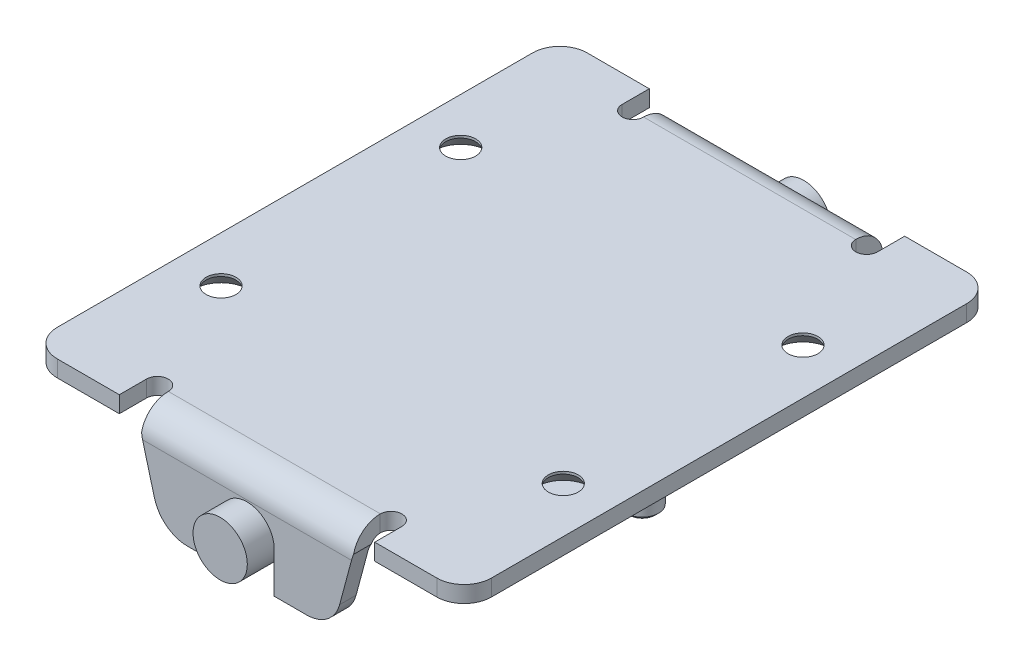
ISO-10303-21;
HEADER;
FILE_DESCRIPTION(('STEP AP214'),'2;1');
FILE_NAME('part.step','',(''),(''),'','','');
FILE_SCHEMA(('AUTOMOTIVE_DESIGN { 1 0 10303 214 1 1 1 1 }'));
ENDSEC;
DATA;
#1=APPLICATION_CONTEXT('core data for automotive mechanical design processes');
#2=APPLICATION_PROTOCOL_DEFINITION('international standard','automotive_design',2000,#1);
#3=PRODUCT_CONTEXT('',#1,'mechanical');
#4=PRODUCT('Part','Part','',(#3));
#5=PRODUCT_RELATED_PRODUCT_CATEGORY('part','',(#4));
#6=PRODUCT_DEFINITION_FORMATION('','',#4);
#7=PRODUCT_DEFINITION_CONTEXT('part definition',#1,'design');
#8=PRODUCT_DEFINITION('design','',#6,#7);
#9=PRODUCT_DEFINITION_SHAPE('','',#8);
#10=(LENGTH_UNIT() NAMED_UNIT(*) SI_UNIT(.MILLI.,.METRE.));
#11=(NAMED_UNIT(*) PLANE_ANGLE_UNIT() SI_UNIT($,.RADIAN.));
#12=(NAMED_UNIT(*) SI_UNIT($,.STERADIAN.) SOLID_ANGLE_UNIT());
#13=UNCERTAINTY_MEASURE_WITH_UNIT(LENGTH_MEASURE(1.E-05),#10,'distance_accuracy_value','');
#14=(GEOMETRIC_REPRESENTATION_CONTEXT(3) GLOBAL_UNCERTAINTY_ASSIGNED_CONTEXT((#13)) GLOBAL_UNIT_ASSIGNED_CONTEXT((#10,
#11,#12)) REPRESENTATION_CONTEXT('',''));
#15=CARTESIAN_POINT('',(0.,0.,0.));
#16=DIRECTION('',(0.,0.,1.));
#17=DIRECTION('',(1.,0.,0.));
#18=AXIS2_PLACEMENT_3D('',#15,#16,#17);
#19=CARTESIAN_POINT('',(0.,0.,-158.024));
#20=DIRECTION('',(0.,0.,1.));
#21=DIRECTION('',(0.,-1.,0.));
#22=AXIS2_PLACEMENT_3D('',#19,#20,#21);
#23=PLANE('',#22);
#24=DIRECTION('',(-0.707106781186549,-0.707106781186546,0.));
#25=VECTOR('',#24,1.);
#26=CARTESIAN_POINT('',(0.,0.,-158.024));
#27=LINE('',#26,#25);
#28=CARTESIAN_POINT('',(5.62164033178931,5.62164033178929,-158.024));
#29=VERTEX_POINT('',#28);
#30=CARTESIAN_POINT('',(5.61266007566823,5.61266007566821,-158.024));
#31=VERTEX_POINT('',#30);
#32=EDGE_CURVE('E2309',#29,#31,#27,.T.);
#33=ORIENTED_EDGE('',*,*,#32,.F.);
#34=CARTESIAN_POINT('',(0.,0.,-158.024));
#35=DIRECTION('',(0.,0.,-1.));
#36=DIRECTION('',(1.,0.,0.));
#37=AXIS2_PLACEMENT_3D('',#34,#35,#36);
#38=CIRCLE('',#37,7.9502);
#39=CARTESIAN_POINT('',(7.9502,0.,-158.024));
#40=VERTEX_POINT('',#39);
#41=EDGE_CURVE('E2795',#29,#40,#38,.T.);
#42=ORIENTED_EDGE('',*,*,#41,.T.);
#43=DIRECTION('',(0.,-1.,0.));
#44=VECTOR('',#43,1.);
#45=CARTESIAN_POINT('',(7.9502,-12.,-158.024));
#46=LINE('',#45,#44);
#47=CARTESIAN_POINT('',(7.9502,-12.,-158.024));
#48=VERTEX_POINT('',#47);
#49=EDGE_CURVE('E2793',#40,#48,#46,.T.);
#50=ORIENTED_EDGE('',*,*,#49,.T.);
#51=DIRECTION('',(1.,0.,0.));
#52=VECTOR('',#51,1.);
#53=CARTESIAN_POINT('',(25.0917203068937,-12.,-158.024));
#54=LINE('',#53,#52);
#55=CARTESIAN_POINT('',(17.4184504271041,-12.,-158.024));
#56=VERTEX_POINT('',#55);
#57=EDGE_CURVE('E2790',#48,#56,#54,.T.);
#58=ORIENTED_EDGE('',*,*,#57,.T.);
#59=CARTESIAN_POINT('',(17.4184504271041,-1.99999999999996,-158.024));
#60=DIRECTION('',(0.,0.,-1.));
#61=DIRECTION('',(-1.,0.,0.));
#62=AXIS2_PLACEMENT_3D('',#59,#60,#61);
#63=CIRCLE('',#62,10.);
#64=CARTESIAN_POINT('',(27.0777086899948,-4.58819045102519,-158.024));
#65=VERTEX_POINT('',#64);
#66=EDGE_CURVE('E2996',#56,#65,#63,.F.);
#67=ORIENTED_EDGE('',*,*,#66,.T.);
#68=DIRECTION('',(0.258819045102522,0.965925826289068,0.));
#69=VECTOR('',#68,1.);
#70=CARTESIAN_POINT('',(31.,10.05,-158.024));
#71=LINE('',#70,#69);
#72=CARTESIAN_POINT('',(30.5578838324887,8.4,-158.024));
#73=VERTEX_POINT('',#72);
#74=EDGE_CURVE('E2788',#65,#73,#71,.T.);
#75=ORIENTED_EDGE('',*,*,#74,.T.);
#76=DIRECTION('',(-1.,0.,0.));
#77=VECTOR('',#76,1.);
#78=CARTESIAN_POINT('',(-31.,8.4,-158.024));
#79=LINE('',#78,#77);
#80=CARTESIAN_POINT('',(-30.5578838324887,8.4,-158.024));
#81=VERTEX_POINT('',#80);
#82=EDGE_CURVE('E3100',#73,#81,#79,.T.);
#83=ORIENTED_EDGE('',*,*,#82,.T.);
#84=DIRECTION('',(0.258819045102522,-0.965925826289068,0.));
#85=VECTOR('',#84,1.);
#86=CARTESIAN_POINT('',(-31.,10.05,-158.024));
#87=LINE('',#86,#85);
#88=CARTESIAN_POINT('',(-27.0777086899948,-4.58819045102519,-158.024));
#89=VERTEX_POINT('',#88);
#90=EDGE_CURVE('E2803',#81,#89,#87,.T.);
#91=ORIENTED_EDGE('',*,*,#90,.T.);
#92=CARTESIAN_POINT('',(-17.4184504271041,-1.99999999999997,-158.024));
#93=DIRECTION('',(0.,0.,-1.));
#94=DIRECTION('',(-1.,0.,0.));
#95=AXIS2_PLACEMENT_3D('',#92,#93,#94);
#96=CIRCLE('',#95,10.);
#97=CARTESIAN_POINT('',(-17.4184504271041,-12.,-158.024));
#98=VERTEX_POINT('',#97);
#99=EDGE_CURVE('E2998',#89,#98,#96,.F.);
#100=ORIENTED_EDGE('',*,*,#99,.T.);
#101=DIRECTION('',(1.,0.,0.));
#102=VECTOR('',#101,1.);
#103=CARTESIAN_POINT('',(-25.0917203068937,-12.,-158.024));
#104=LINE('',#103,#102);
#105=CARTESIAN_POINT('',(-7.9502,-12.,-158.024));
#106=VERTEX_POINT('',#105);
#107=EDGE_CURVE('E2801',#98,#106,#104,.T.);
#108=ORIENTED_EDGE('',*,*,#107,.T.);
#109=DIRECTION('',(0.,1.,0.));
#110=VECTOR('',#109,1.);
#111=CARTESIAN_POINT('',(-7.9502,-12.,-158.024));
#112=LINE('',#111,#110);
#113=CARTESIAN_POINT('',(-7.9502,0.,-158.024));
#114=VERTEX_POINT('',#113);
#115=EDGE_CURVE('E2799',#106,#114,#112,.T.);
#116=ORIENTED_EDGE('',*,*,#115,.T.);
#117=CARTESIAN_POINT('',(-5.62164033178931,5.62164033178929,-158.024));
#118=VERTEX_POINT('',#117);
#119=EDGE_CURVE('E2796',#114,#118,#38,.T.);
#120=ORIENTED_EDGE('',*,*,#119,.T.);
#121=DIRECTION('',(0.707106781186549,-0.707106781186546,0.));
#122=VECTOR('',#121,1.);
#123=CARTESIAN_POINT('',(0.,0.,-158.024));
#124=LINE('',#123,#122);
#125=CARTESIAN_POINT('',(-5.61266007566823,5.61266007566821,-158.024));
#126=VERTEX_POINT('',#125);
#127=EDGE_CURVE('E2303',#118,#126,#124,.T.);
#128=ORIENTED_EDGE('',*,*,#127,.T.);
#129=CARTESIAN_POINT('',(0.,0.,-158.024));
#130=DIRECTION('',(0.,0.,1.));
#131=DIRECTION('',(0.,-1.,0.));
#132=AXIS2_PLACEMENT_3D('',#129,#130,#131);
#133=CIRCLE('',#132,7.9375);
#134=EDGE_CURVE('E3169',#126,#31,#133,.F.);
#135=ORIENTED_EDGE('',*,*,#134,.T.);
#136=EDGE_LOOP('',(#33,#42,#50,#58,#67,#75,#83,#91,#100,#108,#116,#120,#128,#135));
#137=FACE_BOUND('',#136,.T.);
#138=ADVANCED_FACE('F14',(#137),#23,.T.);
#139=CARTESIAN_POINT('',(0.,0.,-162.85));
#140=DIRECTION('',(0.,0.,-1.));
#141=DIRECTION('',(0.,1.,0.));
#142=AXIS2_PLACEMENT_3D('',#139,#140,#141);
#143=PLANE('',#142);
#144=CARTESIAN_POINT('',(0.,0.,-162.85));
#145=DIRECTION('',(0.,0.,-1.));
#146=DIRECTION('',(1.,0.,0.));
#147=AXIS2_PLACEMENT_3D('',#144,#145,#146);
#148=CIRCLE('',#147,7.9502);
#149=CARTESIAN_POINT('',(5.62164033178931,5.62164033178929,-162.85));
#150=VERTEX_POINT('',#149);
#151=CARTESIAN_POINT('',(7.9502,0.,-162.85));
#152=VERTEX_POINT('',#151);
#153=EDGE_CURVE('E2777',#150,#152,#148,.T.);
#154=ORIENTED_EDGE('',*,*,#153,.F.);
#155=DIRECTION('',(0.707106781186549,0.707106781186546,0.));
#156=VECTOR('',#155,1.);
#157=CARTESIAN_POINT('',(0.,0.,-162.85));
#158=LINE('',#157,#156);
#159=CARTESIAN_POINT('',(5.61266007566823,5.61266007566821,-162.85));
#160=VERTEX_POINT('',#159);
#161=EDGE_CURVE('E2306',#160,#150,#158,.T.);
#162=ORIENTED_EDGE('',*,*,#161,.F.);
#163=CARTESIAN_POINT('',(0.,0.,-162.85));
#164=DIRECTION('',(0.,0.,-1.));
#165=DIRECTION('',(0.,1.,0.));
#166=AXIS2_PLACEMENT_3D('',#163,#164,#165);
#167=CIRCLE('',#166,7.9375);
#168=CARTESIAN_POINT('',(-5.61266007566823,5.61266007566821,-162.85));
#169=VERTEX_POINT('',#168);
#170=EDGE_CURVE('E3174',#160,#169,#167,.F.);
#171=ORIENTED_EDGE('',*,*,#170,.T.);
#172=DIRECTION('',(-0.707106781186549,0.707106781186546,0.));
#173=VECTOR('',#172,1.);
#174=CARTESIAN_POINT('',(0.,0.,-162.85));
#175=LINE('',#174,#173);
#176=CARTESIAN_POINT('',(-5.62164033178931,5.62164033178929,-162.85));
#177=VERTEX_POINT('',#176);
#178=EDGE_CURVE('E2300',#169,#177,#175,.T.);
#179=ORIENTED_EDGE('',*,*,#178,.T.);
#180=CARTESIAN_POINT('',(-7.9502,0.,-162.85));
#181=VERTEX_POINT('',#180);
#182=EDGE_CURVE('E2778',#181,#177,#148,.T.);
#183=ORIENTED_EDGE('',*,*,#182,.F.);
#184=DIRECTION('',(0.,1.,0.));
#185=VECTOR('',#184,1.);
#186=CARTESIAN_POINT('',(-7.9502,-12.,-162.85));
#187=LINE('',#186,#185);
#188=CARTESIAN_POINT('',(-7.9502,-12.,-162.85));
#189=VERTEX_POINT('',#188);
#190=EDGE_CURVE('E2781',#189,#181,#187,.T.);
#191=ORIENTED_EDGE('',*,*,#190,.F.);
#192=DIRECTION('',(1.,0.,0.));
#193=VECTOR('',#192,1.);
#194=CARTESIAN_POINT('',(-25.0917203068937,-12.,-162.85));
#195=LINE('',#194,#193);
#196=CARTESIAN_POINT('',(-17.4184504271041,-12.,-162.85));
#197=VERTEX_POINT('',#196);
#198=EDGE_CURVE('E2783',#197,#189,#195,.T.);
#199=ORIENTED_EDGE('',*,*,#198,.F.);
#200=CARTESIAN_POINT('',(-17.4184504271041,-1.99999999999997,-162.85));
#201=DIRECTION('',(0.,0.,1.));
#202=DIRECTION('',(1.,0.,0.));
#203=AXIS2_PLACEMENT_3D('',#200,#201,#202);
#204=CIRCLE('',#203,10.);
#205=CARTESIAN_POINT('',(-27.0777086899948,-4.58819045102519,-162.85));
#206=VERTEX_POINT('',#205);
#207=EDGE_CURVE('E2992',#197,#206,#204,.F.);
#208=ORIENTED_EDGE('',*,*,#207,.T.);
#209=DIRECTION('',(0.258819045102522,-0.965925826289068,0.));
#210=VECTOR('',#209,1.);
#211=CARTESIAN_POINT('',(-31.,10.05,-162.85));
#212=LINE('',#211,#210);
#213=CARTESIAN_POINT('',(-30.5578838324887,8.4,-162.85));
#214=VERTEX_POINT('',#213);
#215=EDGE_CURVE('E2785',#214,#206,#212,.T.);
#216=ORIENTED_EDGE('',*,*,#215,.F.);
#217=DIRECTION('',(1.,0.,0.));
#218=VECTOR('',#217,1.);
#219=CARTESIAN_POINT('',(-63.5,8.4,-162.85));
#220=LINE('',#219,#218);
#221=CARTESIAN_POINT('',(30.5578838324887,8.4,-162.85));
#222=VERTEX_POINT('',#221);
#223=EDGE_CURVE('E2904',#214,#222,#220,.T.);
#224=ORIENTED_EDGE('',*,*,#223,.T.);
#225=DIRECTION('',(0.258819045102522,0.965925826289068,0.));
#226=VECTOR('',#225,1.);
#227=CARTESIAN_POINT('',(31.,10.05,-162.85));
#228=LINE('',#227,#226);
#229=CARTESIAN_POINT('',(27.0777086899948,-4.58819045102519,-162.85));
#230=VERTEX_POINT('',#229);
#231=EDGE_CURVE('E2770',#230,#222,#228,.T.);
#232=ORIENTED_EDGE('',*,*,#231,.F.);
#233=CARTESIAN_POINT('',(17.4184504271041,-1.99999999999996,-162.85));
#234=DIRECTION('',(0.,0.,1.));
#235=DIRECTION('',(1.,0.,0.));
#236=AXIS2_PLACEMENT_3D('',#233,#234,#235);
#237=CIRCLE('',#236,10.);
#238=CARTESIAN_POINT('',(17.4184504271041,-12.,-162.85));
#239=VERTEX_POINT('',#238);
#240=EDGE_CURVE('E2990',#230,#239,#237,.F.);
#241=ORIENTED_EDGE('',*,*,#240,.T.);
#242=DIRECTION('',(1.,0.,0.));
#243=VECTOR('',#242,1.);
#244=CARTESIAN_POINT('',(25.0917203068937,-12.,-162.85));
#245=LINE('',#244,#243);
#246=CARTESIAN_POINT('',(7.9502,-12.,-162.85));
#247=VERTEX_POINT('',#246);
#248=EDGE_CURVE('E2772',#247,#239,#245,.T.);
#249=ORIENTED_EDGE('',*,*,#248,.F.);
#250=DIRECTION('',(0.,-1.,0.));
#251=VECTOR('',#250,1.);
#252=CARTESIAN_POINT('',(7.9502,-12.,-162.85));
#253=LINE('',#252,#251);
#254=EDGE_CURVE('E2775',#152,#247,#253,.T.);
#255=ORIENTED_EDGE('',*,*,#254,.F.);
#256=EDGE_LOOP('',(#154,#162,#171,#179,#183,#191,#199,#208,#216,#224,#232,#241,#249,#255));
#257=FACE_BOUND('',#256,.T.);
#258=ADVANCED_FACE('F1879',(#257),#143,.T.);
#259=CARTESIAN_POINT('',(-5.93934340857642,5.9393434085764,-12.676));
#260=DIRECTION('',(0.,0.,-1.));
#261=DIRECTION('',(0.,1.,0.));
#262=AXIS2_PLACEMENT_3D('',#259,#260,#261);
#263=PLANE('',#262);
#264=CARTESIAN_POINT('',(0.,0.,-12.676));
#265=DIRECTION('',(0.,0.,-1.));
#266=DIRECTION('',(1.,0.,0.));
#267=AXIS2_PLACEMENT_3D('',#264,#265,#266);
#268=CIRCLE('',#267,7.9502);
#269=CARTESIAN_POINT('',(5.62164033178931,5.62164033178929,-12.676));
#270=VERTEX_POINT('',#269);
#271=CARTESIAN_POINT('',(7.9502,0.,-12.676));
#272=VERTEX_POINT('',#271);
#273=EDGE_CURVE('E2852',#270,#272,#268,.T.);
#274=ORIENTED_EDGE('',*,*,#273,.F.);
#275=DIRECTION('',(0.707106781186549,0.707106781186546,0.));
#276=VECTOR('',#275,1.);
#277=CARTESIAN_POINT('',(5.93934340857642,5.9393434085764,-12.676));
#278=LINE('',#277,#276);
#279=CARTESIAN_POINT('',(5.61266007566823,5.61266007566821,-12.676));
#280=VERTEX_POINT('',#279);
#281=EDGE_CURVE('E2297',#280,#270,#278,.T.);
#282=ORIENTED_EDGE('',*,*,#281,.F.);
#283=CARTESIAN_POINT('',(0.,0.,-12.676));
#284=DIRECTION('',(0.,0.,-1.));
#285=DIRECTION('',(0.,1.,0.));
#286=AXIS2_PLACEMENT_3D('',#283,#284,#285);
#287=CIRCLE('',#286,7.9375);
#288=CARTESIAN_POINT('',(-5.61266007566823,5.61266007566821,-12.676));
#289=VERTEX_POINT('',#288);
#290=EDGE_CURVE('E3203',#280,#289,#287,.F.);
#291=ORIENTED_EDGE('',*,*,#290,.T.);
#292=DIRECTION('',(-0.707106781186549,0.707106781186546,0.));
#293=VECTOR('',#292,1.);
#294=CARTESIAN_POINT('',(-5.93934340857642,5.9393434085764,-12.676));
#295=LINE('',#294,#293);
#296=CARTESIAN_POINT('',(-5.62164033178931,5.62164033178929,-12.676));
#297=VERTEX_POINT('',#296);
#298=EDGE_CURVE('E2291',#289,#297,#295,.T.);
#299=ORIENTED_EDGE('',*,*,#298,.T.);
#300=CARTESIAN_POINT('',(-7.9502,0.,-12.676));
#301=VERTEX_POINT('',#300);
#302=EDGE_CURVE('E2853',#301,#297,#268,.T.);
#303=ORIENTED_EDGE('',*,*,#302,.F.);
#304=DIRECTION('',(0.,1.,0.));
#305=VECTOR('',#304,1.);
#306=CARTESIAN_POINT('',(-7.9502,-12.,-12.676));
#307=LINE('',#306,#305);
#308=CARTESIAN_POINT('',(-7.9502,-12.,-12.676));
#309=VERTEX_POINT('',#308);
#310=EDGE_CURVE('E2849',#309,#301,#307,.T.);
#311=ORIENTED_EDGE('',*,*,#310,.F.);
#312=DIRECTION('',(1.,0.,0.));
#313=VECTOR('',#312,1.);
#314=CARTESIAN_POINT('',(-25.0917203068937,-12.,-12.676));
#315=LINE('',#314,#313);
#316=CARTESIAN_POINT('',(-17.4184504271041,-12.,-12.676));
#317=VERTEX_POINT('',#316);
#318=EDGE_CURVE('E2847',#317,#309,#315,.T.);
#319=ORIENTED_EDGE('',*,*,#318,.F.);
#320=CARTESIAN_POINT('',(-17.4184504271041,-1.99999999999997,-12.676));
#321=DIRECTION('',(0.,0.,1.));
#322=DIRECTION('',(1.,0.,0.));
#323=AXIS2_PLACEMENT_3D('',#320,#321,#322);
#324=CIRCLE('',#323,10.);
#325=CARTESIAN_POINT('',(-27.0777086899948,-4.58819045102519,-12.676));
#326=VERTEX_POINT('',#325);
#327=EDGE_CURVE('E3014',#317,#326,#324,.F.);
#328=ORIENTED_EDGE('',*,*,#327,.T.);
#329=DIRECTION('',(0.258819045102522,-0.965925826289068,0.));
#330=VECTOR('',#329,1.);
#331=CARTESIAN_POINT('',(-31.,10.05,-12.676));
#332=LINE('',#331,#330);
#333=CARTESIAN_POINT('',(-30.5578838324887,8.4,-12.676));
#334=VERTEX_POINT('',#333);
#335=EDGE_CURVE('E2844',#334,#326,#332,.T.);
#336=ORIENTED_EDGE('',*,*,#335,.F.);
#337=DIRECTION('',(1.,0.,0.));
#338=VECTOR('',#337,1.);
#339=CARTESIAN_POINT('',(31.,8.4,-12.676));
#340=LINE('',#339,#338);
#341=CARTESIAN_POINT('',(30.5578838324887,8.4,-12.676));
#342=VERTEX_POINT('',#341);
#343=EDGE_CURVE('E3107',#334,#342,#340,.T.);
#344=ORIENTED_EDGE('',*,*,#343,.T.);
#345=DIRECTION('',(0.258819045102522,0.965925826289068,0.));
#346=VECTOR('',#345,1.);
#347=CARTESIAN_POINT('',(31.,10.05,-12.676));
#348=LINE('',#347,#346);
#349=CARTESIAN_POINT('',(27.0777086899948,-4.58819045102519,-12.676));
#350=VERTEX_POINT('',#349);
#351=EDGE_CURVE('E2862',#350,#342,#348,.T.);
#352=ORIENTED_EDGE('',*,*,#351,.F.);
#353=CARTESIAN_POINT('',(17.4184504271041,-1.99999999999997,-12.676));
#354=DIRECTION('',(0.,0.,1.));
#355=DIRECTION('',(1.,0.,0.));
#356=AXIS2_PLACEMENT_3D('',#353,#354,#355);
#357=CIRCLE('',#356,10.);
#358=CARTESIAN_POINT('',(17.4184504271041,-12.,-12.676));
#359=VERTEX_POINT('',#358);
#360=EDGE_CURVE('E2322',#350,#359,#357,.F.);
#361=ORIENTED_EDGE('',*,*,#360,.T.);
#362=DIRECTION('',(1.,0.,0.));
#363=VECTOR('',#362,1.);
#364=CARTESIAN_POINT('',(25.0917203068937,-12.,-12.676));
#365=LINE('',#364,#363);
#366=CARTESIAN_POINT('',(7.9502,-12.,-12.676));
#367=VERTEX_POINT('',#366);
#368=EDGE_CURVE('E2859',#367,#359,#365,.T.);
#369=ORIENTED_EDGE('',*,*,#368,.F.);
#370=DIRECTION('',(0.,-1.,0.));
#371=VECTOR('',#370,1.);
#372=CARTESIAN_POINT('',(7.9502,-12.,-12.676));
#373=LINE('',#372,#371);
#374=EDGE_CURVE('E2856',#272,#367,#373,.T.);
#375=ORIENTED_EDGE('',*,*,#374,.F.);
#376=EDGE_LOOP('',(#274,#282,#291,#299,#303,#311,#319,#328,#336,#344,#352,#361,#369,#375));
#377=FACE_BOUND('',#376,.T.);
#378=ADVANCED_FACE('F661',(#377),#263,.T.);
#379=CARTESIAN_POINT('',(-5.93934340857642,5.9393434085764,-7.85));
#380=DIRECTION('',(0.,0.,1.));
#381=DIRECTION('',(0.,-1.,0.));
#382=AXIS2_PLACEMENT_3D('',#379,#380,#381);
#383=PLANE('',#382);
#384=DIRECTION('',(-0.707106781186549,-0.707106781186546,0.));
#385=VECTOR('',#384,1.);
#386=CARTESIAN_POINT('',(5.93934340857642,5.9393434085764,-7.85));
#387=LINE('',#386,#385);
#388=CARTESIAN_POINT('',(5.62164033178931,5.62164033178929,-7.85));
#389=VERTEX_POINT('',#388);
#390=CARTESIAN_POINT('',(5.61266007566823,5.61266007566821,-7.85));
#391=VERTEX_POINT('',#390);
#392=EDGE_CURVE('E2294',#389,#391,#387,.T.);
#393=ORIENTED_EDGE('',*,*,#392,.F.);
#394=CARTESIAN_POINT('',(0.,0.,-7.84999999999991));
#395=DIRECTION('',(0.,0.,-1.));
#396=DIRECTION('',(1.,0.,0.));
#397=AXIS2_PLACEMENT_3D('',#394,#395,#396);
#398=CIRCLE('',#397,7.9502);
#399=CARTESIAN_POINT('',(7.9502,0.,-7.84999999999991));
#400=VERTEX_POINT('',#399);
#401=EDGE_CURVE('E2832',#389,#400,#398,.T.);
#402=ORIENTED_EDGE('',*,*,#401,.T.);
#403=DIRECTION('',(0.,-1.,0.));
#404=VECTOR('',#403,1.);
#405=CARTESIAN_POINT('',(7.9502,-12.,-7.84999999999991));
#406=LINE('',#405,#404);
#407=CARTESIAN_POINT('',(7.9502,-12.,-7.84999999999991));
#408=VERTEX_POINT('',#407);
#409=EDGE_CURVE('E2836',#400,#408,#406,.T.);
#410=ORIENTED_EDGE('',*,*,#409,.T.);
#411=DIRECTION('',(1.,0.,0.));
#412=VECTOR('',#411,1.);
#413=CARTESIAN_POINT('',(25.0917203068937,-12.,-7.84999999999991));
#414=LINE('',#413,#412);
#415=CARTESIAN_POINT('',(17.4184504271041,-12.,-7.84999999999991));
#416=VERTEX_POINT('',#415);
#417=EDGE_CURVE('E2839',#408,#416,#414,.T.);
#418=ORIENTED_EDGE('',*,*,#417,.T.);
#419=CARTESIAN_POINT('',(17.4184504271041,-1.99999999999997,-7.84999999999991));
#420=DIRECTION('',(0.,0.,-1.));
#421=DIRECTION('',(-1.,0.,0.));
#422=AXIS2_PLACEMENT_3D('',#419,#420,#421);
#423=CIRCLE('',#422,10.);
#424=CARTESIAN_POINT('',(27.0777086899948,-4.58819045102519,-7.84999999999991));
#425=VERTEX_POINT('',#424);
#426=EDGE_CURVE('E3010',#416,#425,#423,.F.);
#427=ORIENTED_EDGE('',*,*,#426,.T.);
#428=DIRECTION('',(0.258819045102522,0.965925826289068,0.));
#429=VECTOR('',#428,1.);
#430=CARTESIAN_POINT('',(31.,10.05,-7.84999999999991));
#431=LINE('',#430,#429);
#432=CARTESIAN_POINT('',(30.5578838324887,8.4,-7.84999999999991));
#433=VERTEX_POINT('',#432);
#434=EDGE_CURVE('E2842',#425,#433,#431,.T.);
#435=ORIENTED_EDGE('',*,*,#434,.T.);
#436=DIRECTION('',(1.,0.,0.));
#437=VECTOR('',#436,1.);
#438=CARTESIAN_POINT('',(-63.5,8.4,-7.84999999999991));
#439=LINE('',#438,#437);
#440=CARTESIAN_POINT('',(-30.5578838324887,8.4,-7.84999999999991));
#441=VERTEX_POINT('',#440);
#442=EDGE_CURVE('E3032',#433,#441,#439,.F.);
#443=ORIENTED_EDGE('',*,*,#442,.T.);
#444=DIRECTION('',(0.258819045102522,-0.965925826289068,0.));
#445=VECTOR('',#444,1.);
#446=CARTESIAN_POINT('',(-31.,10.05,-7.84999999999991));
#447=LINE('',#446,#445);
#448=CARTESIAN_POINT('',(-27.0777086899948,-4.58819045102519,-7.84999999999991));
#449=VERTEX_POINT('',#448);
#450=EDGE_CURVE('E2810',#441,#449,#447,.T.);
#451=ORIENTED_EDGE('',*,*,#450,.T.);
#452=CARTESIAN_POINT('',(-17.4184504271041,-1.99999999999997,-7.84999999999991));
#453=DIRECTION('',(0.,0.,-1.));
#454=DIRECTION('',(-1.,0.,0.));
#455=AXIS2_PLACEMENT_3D('',#452,#453,#454);
#456=CIRCLE('',#455,10.);
#457=CARTESIAN_POINT('',(-17.4184504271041,-12.,-7.84999999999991));
#458=VERTEX_POINT('',#457);
#459=EDGE_CURVE('E3008',#449,#458,#456,.F.);
#460=ORIENTED_EDGE('',*,*,#459,.T.);
#461=DIRECTION('',(1.,0.,0.));
#462=VECTOR('',#461,1.);
#463=CARTESIAN_POINT('',(-25.0917203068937,-12.,-7.84999999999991));
#464=LINE('',#463,#462);
#465=CARTESIAN_POINT('',(-7.9502,-12.,-7.84999999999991));
#466=VERTEX_POINT('',#465);
#467=EDGE_CURVE('E2827',#458,#466,#464,.T.);
#468=ORIENTED_EDGE('',*,*,#467,.T.);
#469=DIRECTION('',(0.,1.,0.));
#470=VECTOR('',#469,1.);
#471=CARTESIAN_POINT('',(-7.9502,-12.,-7.84999999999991));
#472=LINE('',#471,#470);
#473=CARTESIAN_POINT('',(-7.9502,0.,-7.84999999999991));
#474=VERTEX_POINT('',#473);
#475=EDGE_CURVE('E2829',#466,#474,#472,.T.);
#476=ORIENTED_EDGE('',*,*,#475,.T.);
#477=CARTESIAN_POINT('',(-5.62164033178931,5.62164033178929,-7.85));
#478=VERTEX_POINT('',#477);
#479=EDGE_CURVE('E2833',#474,#478,#398,.T.);
#480=ORIENTED_EDGE('',*,*,#479,.T.);
#481=DIRECTION('',(0.707106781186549,-0.707106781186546,0.));
#482=VECTOR('',#481,1.);
#483=CARTESIAN_POINT('',(-5.93934340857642,5.9393434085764,-7.85));
#484=LINE('',#483,#482);
#485=CARTESIAN_POINT('',(-5.61266007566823,5.61266007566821,-7.85));
#486=VERTEX_POINT('',#485);
#487=EDGE_CURVE('E2288',#478,#486,#484,.T.);
#488=ORIENTED_EDGE('',*,*,#487,.T.);
#489=CARTESIAN_POINT('',(0.,0.,-7.85));
#490=DIRECTION('',(0.,0.,1.));
#491=DIRECTION('',(0.,-1.,0.));
#492=AXIS2_PLACEMENT_3D('',#489,#490,#491);
#493=CIRCLE('',#492,7.9375);
#494=EDGE_CURVE('E3195',#486,#391,#493,.F.);
#495=ORIENTED_EDGE('',*,*,#494,.T.);
#496=EDGE_LOOP('',(#393,#402,#410,#418,#427,#435,#443,#451,#460,#468,#476,#480,#488,#495));
#497=FACE_BOUND('',#496,.T.);
#498=ADVANCED_FACE('F651',(#497),#383,.T.);
#499=CARTESIAN_POINT('',(50.05,11.574,-50.3));
#500=DIRECTION('',(0.,-1.,0.));
#501=DIRECTION('',(1.,0.,0.));
#502=AXIS2_PLACEMENT_3D('',#499,#500,#501);
#503=CYLINDRICAL_SURFACE('',#502,4.3688);
#504=CARTESIAN_POINT('',(50.05,16.4,-50.3));
#505=DIRECTION('',(0.,-1.,0.));
#506=DIRECTION('',(1.,0.,0.));
#507=AXIS2_PLACEMENT_3D('',#504,#505,#506);
#508=CIRCLE('',#507,4.3688);
#509=CARTESIAN_POINT('',(54.4188,16.4,-50.3));
#510=VERTEX_POINT('',#509);
#511=EDGE_CURVE('E2761',#510,#510,#508,.T.);
#512=ORIENTED_EDGE('',*,*,#511,.F.);
#513=EDGE_LOOP('',(#512));
#514=FACE_BOUND('',#513,.T.);
#515=CARTESIAN_POINT('',(50.05,15.6793197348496,-50.3));
#516=DIRECTION('',(0.,-1.,0.));
#517=DIRECTION('',(1.,0.,0.));
#518=AXIS2_PLACEMENT_3D('',#515,#516,#517);
#519=CIRCLE('',#518,4.3688);
#520=CARTESIAN_POINT('',(54.4188,15.6793197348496,-50.3));
#521=VERTEX_POINT('',#520);
#522=EDGE_CURVE('E2764',#521,#521,#519,.T.);
#523=ORIENTED_EDGE('',*,*,#522,.T.);
#524=EDGE_LOOP('',(#523));
#525=FACE_BOUND('',#524,.T.);
#526=ADVANCED_FACE('F648',(#514,#525),#503,.F.);
#527=CARTESIAN_POINT('',(-50.05,11.574,-50.3));
#528=DIRECTION('',(0.,-1.,0.));
#529=DIRECTION('',(1.,0.,0.));
#530=AXIS2_PLACEMENT_3D('',#527,#528,#529);
#531=CYLINDRICAL_SURFACE('',#530,4.3688);
#532=CARTESIAN_POINT('',(-50.05,16.4,-50.3));
#533=DIRECTION('',(0.,-1.,0.));
#534=DIRECTION('',(1.,0.,0.));
#535=AXIS2_PLACEMENT_3D('',#532,#533,#534);
#536=CIRCLE('',#535,4.3688);
#537=CARTESIAN_POINT('',(-45.6812,16.4,-50.3));
#538=VERTEX_POINT('',#537);
#539=EDGE_CURVE('E2752',#538,#538,#536,.T.);
#540=ORIENTED_EDGE('',*,*,#539,.F.);
#541=EDGE_LOOP('',(#540));
#542=FACE_BOUND('',#541,.T.);
#543=CARTESIAN_POINT('',(-50.05,15.6793197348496,-50.3));
#544=DIRECTION('',(0.,-1.,0.));
#545=DIRECTION('',(1.,0.,0.));
#546=AXIS2_PLACEMENT_3D('',#543,#544,#545);
#547=CIRCLE('',#546,4.3688);
#548=CARTESIAN_POINT('',(-45.6812,15.6793197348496,-50.3));
#549=VERTEX_POINT('',#548);
#550=EDGE_CURVE('E2755',#549,#549,#547,.T.);
#551=ORIENTED_EDGE('',*,*,#550,.T.);
#552=EDGE_LOOP('',(#551));
#553=FACE_BOUND('',#552,.T.);
#554=ADVANCED_FACE('F650',(#542,#553),#531,.F.);
#555=CARTESIAN_POINT('',(50.05,11.574,-120.4));
#556=DIRECTION('',(0.,-1.,0.));
#557=DIRECTION('',(1.,0.,0.));
#558=AXIS2_PLACEMENT_3D('',#555,#556,#557);
#559=CYLINDRICAL_SURFACE('',#558,4.3688);
#560=CARTESIAN_POINT('',(50.05,16.4,-120.4));
#561=DIRECTION('',(0.,-1.,0.));
#562=DIRECTION('',(1.,0.,0.));
#563=AXIS2_PLACEMENT_3D('',#560,#561,#562);
#564=CIRCLE('',#563,4.3688);
#565=CARTESIAN_POINT('',(54.4188,16.4,-120.4));
#566=VERTEX_POINT('',#565);
#567=EDGE_CURVE('E2743',#566,#566,#564,.T.);
#568=ORIENTED_EDGE('',*,*,#567,.F.);
#569=EDGE_LOOP('',(#568));
#570=FACE_BOUND('',#569,.T.);
#571=CARTESIAN_POINT('',(50.05,15.6793197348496,-120.4));
#572=DIRECTION('',(0.,-1.,0.));
#573=DIRECTION('',(1.,0.,0.));
#574=AXIS2_PLACEMENT_3D('',#571,#572,#573);
#575=CIRCLE('',#574,4.3688);
#576=CARTESIAN_POINT('',(54.4188,15.6793197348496,-120.4));
#577=VERTEX_POINT('',#576);
#578=EDGE_CURVE('E2746',#577,#577,#575,.T.);
#579=ORIENTED_EDGE('',*,*,#578,.T.);
#580=EDGE_LOOP('',(#579));
#581=FACE_BOUND('',#580,.T.);
#582=ADVANCED_FACE('F658',(#570,#581),#559,.F.);
#583=CARTESIAN_POINT('',(-50.05,11.574,-120.4));
#584=DIRECTION('',(0.,-1.,0.));
#585=DIRECTION('',(1.,0.,0.));
#586=AXIS2_PLACEMENT_3D('',#583,#584,#585);
#587=CYLINDRICAL_SURFACE('',#586,4.3688);
#588=CARTESIAN_POINT('',(-50.05,16.4,-120.4));
#589=DIRECTION('',(0.,-1.,0.));
#590=DIRECTION('',(1.,0.,0.));
#591=AXIS2_PLACEMENT_3D('',#588,#589,#590);
#592=CIRCLE('',#591,4.3688);
#593=CARTESIAN_POINT('',(-45.6812,16.4,-120.4));
#594=VERTEX_POINT('',#593);
#595=EDGE_CURVE('E2734',#594,#594,#592,.T.);
#596=ORIENTED_EDGE('',*,*,#595,.F.);
#597=EDGE_LOOP('',(#596));
#598=FACE_BOUND('',#597,.T.);
#599=CARTESIAN_POINT('',(-50.05,15.6793197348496,-120.4));
#600=DIRECTION('',(0.,-1.,0.));
#601=DIRECTION('',(1.,0.,0.));
#602=AXIS2_PLACEMENT_3D('',#599,#600,#601);
#603=CIRCLE('',#602,4.3688);
#604=CARTESIAN_POINT('',(-45.6812,15.6793197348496,-120.4));
#605=VERTEX_POINT('',#604);
#606=EDGE_CURVE('E2737',#605,#605,#603,.T.);
#607=ORIENTED_EDGE('',*,*,#606,.T.);
#608=EDGE_LOOP('',(#607));
#609=FACE_BOUND('',#608,.T.);
#610=ADVANCED_FACE('F1850',(#598,#609),#587,.F.);
#611=CARTESIAN_POINT('',(-37.35,-12.,-162.85));
#612=DIRECTION('',(-1.,0.,0.));
#613=DIRECTION('',(0.,0.,1.));
#614=AXIS2_PLACEMENT_3D('',#611,#612,#613);
#615=PLANE('',#614);
#616=DIRECTION('',(0.,1.,0.));
#617=VECTOR('',#616,1.);
#618=CARTESIAN_POINT('',(-37.35,-12.,-162.85));
#619=LINE('',#618,#617);
#620=CARTESIAN_POINT('',(-37.35,11.574,-162.85));
#621=VERTEX_POINT('',#620);
#622=CARTESIAN_POINT('',(-37.35,16.4,-162.85));
#623=VERTEX_POINT('',#622);
#624=EDGE_CURVE('E2720',#621,#623,#619,.T.);
#625=ORIENTED_EDGE('',*,*,#624,.T.);
#626=DIRECTION('',(0.,0.,1.));
#627=VECTOR('',#626,1.);
#628=CARTESIAN_POINT('',(-37.35,16.4,-162.85));
#629=LINE('',#628,#627);
#630=CARTESIAN_POINT('',(-37.35,16.4,-154.8998));
#631=VERTEX_POINT('',#630);
#632=EDGE_CURVE('E2714',#623,#631,#629,.T.);
#633=ORIENTED_EDGE('',*,*,#632,.T.);
#634=DIRECTION('',(0.,1.,0.));
#635=VECTOR('',#634,1.);
#636=CARTESIAN_POINT('',(-37.35,-12.,-154.8998));
#637=LINE('',#636,#635);
#638=CARTESIAN_POINT('',(-37.35,11.574,-154.8998));
#639=VERTEX_POINT('',#638);
#640=EDGE_CURVE('E2725',#639,#631,#637,.T.);
#641=ORIENTED_EDGE('',*,*,#640,.F.);
#642=DIRECTION('',(0.,0.,1.));
#643=VECTOR('',#642,1.);
#644=CARTESIAN_POINT('',(-37.35,11.574,-162.85));
#645=LINE('',#644,#643);
#646=EDGE_CURVE('E2724',#621,#639,#645,.T.);
#647=ORIENTED_EDGE('',*,*,#646,.F.);
#648=EDGE_LOOP('',(#625,#633,#641,#647));
#649=FACE_BOUND('',#648,.T.);
#650=ADVANCED_FACE('F791',(#649),#615,.F.);
#651=CARTESIAN_POINT('',(-63.5,11.574,-162.85));
#652=DIRECTION('',(0.,0.,1.));
#653=DIRECTION('',(1.,0.,0.));
#654=AXIS2_PLACEMENT_3D('',#651,#652,#653);
#655=PLANE('',#654);
#656=DIRECTION('',(1.,0.,0.));
#657=VECTOR('',#656,1.);
#658=CARTESIAN_POINT('',(-63.5,11.574,-162.85));
#659=LINE('',#658,#657);
#660=CARTESIAN_POINT('',(-55.5,11.574,-162.85));
#661=VERTEX_POINT('',#660);
#662=EDGE_CURVE('E2902',#661,#621,#659,.T.);
#663=ORIENTED_EDGE('',*,*,#662,.F.);
#664=DIRECTION('',(0.,-1.,0.));
#665=VECTOR('',#664,1.);
#666=CARTESIAN_POINT('',(-55.5,11.574,-162.85));
#667=LINE('',#666,#665);
#668=CARTESIAN_POINT('',(-55.5,16.4,-162.85));
#669=VERTEX_POINT('',#668);
#670=EDGE_CURVE('E3098',#661,#669,#667,.F.);
#671=ORIENTED_EDGE('',*,*,#670,.T.);
#672=DIRECTION('',(1.,0.,0.));
#673=VECTOR('',#672,1.);
#674=CARTESIAN_POINT('',(-63.5,16.4,-162.85));
#675=LINE('',#674,#673);
#676=EDGE_CURVE('E2893',#669,#623,#675,.T.);
#677=ORIENTED_EDGE('',*,*,#676,.T.);
#678=ORIENTED_EDGE('',*,*,#624,.F.);
#679=EDGE_LOOP('',(#663,#671,#677,#678));
#680=FACE_BOUND('',#679,.T.);
#681=ADVANCED_FACE('F788',(#680),#655,.F.);
#682=CARTESIAN_POINT('',(-55.5,16.4,-154.85));
#683=DIRECTION('',(0.,-1.,0.));
#684=DIRECTION('',(1.,0.,0.));
#685=AXIS2_PLACEMENT_3D('',#682,#683,#684);
#686=CYLINDRICAL_SURFACE('',#685,8.);
#687=CARTESIAN_POINT('',(-55.5,16.4,-154.85));
#688=DIRECTION('',(0.,-1.,0.));
#689=DIRECTION('',(1.,0.,0.));
#690=AXIS2_PLACEMENT_3D('',#687,#688,#689);
#691=CIRCLE('',#690,8.);
#692=CARTESIAN_POINT('',(-63.5,16.4,-154.85));
#693=VERTEX_POINT('',#692);
#694=EDGE_CURVE('E2917',#669,#693,#691,.F.);
#695=ORIENTED_EDGE('',*,*,#694,.F.);
#696=ORIENTED_EDGE('',*,*,#670,.F.);
#697=CARTESIAN_POINT('',(-55.5,11.574,-154.85));
#698=DIRECTION('',(0.,1.,0.));
#699=DIRECTION('',(-1.,0.,0.));
#700=AXIS2_PLACEMENT_3D('',#697,#698,#699);
#701=CIRCLE('',#700,8.);
#702=CARTESIAN_POINT('',(-63.5,11.574,-154.85));
#703=VERTEX_POINT('',#702);
#704=EDGE_CURVE('E3077',#703,#661,#701,.F.);
#705=ORIENTED_EDGE('',*,*,#704,.F.);
#706=DIRECTION('',(0.,-1.,0.));
#707=VECTOR('',#706,1.);
#708=CARTESIAN_POINT('',(-63.5,16.4,-154.85));
#709=LINE('',#708,#707);
#710=EDGE_CURVE('E2961',#693,#703,#709,.T.);
#711=ORIENTED_EDGE('',*,*,#710,.F.);
#712=EDGE_LOOP('',(#695,#696,#705,#711));
#713=FACE_BOUND('',#712,.T.);
#714=ADVANCED_FACE('F773',(#713),#686,.T.);
#715=CARTESIAN_POINT('',(-63.5,16.4,-162.85));
#716=DIRECTION('',(1.,0.,0.));
#717=DIRECTION('',(0.,0.,-1.));
#718=AXIS2_PLACEMENT_3D('',#715,#716,#717);
#719=PLANE('',#718);
#720=DIRECTION('',(0.,0.,1.));
#721=VECTOR('',#720,1.);
#722=CARTESIAN_POINT('',(-63.5,11.574,-162.85));
#723=LINE('',#722,#721);
#724=CARTESIAN_POINT('',(-63.5,11.574,-15.85));
#725=VERTEX_POINT('',#724);
#726=EDGE_CURVE('E2886',#703,#725,#723,.T.);
#727=ORIENTED_EDGE('',*,*,#726,.T.);
#728=DIRECTION('',(0.,1.,0.));
#729=VECTOR('',#728,1.);
#730=CARTESIAN_POINT('',(-63.5,16.4,-15.85));
#731=LINE('',#730,#729);
#732=CARTESIAN_POINT('',(-63.5,16.4,-15.85));
#733=VERTEX_POINT('',#732);
#734=EDGE_CURVE('E3076',#725,#733,#731,.T.);
#735=ORIENTED_EDGE('',*,*,#734,.T.);
#736=DIRECTION('',(0.,0.,-1.));
#737=VECTOR('',#736,1.);
#738=CARTESIAN_POINT('',(-63.5,16.4,-162.85));
#739=LINE('',#738,#737);
#740=EDGE_CURVE('E2889',#733,#693,#739,.T.);
#741=ORIENTED_EDGE('',*,*,#740,.T.);
#742=ORIENTED_EDGE('',*,*,#710,.T.);
#743=EDGE_LOOP('',(#727,#735,#741,#742));
#744=FACE_BOUND('',#743,.T.);
#745=ADVANCED_FACE('F769',(#744),#719,.F.);
#746=CARTESIAN_POINT('',(-55.5,16.4,-15.85));
#747=DIRECTION('',(0.,1.,0.));
#748=DIRECTION('',(-1.,0.,0.));
#749=AXIS2_PLACEMENT_3D('',#746,#747,#748);
#750=CYLINDRICAL_SURFACE('',#749,8.);
#751=CARTESIAN_POINT('',(-55.5,11.574,-15.85));
#752=DIRECTION('',(0.,1.,0.));
#753=DIRECTION('',(-1.,0.,0.));
#754=AXIS2_PLACEMENT_3D('',#751,#752,#753);
#755=CIRCLE('',#754,8.);
#756=CARTESIAN_POINT('',(-55.5,11.574,-7.84999999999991));
#757=VERTEX_POINT('',#756);
#758=EDGE_CURVE('E3086',#757,#725,#755,.F.);
#759=ORIENTED_EDGE('',*,*,#758,.F.);
#760=DIRECTION('',(0.,1.,0.));
#761=VECTOR('',#760,1.);
#762=CARTESIAN_POINT('',(-55.5,11.574,-7.84999999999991));
#763=LINE('',#762,#761);
#764=CARTESIAN_POINT('',(-55.5,16.4,-7.84999999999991));
#765=VERTEX_POINT('',#764);
#766=EDGE_CURVE('E3078',#765,#757,#763,.F.);
#767=ORIENTED_EDGE('',*,*,#766,.F.);
#768=CARTESIAN_POINT('',(-55.5,16.4,-15.85));
#769=DIRECTION('',(0.,-1.,0.));
#770=DIRECTION('',(1.,0.,0.));
#771=AXIS2_PLACEMENT_3D('',#768,#769,#770);
#772=CIRCLE('',#771,8.);
#773=EDGE_CURVE('E3057',#733,#765,#772,.F.);
#774=ORIENTED_EDGE('',*,*,#773,.F.);
#775=ORIENTED_EDGE('',*,*,#734,.F.);
#776=EDGE_LOOP('',(#759,#767,#774,#775));
#777=FACE_BOUND('',#776,.T.);
#778=ADVANCED_FACE('F772',(#777),#750,.T.);
#779=CARTESIAN_POINT('',(-63.5,11.574,-7.84999999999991));
#780=DIRECTION('',(0.,0.,-1.));
#781=DIRECTION('',(-1.,0.,0.));
#782=AXIS2_PLACEMENT_3D('',#779,#780,#781);
#783=PLANE('',#782);
#784=DIRECTION('',(1.,0.,0.));
#785=VECTOR('',#784,1.);
#786=CARTESIAN_POINT('',(-63.5,16.4,-7.84999999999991));
#787=LINE('',#786,#785);
#788=CARTESIAN_POINT('',(-37.35,16.4,-7.84999999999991));
#789=VERTEX_POINT('',#788);
#790=EDGE_CURVE('E2896',#765,#789,#787,.T.);
#791=ORIENTED_EDGE('',*,*,#790,.F.);
#792=ORIENTED_EDGE('',*,*,#766,.T.);
#793=DIRECTION('',(1.,0.,0.));
#794=VECTOR('',#793,1.);
#795=CARTESIAN_POINT('',(-63.5,11.574,-7.84999999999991));
#796=LINE('',#795,#794);
#797=CARTESIAN_POINT('',(-37.35,11.574,-7.84999999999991));
#798=VERTEX_POINT('',#797);
#799=EDGE_CURVE('E2899',#757,#798,#796,.T.);
#800=ORIENTED_EDGE('',*,*,#799,.T.);
#801=DIRECTION('',(0.,1.,0.));
#802=VECTOR('',#801,1.);
#803=CARTESIAN_POINT('',(-37.35,-12.,-7.84999999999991));
#804=LINE('',#803,#802);
#805=EDGE_CURVE('E2668',#798,#789,#804,.T.);
#806=ORIENTED_EDGE('',*,*,#805,.T.);
#807=EDGE_LOOP('',(#791,#792,#800,#806));
#808=FACE_BOUND('',#807,.T.);
#809=ADVANCED_FACE('F778',(#808),#783,.F.);
#810=CARTESIAN_POINT('',(-37.35,-12.,-7.84999999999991));
#811=DIRECTION('',(-1.,0.,0.));
#812=DIRECTION('',(0.,0.,1.));
#813=AXIS2_PLACEMENT_3D('',#810,#811,#812);
#814=PLANE('',#813);
#815=DIRECTION('',(0.,1.,0.));
#816=VECTOR('',#815,1.);
#817=CARTESIAN_POINT('',(-37.35,-12.,-15.8002));
#818=LINE('',#817,#816);
#819=CARTESIAN_POINT('',(-37.35,11.574,-15.8002));
#820=VERTEX_POINT('',#819);
#821=CARTESIAN_POINT('',(-37.35,16.4,-15.8002));
#822=VERTEX_POINT('',#821);
#823=EDGE_CURVE('E2663',#820,#822,#818,.T.);
#824=ORIENTED_EDGE('',*,*,#823,.T.);
#825=DIRECTION('',(0.,0.,1.));
#826=VECTOR('',#825,1.);
#827=CARTESIAN_POINT('',(-37.35,16.4,-7.84999999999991));
#828=LINE('',#827,#826);
#829=EDGE_CURVE('E2660',#822,#789,#828,.T.);
#830=ORIENTED_EDGE('',*,*,#829,.T.);
#831=ORIENTED_EDGE('',*,*,#805,.F.);
#832=DIRECTION('',(0.,0.,1.));
#833=VECTOR('',#832,1.);
#834=CARTESIAN_POINT('',(-37.35,11.574,-162.85));
#835=LINE('',#834,#833);
#836=EDGE_CURVE('E2667',#820,#798,#835,.T.);
#837=ORIENTED_EDGE('',*,*,#836,.F.);
#838=EDGE_LOOP('',(#824,#830,#831,#837));
#839=FACE_BOUND('',#838,.T.);
#840=ADVANCED_FACE('F781',(#839),#814,.F.);
#841=CARTESIAN_POINT('',(37.35,-12.,-7.84999999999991));
#842=DIRECTION('',(1.,0.,0.));
#843=DIRECTION('',(0.,0.,-1.));
#844=AXIS2_PLACEMENT_3D('',#841,#842,#843);
#845=PLANE('',#844);
#846=DIRECTION('',(0.,1.,0.));
#847=VECTOR('',#846,1.);
#848=CARTESIAN_POINT('',(37.35,-12.,-7.84999999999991));
#849=LINE('',#848,#847);
#850=CARTESIAN_POINT('',(37.35,11.574,-7.84999999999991));
#851=VERTEX_POINT('',#850);
#852=CARTESIAN_POINT('',(37.35,16.4,-7.84999999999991));
#853=VERTEX_POINT('',#852);
#854=EDGE_CURVE('E2687',#851,#853,#849,.T.);
#855=ORIENTED_EDGE('',*,*,#854,.T.);
#856=DIRECTION('',(0.,0.,-1.));
#857=VECTOR('',#856,1.);
#858=CARTESIAN_POINT('',(37.35,16.4,-7.84999999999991));
#859=LINE('',#858,#857);
#860=CARTESIAN_POINT('',(37.35,16.4,-15.8002));
#861=VERTEX_POINT('',#860);
#862=EDGE_CURVE('E2680',#853,#861,#859,.T.);
#863=ORIENTED_EDGE('',*,*,#862,.T.);
#864=DIRECTION('',(0.,1.,0.));
#865=VECTOR('',#864,1.);
#866=CARTESIAN_POINT('',(37.35,-12.,-15.8002));
#867=LINE('',#866,#865);
#868=CARTESIAN_POINT('',(37.35,11.574,-15.8002));
#869=VERTEX_POINT('',#868);
#870=EDGE_CURVE('E2684',#869,#861,#867,.T.);
#871=ORIENTED_EDGE('',*,*,#870,.F.);
#872=DIRECTION('',(0.,0.,-1.));
#873=VECTOR('',#872,1.);
#874=CARTESIAN_POINT('',(37.3499999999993,11.574,-162.85));
#875=LINE('',#874,#873);
#876=EDGE_CURVE('E2686',#851,#869,#875,.T.);
#877=ORIENTED_EDGE('',*,*,#876,.F.);
#878=EDGE_LOOP('',(#855,#863,#871,#877));
#879=FACE_BOUND('',#878,.T.);
#880=ADVANCED_FACE('F1802',(#879),#845,.F.);
#881=CARTESIAN_POINT('',(55.5,11.574,-7.84999999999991));
#882=VERTEX_POINT('',#881);
#883=EDGE_CURVE('E2898',#851,#882,#796,.T.);
#884=ORIENTED_EDGE('',*,*,#883,.T.);
#885=DIRECTION('',(0.,1.,0.));
#886=VECTOR('',#885,1.);
#887=CARTESIAN_POINT('',(55.5,16.4,-7.84999999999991));
#888=LINE('',#887,#886);
#889=CARTESIAN_POINT('',(55.5,16.4,-7.84999999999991));
#890=VERTEX_POINT('',#889);
#891=EDGE_CURVE('E3088',#882,#890,#888,.T.);
#892=ORIENTED_EDGE('',*,*,#891,.T.);
#893=EDGE_CURVE('E2895',#853,#890,#787,.T.);
#894=ORIENTED_EDGE('',*,*,#893,.F.);
#895=ORIENTED_EDGE('',*,*,#854,.F.);
#896=EDGE_LOOP('',(#884,#892,#894,#895));
#897=FACE_BOUND('',#896,.T.);
#898=ADVANCED_FACE('F783',(#897),#783,.F.);
#899=CARTESIAN_POINT('',(55.5,11.574,-15.85));
#900=DIRECTION('',(0.,-1.,0.));
#901=DIRECTION('',(1.,0.,0.));
#902=AXIS2_PLACEMENT_3D('',#899,#900,#901);
#903=CYLINDRICAL_SURFACE('',#902,8.);
#904=CARTESIAN_POINT('',(55.5,11.574,-15.85));
#905=DIRECTION('',(0.,1.,0.));
#906=DIRECTION('',(-1.,0.,0.));
#907=AXIS2_PLACEMENT_3D('',#904,#905,#906);
#908=CIRCLE('',#907,8.);
#909=CARTESIAN_POINT('',(63.5,11.574,-15.85));
#910=VERTEX_POINT('',#909);
#911=EDGE_CURVE('E3084',#910,#882,#908,.F.);
#912=ORIENTED_EDGE('',*,*,#911,.F.);
#913=DIRECTION('',(0.,1.,0.));
#914=VECTOR('',#913,1.);
#915=CARTESIAN_POINT('',(63.5,11.574,-15.85));
#916=LINE('',#915,#914);
#917=CARTESIAN_POINT('',(63.5,16.4,-15.85));
#918=VERTEX_POINT('',#917);
#919=EDGE_CURVE('E3093',#918,#910,#916,.F.);
#920=ORIENTED_EDGE('',*,*,#919,.F.);
#921=CARTESIAN_POINT('',(55.5,16.4,-15.85));
#922=DIRECTION('',(0.,-1.,0.));
#923=DIRECTION('',(1.,0.,0.));
#924=AXIS2_PLACEMENT_3D('',#921,#922,#923);
#925=CIRCLE('',#924,8.);
#926=EDGE_CURVE('E3059',#890,#918,#925,.F.);
#927=ORIENTED_EDGE('',*,*,#926,.F.);
#928=ORIENTED_EDGE('',*,*,#891,.F.);
#929=EDGE_LOOP('',(#912,#920,#927,#928));
#930=FACE_BOUND('',#929,.T.);
#931=ADVANCED_FACE('F767',(#930),#903,.T.);
#932=CARTESIAN_POINT('',(63.5,16.4,-162.85));
#933=DIRECTION('',(1.,0.,0.));
#934=DIRECTION('',(0.,0.,-1.));
#935=AXIS2_PLACEMENT_3D('',#932,#933,#934);
#936=PLANE('',#935);
#937=DIRECTION('',(0.,0.,-1.));
#938=VECTOR('',#937,1.);
#939=CARTESIAN_POINT('',(63.5,16.4,-162.85));
#940=LINE('',#939,#938);
#941=CARTESIAN_POINT('',(63.5,16.4,-154.85));
#942=VERTEX_POINT('',#941);
#943=EDGE_CURVE('E2883',#918,#942,#940,.T.);
#944=ORIENTED_EDGE('',*,*,#943,.F.);
#945=ORIENTED_EDGE('',*,*,#919,.T.);
#946=DIRECTION('',(0.,0.,1.));
#947=VECTOR('',#946,1.);
#948=CARTESIAN_POINT('',(63.5,11.574,-162.85));
#949=LINE('',#948,#947);
#950=CARTESIAN_POINT('',(63.5,11.574,-154.85));
#951=VERTEX_POINT('',#950);
#952=EDGE_CURVE('E2868',#951,#910,#949,.T.);
#953=ORIENTED_EDGE('',*,*,#952,.F.);
#954=DIRECTION('',(0.,-1.,0.));
#955=VECTOR('',#954,1.);
#956=CARTESIAN_POINT('',(63.5,16.4,-154.85));
#957=LINE('',#956,#955);
#958=EDGE_CURVE('E3091',#951,#942,#957,.F.);
#959=ORIENTED_EDGE('',*,*,#958,.T.);
#960=EDGE_LOOP('',(#944,#945,#953,#959));
#961=FACE_BOUND('',#960,.T.);
#962=ADVANCED_FACE('F763',(#961),#936,.T.);
#963=CARTESIAN_POINT('',(55.5,11.574,-154.85));
#964=DIRECTION('',(0.,1.,0.));
#965=DIRECTION('',(-1.,0.,0.));
#966=AXIS2_PLACEMENT_3D('',#963,#964,#965);
#967=CYLINDRICAL_SURFACE('',#966,8.);
#968=CARTESIAN_POINT('',(55.5,16.4,-154.85));
#969=DIRECTION('',(0.,-1.,0.));
#970=DIRECTION('',(1.,0.,0.));
#971=AXIS2_PLACEMENT_3D('',#968,#969,#970);
#972=CIRCLE('',#971,8.);
#973=CARTESIAN_POINT('',(55.5,16.4,-162.85));
#974=VERTEX_POINT('',#973);
#975=EDGE_CURVE('E3060',#942,#974,#972,.F.);
#976=ORIENTED_EDGE('',*,*,#975,.F.);
#977=ORIENTED_EDGE('',*,*,#958,.F.);
#978=CARTESIAN_POINT('',(55.5,11.574,-154.85));
#979=DIRECTION('',(0.,1.,0.));
#980=DIRECTION('',(-1.,0.,0.));
#981=AXIS2_PLACEMENT_3D('',#978,#979,#980);
#982=CIRCLE('',#981,8.);
#983=CARTESIAN_POINT('',(55.5,11.574,-162.85));
#984=VERTEX_POINT('',#983);
#985=EDGE_CURVE('E3082',#984,#951,#982,.F.);
#986=ORIENTED_EDGE('',*,*,#985,.F.);
#987=DIRECTION('',(0.,-1.,0.));
#988=VECTOR('',#987,1.);
#989=CARTESIAN_POINT('',(55.5,11.574,-162.85));
#990=LINE('',#989,#988);
#991=EDGE_CURVE('E3095',#974,#984,#990,.T.);
#992=ORIENTED_EDGE('',*,*,#991,.F.);
#993=EDGE_LOOP('',(#976,#977,#986,#992));
#994=FACE_BOUND('',#993,.T.);
#995=ADVANCED_FACE('F766',(#994),#967,.T.);
#996=CARTESIAN_POINT('',(37.35,16.4,-162.85));
#997=VERTEX_POINT('',#996);
#998=EDGE_CURVE('E2892',#997,#974,#675,.T.);
#999=ORIENTED_EDGE('',*,*,#998,.T.);
#1000=ORIENTED_EDGE('',*,*,#991,.T.);
#1001=CARTESIAN_POINT('',(37.35,11.574,-162.85));
#1002=VERTEX_POINT('',#1001);
#1003=EDGE_CURVE('E2901',#1002,#984,#659,.T.);
#1004=ORIENTED_EDGE('',*,*,#1003,.F.);
#1005=DIRECTION('',(0.,1.,0.));
#1006=VECTOR('',#1005,1.);
#1007=CARTESIAN_POINT('',(37.35,-12.,-162.85));
#1008=LINE('',#1007,#1006);
#1009=EDGE_CURVE('E2705',#1002,#997,#1008,.T.);
#1010=ORIENTED_EDGE('',*,*,#1009,.T.);
#1011=EDGE_LOOP('',(#999,#1000,#1004,#1010));
#1012=FACE_BOUND('',#1011,.T.);
#1013=ADVANCED_FACE('F673',(#1012),#655,.F.);
#1014=CARTESIAN_POINT('',(50.05,11.574,-50.3));
#1015=DIRECTION('',(0.,-1.,0.));
#1016=DIRECTION('',(1.,0.,0.));
#1017=AXIS2_PLACEMENT_3D('',#1014,#1015,#1016);
#1018=CONICAL_SURFACE('',#1017,7.9375,0.715584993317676);
#1019=ORIENTED_EDGE('',*,*,#522,.F.);
#1020=EDGE_LOOP('',(#1019));
#1021=FACE_BOUND('',#1020,.T.);
#1022=CARTESIAN_POINT('',(50.05,11.574,-50.3));
#1023=DIRECTION('',(0.,-1.,0.));
#1024=DIRECTION('',(1.,0.,0.));
#1025=AXIS2_PLACEMENT_3D('',#1022,#1023,#1024);
#1026=CIRCLE('',#1025,7.9375);
#1027=CARTESIAN_POINT('',(57.9875,11.574,-50.3));
#1028=VERTEX_POINT('',#1027);
#1029=EDGE_CURVE('E2767',#1028,#1028,#1026,.T.);
#1030=ORIENTED_EDGE('',*,*,#1029,.T.);
#1031=EDGE_LOOP('',(#1030));
#1032=FACE_BOUND('',#1031,.T.);
#1033=ADVANCED_FACE('F670',(#1021,#1032),#1018,.F.);
#1034=CARTESIAN_POINT('',(-50.05,11.574,-50.3));
#1035=DIRECTION('',(0.,-1.,0.));
#1036=DIRECTION('',(1.,0.,0.));
#1037=AXIS2_PLACEMENT_3D('',#1034,#1035,#1036);
#1038=CONICAL_SURFACE('',#1037,7.9375,0.715584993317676);
#1039=ORIENTED_EDGE('',*,*,#550,.F.);
#1040=EDGE_LOOP('',(#1039));
#1041=FACE_BOUND('',#1040,.T.);
#1042=CARTESIAN_POINT('',(-50.05,11.574,-50.3));
#1043=DIRECTION('',(0.,-1.,0.));
#1044=DIRECTION('',(1.,0.,0.));
#1045=AXIS2_PLACEMENT_3D('',#1042,#1043,#1044);
#1046=CIRCLE('',#1045,7.9375);
#1047=CARTESIAN_POINT('',(-42.1125,11.574,-50.3));
#1048=VERTEX_POINT('',#1047);
#1049=EDGE_CURVE('E2758',#1048,#1048,#1046,.T.);
#1050=ORIENTED_EDGE('',*,*,#1049,.T.);
#1051=EDGE_LOOP('',(#1050));
#1052=FACE_BOUND('',#1051,.T.);
#1053=ADVANCED_FACE('F669',(#1041,#1052),#1038,.F.);
#1054=CARTESIAN_POINT('',(50.05,11.574,-120.4));
#1055=DIRECTION('',(0.,-1.,0.));
#1056=DIRECTION('',(1.,0.,0.));
#1057=AXIS2_PLACEMENT_3D('',#1054,#1055,#1056);
#1058=CONICAL_SURFACE('',#1057,7.9375,0.715584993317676);
#1059=ORIENTED_EDGE('',*,*,#578,.F.);
#1060=EDGE_LOOP('',(#1059));
#1061=FACE_BOUND('',#1060,.T.);
#1062=CARTESIAN_POINT('',(50.05,11.574,-120.4));
#1063=DIRECTION('',(0.,-1.,0.));
#1064=DIRECTION('',(1.,0.,0.));
#1065=AXIS2_PLACEMENT_3D('',#1062,#1063,#1064);
#1066=CIRCLE('',#1065,7.9375);
#1067=CARTESIAN_POINT('',(57.9875,11.574,-120.4));
#1068=VERTEX_POINT('',#1067);
#1069=EDGE_CURVE('E2749',#1068,#1068,#1066,.T.);
#1070=ORIENTED_EDGE('',*,*,#1069,.T.);
#1071=EDGE_LOOP('',(#1070));
#1072=FACE_BOUND('',#1071,.T.);
#1073=ADVANCED_FACE('F1747',(#1061,#1072),#1058,.F.);
#1074=CARTESIAN_POINT('',(-50.05,11.574,-120.4));
#1075=DIRECTION('',(0.,-1.,0.));
#1076=DIRECTION('',(1.,0.,0.));
#1077=AXIS2_PLACEMENT_3D('',#1074,#1075,#1076);
#1078=CONICAL_SURFACE('',#1077,7.9375,0.715584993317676);
#1079=ORIENTED_EDGE('',*,*,#606,.F.);
#1080=EDGE_LOOP('',(#1079));
#1081=FACE_BOUND('',#1080,.T.);
#1082=CARTESIAN_POINT('',(-50.05,11.574,-120.4));
#1083=DIRECTION('',(0.,-1.,0.));
#1084=DIRECTION('',(1.,0.,0.));
#1085=AXIS2_PLACEMENT_3D('',#1082,#1083,#1084);
#1086=CIRCLE('',#1085,7.9375);
#1087=CARTESIAN_POINT('',(-42.1125,11.574,-120.4));
#1088=VERTEX_POINT('',#1087);
#1089=EDGE_CURVE('E2740',#1088,#1088,#1086,.T.);
#1090=ORIENTED_EDGE('',*,*,#1089,.T.);
#1091=EDGE_LOOP('',(#1090));
#1092=FACE_BOUND('',#1091,.T.);
#1093=ADVANCED_FACE('F1737',(#1081,#1092),#1078,.F.);
#1094=CARTESIAN_POINT('',(37.35,-12.,-162.85));
#1095=DIRECTION('',(1.,0.,0.));
#1096=DIRECTION('',(0.,0.,-1.));
#1097=AXIS2_PLACEMENT_3D('',#1094,#1095,#1096);
#1098=PLANE('',#1097);
#1099=DIRECTION('',(0.,1.,0.));
#1100=VECTOR('',#1099,1.);
#1101=CARTESIAN_POINT('',(37.35,-12.,-154.8998));
#1102=LINE('',#1101,#1100);
#1103=CARTESIAN_POINT('',(37.35,11.574,-154.8998));
#1104=VERTEX_POINT('',#1103);
#1105=CARTESIAN_POINT('',(37.35,16.4,-154.8998));
#1106=VERTEX_POINT('',#1105);
#1107=EDGE_CURVE('E2700',#1104,#1106,#1102,.T.);
#1108=ORIENTED_EDGE('',*,*,#1107,.T.);
#1109=DIRECTION('',(0.,0.,-1.));
#1110=VECTOR('',#1109,1.);
#1111=CARTESIAN_POINT('',(37.35,16.4,-162.85));
#1112=LINE('',#1111,#1110);
#1113=EDGE_CURVE('E2698',#1106,#997,#1112,.T.);
#1114=ORIENTED_EDGE('',*,*,#1113,.T.);
#1115=ORIENTED_EDGE('',*,*,#1009,.F.);
#1116=DIRECTION('',(0.,0.,-1.));
#1117=VECTOR('',#1116,1.);
#1118=CARTESIAN_POINT('',(37.35,11.574,-162.85));
#1119=LINE('',#1118,#1117);
#1120=EDGE_CURVE('E2704',#1104,#1002,#1119,.T.);
#1121=ORIENTED_EDGE('',*,*,#1120,.F.);
#1122=EDGE_LOOP('',(#1108,#1114,#1115,#1121));
#1123=FACE_BOUND('',#1122,.T.);
#1124=ADVANCED_FACE('F723',(#1123),#1098,.F.);
#1125=CARTESIAN_POINT('',(31.,16.4,-12.676));
#1126=DIRECTION('',(1.,0.,0.));
#1127=DIRECTION('',(0.,1.,0.));
#1128=AXIS2_PLACEMENT_3D('',#1125,#1126,#1127);
#1129=PLANE('',#1128);
#1130=DIRECTION('',(0.,1.,0.));
#1131=VECTOR('',#1130,1.);
#1132=CARTESIAN_POINT('',(31.,-12.,-15.8002));
#1133=LINE('',#1132,#1131);
#1134=CARTESIAN_POINT('',(31.,11.5736092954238,-15.8002));
#1135=VERTEX_POINT('',#1134);
#1136=CARTESIAN_POINT('',(31.,16.3998449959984,-15.8002));
#1137=VERTEX_POINT('',#1136);
#1138=EDGE_CURVE('E2683',#1135,#1137,#1133,.T.);
#1139=ORIENTED_EDGE('',*,*,#1138,.T.);
#1140=CARTESIAN_POINT('',(31.,8.4,-15.85));
#1141=DIRECTION('',(1.,0.,0.));
#1142=DIRECTION('',(0.,1.,0.));
#1143=AXIS2_PLACEMENT_3D('',#1140,#1141,#1142);
#1144=CIRCLE('',#1143,8.);
#1145=CARTESIAN_POINT('',(31.,10.05,-8.02200536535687));
#1146=VERTEX_POINT('',#1145);
#1147=EDGE_CURVE('E3033',#1137,#1146,#1144,.T.);
#1148=ORIENTED_EDGE('',*,*,#1147,.T.);
#1149=DIRECTION('',(0.,0.,1.));
#1150=VECTOR('',#1149,1.);
#1151=CARTESIAN_POINT('',(31.,10.05,-12.676));
#1152=LINE('',#1151,#1150);
#1153=CARTESIAN_POINT('',(31.,10.05,-13.1385841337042));
#1154=VERTEX_POINT('',#1153);
#1155=EDGE_CURVE('E2865',#1154,#1146,#1152,.T.);
#1156=ORIENTED_EDGE('',*,*,#1155,.F.);
#1157=CARTESIAN_POINT('',(31.,8.4,-15.85));
#1158=DIRECTION('',(1.,0.,0.));
#1159=DIRECTION('',(0.,1.,0.));
#1160=AXIS2_PLACEMENT_3D('',#1157,#1158,#1159);
#1161=CIRCLE('',#1160,3.174);
#1162=EDGE_CURVE('E3258',#1154,#1135,#1161,.F.);
#1163=ORIENTED_EDGE('',*,*,#1162,.T.);
#1164=EDGE_LOOP('',(#1139,#1148,#1156,#1163));
#1165=FACE_BOUND('',#1164,.T.);
#1166=ADVANCED_FACE('F719',(#1165),#1129,.T.);
#1167=CARTESIAN_POINT('',(34.175,-12.,-15.8002));
#1168=DIRECTION('',(0.,1.,0.));
#1169=DIRECTION('',(-1.,0.,0.));
#1170=AXIS2_PLACEMENT_3D('',#1167,#1168,#1169);
#1171=CYLINDRICAL_SURFACE('',#1170,3.175);
#1172=CARTESIAN_POINT('',(34.175,16.4,-15.8002));
#1173=DIRECTION('',(0.,1.,0.));
#1174=DIRECTION('',(-1.,0.,0.));
#1175=AXIS2_PLACEMENT_3D('',#1172,#1173,#1174);
#1176=CIRCLE('',#1175,3.175);
#1177=CARTESIAN_POINT('',(31.0003905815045,16.4,-15.85));
#1178=VERTEX_POINT('',#1177);
#1179=EDGE_CURVE('E2677',#861,#1178,#1176,.T.);
#1180=ORIENTED_EDGE('',*,*,#1179,.T.);
#1181=CARTESIAN_POINT('',(31.0003905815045,16.4,-15.85));
#1182=CARTESIAN_POINT('',(31.0002603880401,16.4000000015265,-15.8417004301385));
#1183=CARTESIAN_POINT('',(31.0001627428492,16.3999870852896,-15.8334006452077));
#1184=CARTESIAN_POINT('',(31.0000325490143,16.3999354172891,-15.8168006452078));
#1185=CARTESIAN_POINT('',(31.0000000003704,16.3998966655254,-15.8085004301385));
#1186=CARTESIAN_POINT('',(31.,16.3998449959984,-15.8002));
#1187=B_SPLINE_CURVE_WITH_KNOTS('',3,(#1181,#1182,#1183,#1184,#1185,#1186),.UNSPECIFIED.,.F.,
.F.,(4,2,4),(0.,0.0249011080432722,0.0498022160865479),.UNSPECIFIED.);
#1188=EDGE_CURVE('E2946',#1178,#1137,#1187,.T.);
#1189=ORIENTED_EDGE('',*,*,#1188,.T.);
#1190=ORIENTED_EDGE('',*,*,#1138,.F.);
#1191=CARTESIAN_POINT('',(31.,11.5736092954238,-15.8002));
#1192=CARTESIAN_POINT('',(30.9999999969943,11.573739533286,-15.8084999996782));
#1193=CARTESIAN_POINT('',(31.0000325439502,11.5738372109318,-15.8167999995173));
#1194=CARTESIAN_POINT('',(31.000162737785,11.5739674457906,-15.8333999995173));
#1195=CARTESIAN_POINT('',(31.000260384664,11.5740000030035,-15.8416999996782));
#1196=CARTESIAN_POINT('',(31.0003905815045,11.574,-15.85));
#1197=B_SPLINE_CURVE_WITH_KNOTS('',3,(#1191,#1192,#1193,#1194,#1195,#1196),.UNSPECIFIED.,.F.,
.F.,(4,2,4),(0.,0.0249019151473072,0.0498038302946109),.UNSPECIFIED.);
#1198=CARTESIAN_POINT('',(31.0003905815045,11.574,-15.85));
#1199=VERTEX_POINT('',#1198);
#1200=EDGE_CURVE('E2977',#1135,#1199,#1197,.T.);
#1201=ORIENTED_EDGE('',*,*,#1200,.T.);
#1202=CARTESIAN_POINT('',(34.175,11.574,-15.8002));
#1203=DIRECTION('',(0.,1.,0.));
#1204=DIRECTION('',(-1.,0.,0.));
#1205=AXIS2_PLACEMENT_3D('',#1202,#1203,#1204);
#1206=CIRCLE('',#1205,3.175);
#1207=EDGE_CURVE('E2693',#869,#1199,#1206,.T.);
#1208=ORIENTED_EDGE('',*,*,#1207,.F.);
#1209=ORIENTED_EDGE('',*,*,#870,.T.);
#1210=EDGE_LOOP('',(#1180,#1189,#1190,#1201,#1208,#1209));
#1211=FACE_BOUND('',#1210,.T.);
#1212=ADVANCED_FACE('F722',(#1211),#1171,.F.);
#1213=CARTESIAN_POINT('',(-63.5,16.4,-162.85));
#1214=DIRECTION('',(0.,-1.,0.));
#1215=DIRECTION('',(1.,0.,0.));
#1216=AXIS2_PLACEMENT_3D('',#1213,#1214,#1215);
#1217=PLANE('',#1216);
#1218=ORIENTED_EDGE('',*,*,#595,.T.);
#1219=EDGE_LOOP('',(#1218));
#1220=FACE_BOUND('',#1219,.T.);
#1221=ORIENTED_EDGE('',*,*,#567,.T.);
#1222=EDGE_LOOP('',(#1221));
#1223=FACE_BOUND('',#1222,.T.);
#1224=ORIENTED_EDGE('',*,*,#539,.T.);
#1225=EDGE_LOOP('',(#1224));
#1226=FACE_BOUND('',#1225,.T.);
#1227=ORIENTED_EDGE('',*,*,#511,.T.);
#1228=EDGE_LOOP('',(#1227));
#1229=FACE_BOUND('',#1228,.T.);
#1230=CARTESIAN_POINT('',(34.175,16.4,-154.8998));
#1231=DIRECTION('',(0.,1.,0.));
#1232=DIRECTION('',(1.,0.,0.));
#1233=AXIS2_PLACEMENT_3D('',#1230,#1231,#1232);
#1234=CIRCLE('',#1233,3.175);
#1235=CARTESIAN_POINT('',(31.0003905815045,16.4,-154.85));
#1236=VERTEX_POINT('',#1235);
#1237=EDGE_CURVE('E2696',#1236,#1106,#1234,.T.);
#1238=ORIENTED_EDGE('',*,*,#1237,.F.);
#1239=DIRECTION('',(1.,0.,0.));
#1240=VECTOR('',#1239,1.);
#1241=CARTESIAN_POINT('',(-63.5,16.4,-154.85));
#1242=LINE('',#1241,#1240);
#1243=CARTESIAN_POINT('',(-31.0003905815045,16.4,-154.85));
#1244=VERTEX_POINT('',#1243);
#1245=EDGE_CURVE('E3052',#1236,#1244,#1242,.F.);
#1246=ORIENTED_EDGE('',*,*,#1245,.T.);
#1247=CARTESIAN_POINT('',(-34.175,16.4,-154.8998));
#1248=DIRECTION('',(0.,1.,0.));
#1249=DIRECTION('',(-1.,0.,0.));
#1250=AXIS2_PLACEMENT_3D('',#1247,#1248,#1249);
#1251=CIRCLE('',#1250,3.175);
#1252=EDGE_CURVE('E2717',#631,#1244,#1251,.T.);
#1253=ORIENTED_EDGE('',*,*,#1252,.F.);
#1254=ORIENTED_EDGE('',*,*,#632,.F.);
#1255=ORIENTED_EDGE('',*,*,#676,.F.);
#1256=ORIENTED_EDGE('',*,*,#694,.T.);
#1257=ORIENTED_EDGE('',*,*,#740,.F.);
#1258=ORIENTED_EDGE('',*,*,#773,.T.);
#1259=ORIENTED_EDGE('',*,*,#790,.T.);
#1260=ORIENTED_EDGE('',*,*,#829,.F.);
#1261=CARTESIAN_POINT('',(-34.175,16.4,-15.8002));
#1262=DIRECTION('',(0.,1.,0.));
#1263=DIRECTION('',(1.,0.,0.));
#1264=AXIS2_PLACEMENT_3D('',#1261,#1262,#1263);
#1265=CIRCLE('',#1264,3.175);
#1266=CARTESIAN_POINT('',(-31.0003905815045,16.4,-15.85));
#1267=VERTEX_POINT('',#1266);
#1268=EDGE_CURVE('E621',#1267,#822,#1265,.T.);
#1269=ORIENTED_EDGE('',*,*,#1268,.F.);
#1270=DIRECTION('',(1.,0.,0.));
#1271=VECTOR('',#1270,1.);
#1272=CARTESIAN_POINT('',(-63.5,16.4,-15.85));
#1273=LINE('',#1272,#1271);
#1274=EDGE_CURVE('E3054',#1267,#1178,#1273,.T.);
#1275=ORIENTED_EDGE('',*,*,#1274,.T.);
#1276=ORIENTED_EDGE('',*,*,#1179,.F.);
#1277=ORIENTED_EDGE('',*,*,#862,.F.);
#1278=ORIENTED_EDGE('',*,*,#893,.T.);
#1279=ORIENTED_EDGE('',*,*,#926,.T.);
#1280=ORIENTED_EDGE('',*,*,#943,.T.);
#1281=ORIENTED_EDGE('',*,*,#975,.T.);
#1282=ORIENTED_EDGE('',*,*,#998,.F.);
#1283=ORIENTED_EDGE('',*,*,#1113,.F.);
#1284=EDGE_LOOP('',(#1238,#1246,#1253,#1254,#1255,#1256,#1257,#1258,#1259,#1260,#1269,#1275,
#1276,#1277,#1278,#1279,#1280,#1281,#1282,#1283));
#1285=FACE_BOUND('',#1284,.T.);
#1286=ADVANCED_FACE('F679',(#1220,#1223,#1226,#1229,#1285),#1217,.F.);
#1287=CARTESIAN_POINT('',(-31.,16.4,-158.024));
#1288=DIRECTION('',(1.,0.,0.));
#1289=DIRECTION('',(0.,0.,-1.));
#1290=AXIS2_PLACEMENT_3D('',#1287,#1288,#1289);
#1291=PLANE('',#1290);
#1292=DIRECTION('',(0.,1.,0.));
#1293=VECTOR('',#1292,1.);
#1294=CARTESIAN_POINT('',(-31.,-12.,-154.8998));
#1295=LINE('',#1294,#1293);
#1296=CARTESIAN_POINT('',(-31.,11.5736092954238,-154.8998));
#1297=VERTEX_POINT('',#1296);
#1298=CARTESIAN_POINT('',(-31.,16.3998449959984,-154.8998));
#1299=VERTEX_POINT('',#1298);
#1300=EDGE_CURVE('E2721',#1297,#1299,#1295,.T.);
#1301=ORIENTED_EDGE('',*,*,#1300,.T.);
#1302=CARTESIAN_POINT('',(-31.,8.4,-154.85));
#1303=DIRECTION('',(1.,0.,0.));
#1304=DIRECTION('',(0.,0.,-1.));
#1305=AXIS2_PLACEMENT_3D('',#1302,#1303,#1304);
#1306=CIRCLE('',#1305,8.);
#1307=CARTESIAN_POINT('',(-31.,10.05,-162.677994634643));
#1308=VERTEX_POINT('',#1307);
#1309=EDGE_CURVE('E3041',#1299,#1308,#1306,.F.);
#1310=ORIENTED_EDGE('',*,*,#1309,.T.);
#1311=DIRECTION('',(0.,0.,-1.));
#1312=VECTOR('',#1311,1.);
#1313=CARTESIAN_POINT('',(-31.,10.05,-158.024));
#1314=LINE('',#1313,#1312);
#1315=CARTESIAN_POINT('',(-31.,10.05,-157.561415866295));
#1316=VERTEX_POINT('',#1315);
#1317=EDGE_CURVE('E2807',#1316,#1308,#1314,.T.);
#1318=ORIENTED_EDGE('',*,*,#1317,.F.);
#1319=CARTESIAN_POINT('',(-31.,8.4,-154.85));
#1320=DIRECTION('',(1.,0.,0.));
#1321=DIRECTION('',(0.,0.,-1.));
#1322=AXIS2_PLACEMENT_3D('',#1319,#1320,#1321);
#1323=CIRCLE('',#1322,3.174);
#1324=EDGE_CURVE('E3111',#1316,#1297,#1323,.T.);
#1325=ORIENTED_EDGE('',*,*,#1324,.T.);
#1326=EDGE_LOOP('',(#1301,#1310,#1318,#1325));
#1327=FACE_BOUND('',#1326,.T.);
#1328=ADVANCED_FACE('F675',(#1327),#1291,.F.);
#1329=CARTESIAN_POINT('',(-34.175,-12.,-154.8998));
#1330=DIRECTION('',(0.,1.,0.));
#1331=DIRECTION('',(-1.,0.,0.));
#1332=AXIS2_PLACEMENT_3D('',#1329,#1330,#1331);
#1333=CYLINDRICAL_SURFACE('',#1332,3.175);
#1334=ORIENTED_EDGE('',*,*,#1252,.T.);
#1335=CARTESIAN_POINT('',(-31.0003905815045,16.4,-154.85));
#1336=CARTESIAN_POINT('',(-31.0002603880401,16.4000000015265,-154.858299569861));
#1337=CARTESIAN_POINT('',(-31.0001627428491,16.3999870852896,-154.866599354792));
#1338=CARTESIAN_POINT('',(-31.0000325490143,16.3999354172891,-154.883199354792));
#1339=CARTESIAN_POINT('',(-31.0000000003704,16.3998966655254,-154.891499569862));
#1340=CARTESIAN_POINT('',(-31.,16.3998449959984,-154.8998));
#1341=B_SPLINE_CURVE_WITH_KNOTS('',3,(#1335,#1336,#1337,#1338,#1339,#1340),.UNSPECIFIED.,.F.,
.F.,(4,2,4),(0.,0.0249011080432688,0.0498022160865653),.UNSPECIFIED.);
#1342=EDGE_CURVE('E3044',#1244,#1299,#1341,.T.);
#1343=ORIENTED_EDGE('',*,*,#1342,.T.);
#1344=ORIENTED_EDGE('',*,*,#1300,.F.);
#1345=CARTESIAN_POINT('',(-31.,11.5736092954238,-154.8998));
#1346=CARTESIAN_POINT('',(-30.9999999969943,11.573739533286,-154.891500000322));
#1347=CARTESIAN_POINT('',(-31.0000325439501,11.5738372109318,-154.883200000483));
#1348=CARTESIAN_POINT('',(-31.000162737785,11.5739674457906,-154.866600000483));
#1349=CARTESIAN_POINT('',(-31.000260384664,11.5740000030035,-154.858300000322));
#1350=CARTESIAN_POINT('',(-31.0003905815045,11.574,-154.85));
#1351=B_SPLINE_CURVE_WITH_KNOTS('',3,(#1345,#1346,#1347,#1348,#1349,#1350),.UNSPECIFIED.,.F.,
.F.,(4,2,4),(0.,0.0249019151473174,0.0498038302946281),.UNSPECIFIED.);
#1352=CARTESIAN_POINT('',(-31.0003905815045,11.574,-154.85));
#1353=VERTEX_POINT('',#1352);
#1354=EDGE_CURVE('E2933',#1297,#1353,#1351,.T.);
#1355=ORIENTED_EDGE('',*,*,#1354,.T.);
#1356=CARTESIAN_POINT('',(-34.175,11.574,-154.8998));
#1357=DIRECTION('',(0.,1.,0.));
#1358=DIRECTION('',(-1.,0.,0.));
#1359=AXIS2_PLACEMENT_3D('',#1356,#1357,#1358);
#1360=CIRCLE('',#1359,3.175);
#1361=EDGE_CURVE('E2731',#639,#1353,#1360,.T.);
#1362=ORIENTED_EDGE('',*,*,#1361,.F.);
#1363=ORIENTED_EDGE('',*,*,#640,.T.);
#1364=EDGE_LOOP('',(#1334,#1343,#1344,#1355,#1362,#1363));
#1365=FACE_BOUND('',#1364,.T.);
#1366=ADVANCED_FACE('F678',(#1365),#1333,.F.);
#1367=CARTESIAN_POINT('',(-63.5,11.574,-162.85));
#1368=DIRECTION('',(0.,1.,0.));
#1369=DIRECTION('',(-1.,0.,0.));
#1370=AXIS2_PLACEMENT_3D('',#1367,#1368,#1369);
#1371=PLANE('',#1370);
#1372=ORIENTED_EDGE('',*,*,#1089,.F.);
#1373=EDGE_LOOP('',(#1372));
#1374=FACE_BOUND('',#1373,.T.);
#1375=ORIENTED_EDGE('',*,*,#1069,.F.);
#1376=EDGE_LOOP('',(#1375));
#1377=FACE_BOUND('',#1376,.T.);
#1378=ORIENTED_EDGE('',*,*,#1049,.F.);
#1379=EDGE_LOOP('',(#1378));
#1380=FACE_BOUND('',#1379,.T.);
#1381=ORIENTED_EDGE('',*,*,#1029,.F.);
#1382=EDGE_LOOP('',(#1381));
#1383=FACE_BOUND('',#1382,.T.);
#1384=ORIENTED_EDGE('',*,*,#1361,.T.);
#1385=DIRECTION('',(-1.,0.,0.));
#1386=VECTOR('',#1385,1.);
#1387=CARTESIAN_POINT('',(31.,11.574,-154.85));
#1388=LINE('',#1387,#1386);
#1389=CARTESIAN_POINT('',(31.0003905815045,11.574,-154.85));
#1390=VERTEX_POINT('',#1389);
#1391=EDGE_CURVE('E3105',#1353,#1390,#1388,.F.);
#1392=ORIENTED_EDGE('',*,*,#1391,.T.);
#1393=CARTESIAN_POINT('',(34.175,11.574,-154.8998));
#1394=DIRECTION('',(0.,1.,0.));
#1395=DIRECTION('',(-1.,0.,0.));
#1396=AXIS2_PLACEMENT_3D('',#1393,#1394,#1395);
#1397=CIRCLE('',#1396,3.175);
#1398=EDGE_CURVE('E2712',#1390,#1104,#1397,.T.);
#1399=ORIENTED_EDGE('',*,*,#1398,.T.);
#1400=ORIENTED_EDGE('',*,*,#1120,.T.);
#1401=ORIENTED_EDGE('',*,*,#1003,.T.);
#1402=ORIENTED_EDGE('',*,*,#985,.T.);
#1403=ORIENTED_EDGE('',*,*,#952,.T.);
#1404=ORIENTED_EDGE('',*,*,#911,.T.);
#1405=ORIENTED_EDGE('',*,*,#883,.F.);
#1406=ORIENTED_EDGE('',*,*,#876,.T.);
#1407=ORIENTED_EDGE('',*,*,#1207,.T.);
#1408=DIRECTION('',(1.,0.,0.));
#1409=VECTOR('',#1408,1.);
#1410=CARTESIAN_POINT('',(-31.,11.574,-15.85));
#1411=LINE('',#1410,#1409);
#1412=CARTESIAN_POINT('',(-31.0003905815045,11.574,-15.85));
#1413=VERTEX_POINT('',#1412);
#1414=EDGE_CURVE('E3103',#1199,#1413,#1411,.F.);
#1415=ORIENTED_EDGE('',*,*,#1414,.T.);
#1416=CARTESIAN_POINT('',(-34.175,11.574,-15.8002));
#1417=DIRECTION('',(0.,1.,0.));
#1418=DIRECTION('',(-1.,0.,0.));
#1419=AXIS2_PLACEMENT_3D('',#1416,#1417,#1418);
#1420=CIRCLE('',#1419,3.175);
#1421=EDGE_CURVE('E2675',#1413,#820,#1420,.T.);
#1422=ORIENTED_EDGE('',*,*,#1421,.T.);
#1423=ORIENTED_EDGE('',*,*,#836,.T.);
#1424=ORIENTED_EDGE('',*,*,#799,.F.);
#1425=ORIENTED_EDGE('',*,*,#758,.T.);
#1426=ORIENTED_EDGE('',*,*,#726,.F.);
#1427=ORIENTED_EDGE('',*,*,#704,.T.);
#1428=ORIENTED_EDGE('',*,*,#662,.T.);
#1429=ORIENTED_EDGE('',*,*,#646,.T.);
#1430=EDGE_LOOP('',(#1384,#1392,#1399,#1400,#1401,#1402,#1403,#1404,#1405,#1406,#1407,#1415,
#1422,#1423,#1424,#1425,#1426,#1427,#1428,#1429));
#1431=FACE_BOUND('',#1430,.T.);
#1432=ADVANCED_FACE('F784',(#1374,#1377,#1380,#1383,#1431),#1371,.F.);
#1433=CARTESIAN_POINT('',(34.175,-12.,-154.8998));
#1434=DIRECTION('',(0.,1.,0.));
#1435=DIRECTION('',(-1.,0.,0.));
#1436=AXIS2_PLACEMENT_3D('',#1433,#1434,#1435);
#1437=CYLINDRICAL_SURFACE('',#1436,3.175);
#1438=DIRECTION('',(0.,1.,0.));
#1439=VECTOR('',#1438,1.);
#1440=CARTESIAN_POINT('',(31.,-12.,-154.8998));
#1441=LINE('',#1440,#1439);
#1442=CARTESIAN_POINT('',(31.,11.5736092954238,-154.8998));
#1443=VERTEX_POINT('',#1442);
#1444=CARTESIAN_POINT('',(31.,16.3998449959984,-154.8998));
#1445=VERTEX_POINT('',#1444);
#1446=EDGE_CURVE('E2701',#1443,#1445,#1441,.T.);
#1447=ORIENTED_EDGE('',*,*,#1446,.T.);
#1448=CARTESIAN_POINT('',(31.,16.3998449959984,-154.8998));
#1449=CARTESIAN_POINT('',(31.0000000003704,16.3998966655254,-154.891499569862));
#1450=CARTESIAN_POINT('',(31.0000325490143,16.3999354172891,-154.883199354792));
#1451=CARTESIAN_POINT('',(31.0001627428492,16.3999870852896,-154.866599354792));
#1452=CARTESIAN_POINT('',(31.0002603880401,16.4000000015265,-154.858299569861));
#1453=CARTESIAN_POINT('',(31.0003905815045,16.4,-154.85));
#1454=B_SPLINE_CURVE_WITH_KNOTS('',3,(#1448,#1449,#1450,#1451,#1452,#1453),.UNSPECIFIED.,.F.,
.F.,(4,2,4),(0.,0.0249011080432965,0.0498022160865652),.UNSPECIFIED.);
#1455=EDGE_CURVE('E2911',#1445,#1236,#1454,.T.);
#1456=ORIENTED_EDGE('',*,*,#1455,.T.);
#1457=ORIENTED_EDGE('',*,*,#1237,.T.);
#1458=ORIENTED_EDGE('',*,*,#1107,.F.);
#1459=ORIENTED_EDGE('',*,*,#1398,.F.);
#1460=CARTESIAN_POINT('',(31.0003905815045,11.574,-154.85));
#1461=CARTESIAN_POINT('',(31.000260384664,11.5740000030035,-154.858300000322));
#1462=CARTESIAN_POINT('',(31.000162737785,11.5739674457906,-154.866600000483));
#1463=CARTESIAN_POINT('',(31.0000325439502,11.5738372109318,-154.883200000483));
#1464=CARTESIAN_POINT('',(30.9999999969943,11.573739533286,-154.891500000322));
#1465=CARTESIAN_POINT('',(31.,11.5736092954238,-154.8998));
#1466=B_SPLINE_CURVE_WITH_KNOTS('',3,(#1460,#1461,#1462,#1463,#1464,#1465),.UNSPECIFIED.,.F.,
.F.,(4,2,4),(0.,0.0249019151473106,0.0498038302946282),.UNSPECIFIED.);
#1467=EDGE_CURVE('E2924',#1390,#1443,#1466,.T.);
#1468=ORIENTED_EDGE('',*,*,#1467,.T.);
#1469=EDGE_LOOP('',(#1447,#1456,#1457,#1458,#1459,#1468));
#1470=FACE_BOUND('',#1469,.T.);
#1471=ADVANCED_FACE('F717',(#1470),#1437,.F.);
#1472=CARTESIAN_POINT('',(31.,16.4,-158.024));
#1473=DIRECTION('',(-1.,0.,0.));
#1474=DIRECTION('',(0.,-1.,0.));
#1475=AXIS2_PLACEMENT_3D('',#1472,#1473,#1474);
#1476=PLANE('',#1475);
#1477=DIRECTION('',(0.,0.,-1.));
#1478=VECTOR('',#1477,1.);
#1479=CARTESIAN_POINT('',(31.,10.05,-158.024));
#1480=LINE('',#1479,#1478);
#1481=CARTESIAN_POINT('',(31.,10.05,-157.561415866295));
#1482=VERTEX_POINT('',#1481);
#1483=CARTESIAN_POINT('',(31.,10.05,-162.677994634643));
#1484=VERTEX_POINT('',#1483);
#1485=EDGE_CURVE('E2806',#1482,#1484,#1480,.T.);
#1486=ORIENTED_EDGE('',*,*,#1485,.T.);
#1487=CARTESIAN_POINT('',(31.,8.4,-154.85));
#1488=DIRECTION('',(-1.,0.,0.));
#1489=DIRECTION('',(0.,-1.,0.));
#1490=AXIS2_PLACEMENT_3D('',#1487,#1488,#1489);
#1491=CIRCLE('',#1490,8.);
#1492=EDGE_CURVE('E2909',#1484,#1445,#1491,.F.);
#1493=ORIENTED_EDGE('',*,*,#1492,.T.);
#1494=ORIENTED_EDGE('',*,*,#1446,.F.);
#1495=CARTESIAN_POINT('',(31.,8.4,-154.85));
#1496=DIRECTION('',(-1.,0.,0.));
#1497=DIRECTION('',(0.,-1.,0.));
#1498=AXIS2_PLACEMENT_3D('',#1495,#1496,#1497);
#1499=CIRCLE('',#1498,3.174);
#1500=EDGE_CURVE('E2932',#1443,#1482,#1499,.T.);
#1501=ORIENTED_EDGE('',*,*,#1500,.T.);
#1502=EDGE_LOOP('',(#1486,#1493,#1494,#1501));
#1503=FACE_BOUND('',#1502,.T.);
#1504=ADVANCED_FACE('F714',(#1503),#1476,.F.);
#1505=CARTESIAN_POINT('',(-63.5,8.4,-154.85));
#1506=DIRECTION('',(1.,0.,0.));
#1507=DIRECTION('',(0.,0.,-1.));
#1508=AXIS2_PLACEMENT_3D('',#1505,#1506,#1507);
#1509=CYLINDRICAL_SURFACE('',#1508,8.);
#1510=ORIENTED_EDGE('',*,*,#1342,.F.);
#1511=ORIENTED_EDGE('',*,*,#1245,.F.);
#1512=ORIENTED_EDGE('',*,*,#1455,.F.);
#1513=ORIENTED_EDGE('',*,*,#1492,.F.);
#1514=CARTESIAN_POINT('',(30.5578838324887,8.4,-154.85));
#1515=DIRECTION('',(-0.965925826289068,0.258819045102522,0.));
#1516=DIRECTION('',(0.258819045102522,0.965925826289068,0.));
#1517=AXIS2_PLACEMENT_3D('',#1514,#1515,#1516);
#1518=ELLIPSE('',#1517,8.28220944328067,8.);
#1519=EDGE_CURVE('E2907',#222,#1484,#1518,.F.);
#1520=ORIENTED_EDGE('',*,*,#1519,.F.);
#1521=ORIENTED_EDGE('',*,*,#223,.F.);
#1522=CARTESIAN_POINT('',(-30.5578838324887,8.4,-154.85));
#1523=DIRECTION('',(0.965925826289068,0.258819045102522,0.));
#1524=DIRECTION('',(0.258819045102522,-0.965925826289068,0.));
#1525=AXIS2_PLACEMENT_3D('',#1522,#1523,#1524);
#1526=ELLIPSE('',#1525,8.28220944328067,8.);
#1527=EDGE_CURVE('E3040',#1308,#214,#1526,.F.);
#1528=ORIENTED_EDGE('',*,*,#1527,.F.);
#1529=ORIENTED_EDGE('',*,*,#1309,.F.);
#1530=EDGE_LOOP('',(#1510,#1511,#1512,#1513,#1520,#1521,#1528,#1529));
#1531=FACE_BOUND('',#1530,.T.);
#1532=ADVANCED_FACE('F698',(#1531),#1509,.T.);
#1533=CARTESIAN_POINT('',(0.,0.,-158.024));
#1534=DIRECTION('',(0.,0.,-1.));
#1535=DIRECTION('',(-1.,0.,0.));
#1536=AXIS2_PLACEMENT_3D('',#1533,#1534,#1535);
#1537=CYLINDRICAL_SURFACE('',#1536,7.9502);
#1538=DIRECTION('',(0.,0.,-1.));
#1539=VECTOR('',#1538,1.);
#1540=CARTESIAN_POINT('',(-5.62164033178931,5.62164033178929,-158.024));
#1541=LINE('',#1540,#1539);
#1542=EDGE_CURVE('E3161',#118,#177,#1541,.T.);
#1543=ORIENTED_EDGE('',*,*,#1542,.F.);
#1544=ORIENTED_EDGE('',*,*,#119,.F.);
#1545=DIRECTION('',(0.,0.,-1.));
#1546=VECTOR('',#1545,1.);
#1547=CARTESIAN_POINT('',(-7.9502,0.,-158.024));
#1548=LINE('',#1547,#1546);
#1549=EDGE_CURVE('E2814',#114,#181,#1548,.T.);
#1550=ORIENTED_EDGE('',*,*,#1549,.T.);
#1551=ORIENTED_EDGE('',*,*,#182,.T.);
#1552=EDGE_LOOP('',(#1543,#1544,#1550,#1551));
#1553=FACE_BOUND('',#1552,.T.);
#1554=ADVANCED_FACE('F694',(#1553),#1537,.F.);
#1555=CARTESIAN_POINT('',(-7.9502,-12.,-158.024));
#1556=DIRECTION('',(-1.,0.,0.));
#1557=DIRECTION('',(0.,0.,1.));
#1558=AXIS2_PLACEMENT_3D('',#1555,#1556,#1557);
#1559=PLANE('',#1558);
#1560=ORIENTED_EDGE('',*,*,#190,.T.);
#1561=ORIENTED_EDGE('',*,*,#1549,.F.);
#1562=ORIENTED_EDGE('',*,*,#115,.F.);
#1563=DIRECTION('',(0.,0.,-1.));
#1564=VECTOR('',#1563,1.);
#1565=CARTESIAN_POINT('',(-7.9502,-12.,-158.024));
#1566=LINE('',#1565,#1564);
#1567=EDGE_CURVE('E2811',#106,#189,#1566,.T.);
#1568=ORIENTED_EDGE('',*,*,#1567,.T.);
#1569=EDGE_LOOP('',(#1560,#1561,#1562,#1568));
#1570=FACE_BOUND('',#1569,.T.);
#1571=ADVANCED_FACE('F690',(#1570),#1559,.F.);
#1572=CARTESIAN_POINT('',(-25.0917203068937,-12.,-158.024));
#1573=DIRECTION('',(0.,1.,0.));
#1574=DIRECTION('',(-1.,0.,0.));
#1575=AXIS2_PLACEMENT_3D('',#1572,#1573,#1574);
#1576=PLANE('',#1575);
#1577=ORIENTED_EDGE('',*,*,#107,.F.);
#1578=DIRECTION('',(0.,0.,-1.));
#1579=VECTOR('',#1578,1.);
#1580=CARTESIAN_POINT('',(-17.4184504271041,-12.,-158.024));
#1581=LINE('',#1580,#1579);
#1582=EDGE_CURVE('E2987',#98,#197,#1581,.T.);
#1583=ORIENTED_EDGE('',*,*,#1582,.T.);
#1584=ORIENTED_EDGE('',*,*,#198,.T.);
#1585=ORIENTED_EDGE('',*,*,#1567,.F.);
#1586=EDGE_LOOP('',(#1577,#1583,#1584,#1585));
#1587=FACE_BOUND('',#1586,.T.);
#1588=ADVANCED_FACE('F687',(#1587),#1576,.F.);
#1589=CARTESIAN_POINT('',(-17.4184504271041,-1.99999999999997,-158.024));
#1590=DIRECTION('',(0.,0.,-1.));
#1591=DIRECTION('',(-1.,0.,0.));
#1592=AXIS2_PLACEMENT_3D('',#1589,#1590,#1591);
#1593=CYLINDRICAL_SURFACE('',#1592,10.);
#1594=ORIENTED_EDGE('',*,*,#99,.F.);
#1595=DIRECTION('',(0.,0.,-1.));
#1596=VECTOR('',#1595,1.);
#1597=CARTESIAN_POINT('',(-27.0777086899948,-4.58819045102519,-158.024));
#1598=LINE('',#1597,#1596);
#1599=EDGE_CURVE('E2994',#206,#89,#1598,.F.);
#1600=ORIENTED_EDGE('',*,*,#1599,.F.);
#1601=ORIENTED_EDGE('',*,*,#207,.F.);
#1602=ORIENTED_EDGE('',*,*,#1582,.F.);
#1603=EDGE_LOOP('',(#1594,#1600,#1601,#1602));
#1604=FACE_BOUND('',#1603,.T.);
#1605=ADVANCED_FACE('F685',(#1604),#1593,.T.);
#1606=CARTESIAN_POINT('',(-31.,10.05,-158.024));
#1607=DIRECTION('',(0.965925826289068,0.258819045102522,0.));
#1608=DIRECTION('',(-0.258819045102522,0.965925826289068,0.));
#1609=AXIS2_PLACEMENT_3D('',#1606,#1607,#1608);
#1610=PLANE('',#1609);
#1611=ORIENTED_EDGE('',*,*,#215,.T.);
#1612=ORIENTED_EDGE('',*,*,#1599,.T.);
#1613=ORIENTED_EDGE('',*,*,#90,.F.);
#1614=CARTESIAN_POINT('',(-30.5578838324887,8.4,-154.85));
#1615=DIRECTION('',(0.965925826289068,0.258819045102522,0.));
#1616=DIRECTION('',(0.258819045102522,-0.965925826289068,0.));
#1617=AXIS2_PLACEMENT_3D('',#1614,#1615,#1616);
#1618=ELLIPSE('',#1617,3.28596659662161,3.174);
#1619=EDGE_CURVE('E3109',#81,#1316,#1618,.T.);
#1620=ORIENTED_EDGE('',*,*,#1619,.T.);
#1621=ORIENTED_EDGE('',*,*,#1317,.T.);
#1622=ORIENTED_EDGE('',*,*,#1527,.T.);
#1623=EDGE_LOOP('',(#1611,#1612,#1613,#1620,#1621,#1622));
#1624=FACE_BOUND('',#1623,.T.);
#1625=ADVANCED_FACE('F681',(#1624),#1610,.F.);
#1626=CARTESIAN_POINT('',(0.,8.4,-154.85));
#1627=DIRECTION('',(1.,0.,0.));
#1628=DIRECTION('',(0.,0.,-1.));
#1629=AXIS2_PLACEMENT_3D('',#1626,#1627,#1628);
#1630=CYLINDRICAL_SURFACE('',#1629,3.174);
#1631=ORIENTED_EDGE('',*,*,#1467,.F.);
#1632=ORIENTED_EDGE('',*,*,#1391,.F.);
#1633=ORIENTED_EDGE('',*,*,#1354,.F.);
#1634=ORIENTED_EDGE('',*,*,#1324,.F.);
#1635=ORIENTED_EDGE('',*,*,#1619,.F.);
#1636=ORIENTED_EDGE('',*,*,#82,.F.);
#1637=CARTESIAN_POINT('',(30.5578838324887,8.4,-154.85));
#1638=DIRECTION('',(-0.965925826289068,0.258819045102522,0.));
#1639=DIRECTION('',(0.258819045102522,0.965925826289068,0.));
#1640=AXIS2_PLACEMENT_3D('',#1637,#1638,#1639);
#1641=ELLIPSE('',#1640,3.28596659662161,3.174);
#1642=EDGE_CURVE('E3255',#1482,#73,#1641,.T.);
#1643=ORIENTED_EDGE('',*,*,#1642,.F.);
#1644=ORIENTED_EDGE('',*,*,#1500,.F.);
#1645=EDGE_LOOP('',(#1631,#1632,#1633,#1634,#1635,#1636,#1643,#1644));
#1646=FACE_BOUND('',#1645,.T.);
#1647=ADVANCED_FACE('F684',(#1646),#1630,.F.);
#1648=CARTESIAN_POINT('',(31.,10.05,-158.024));
#1649=DIRECTION('',(-0.965925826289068,0.258819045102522,0.));
#1650=DIRECTION('',(-0.258819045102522,-0.965925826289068,0.));
#1651=AXIS2_PLACEMENT_3D('',#1648,#1649,#1650);
#1652=PLANE('',#1651);
#1653=ORIENTED_EDGE('',*,*,#74,.F.);
#1654=DIRECTION('',(0.,0.,-1.));
#1655=VECTOR('',#1654,1.);
#1656=CARTESIAN_POINT('',(27.0777086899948,-4.58819045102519,-158.024));
#1657=LINE('',#1656,#1655);
#1658=EDGE_CURVE('E3000',#65,#230,#1657,.T.);
#1659=ORIENTED_EDGE('',*,*,#1658,.T.);
#1660=ORIENTED_EDGE('',*,*,#231,.T.);
#1661=ORIENTED_EDGE('',*,*,#1519,.T.);
#1662=ORIENTED_EDGE('',*,*,#1485,.F.);
#1663=ORIENTED_EDGE('',*,*,#1642,.T.);
#1664=EDGE_LOOP('',(#1653,#1659,#1660,#1661,#1662,#1663));
#1665=FACE_BOUND('',#1664,.T.);
#1666=ADVANCED_FACE('F710',(#1665),#1652,.F.);
#1667=CARTESIAN_POINT('',(17.4184504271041,-1.99999999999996,-158.024));
#1668=DIRECTION('',(0.,0.,-1.));
#1669=DIRECTION('',(-1.,0.,0.));
#1670=AXIS2_PLACEMENT_3D('',#1667,#1668,#1669);
#1671=CYLINDRICAL_SURFACE('',#1670,10.);
#1672=ORIENTED_EDGE('',*,*,#66,.F.);
#1673=DIRECTION('',(0.,0.,-1.));
#1674=VECTOR('',#1673,1.);
#1675=CARTESIAN_POINT('',(17.4184504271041,-12.,-158.024));
#1676=LINE('',#1675,#1674);
#1677=EDGE_CURVE('E3003',#239,#56,#1676,.F.);
#1678=ORIENTED_EDGE('',*,*,#1677,.F.);
#1679=ORIENTED_EDGE('',*,*,#240,.F.);
#1680=ORIENTED_EDGE('',*,*,#1658,.F.);
#1681=EDGE_LOOP('',(#1672,#1678,#1679,#1680));
#1682=FACE_BOUND('',#1681,.T.);
#1683=ADVANCED_FACE('F708',(#1682),#1671,.T.);
#1684=CARTESIAN_POINT('',(25.0917203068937,-12.,-158.024));
#1685=DIRECTION('',(0.,1.,0.));
#1686=DIRECTION('',(-1.,0.,0.));
#1687=AXIS2_PLACEMENT_3D('',#1684,#1685,#1686);
#1688=PLANE('',#1687);
#1689=ORIENTED_EDGE('',*,*,#248,.T.);
#1690=ORIENTED_EDGE('',*,*,#1677,.T.);
#1691=ORIENTED_EDGE('',*,*,#57,.F.);
#1692=DIRECTION('',(0.,0.,-1.));
#1693=VECTOR('',#1692,1.);
#1694=CARTESIAN_POINT('',(7.9502,-12.,-158.024));
#1695=LINE('',#1694,#1693);
#1696=EDGE_CURVE('E2820',#48,#247,#1695,.T.);
#1697=ORIENTED_EDGE('',*,*,#1696,.T.);
#1698=EDGE_LOOP('',(#1689,#1690,#1691,#1697));
#1699=FACE_BOUND('',#1698,.T.);
#1700=ADVANCED_FACE('F704',(#1699),#1688,.F.);
#1701=CARTESIAN_POINT('',(7.9502,-12.,-158.024));
#1702=DIRECTION('',(1.,0.,0.));
#1703=DIRECTION('',(0.,1.,0.));
#1704=AXIS2_PLACEMENT_3D('',#1701,#1702,#1703);
#1705=PLANE('',#1704);
#1706=ORIENTED_EDGE('',*,*,#254,.T.);
#1707=ORIENTED_EDGE('',*,*,#1696,.F.);
#1708=ORIENTED_EDGE('',*,*,#49,.F.);
#1709=DIRECTION('',(0.,0.,-1.));
#1710=VECTOR('',#1709,1.);
#1711=CARTESIAN_POINT('',(7.9502,0.,-158.024));
#1712=LINE('',#1711,#1710);
#1713=EDGE_CURVE('E2817',#40,#152,#1712,.T.);
#1714=ORIENTED_EDGE('',*,*,#1713,.T.);
#1715=EDGE_LOOP('',(#1706,#1707,#1708,#1714));
#1716=FACE_BOUND('',#1715,.T.);
#1717=ADVANCED_FACE('F701',(#1716),#1705,.F.);
#1718=ORIENTED_EDGE('',*,*,#41,.F.);
#1719=DIRECTION('',(0.,0.,-1.));
#1720=VECTOR('',#1719,1.);
#1721=CARTESIAN_POINT('',(5.62164033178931,5.62164033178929,-158.024));
#1722=LINE('',#1721,#1720);
#1723=EDGE_CURVE('E3168',#29,#150,#1722,.T.);
#1724=ORIENTED_EDGE('',*,*,#1723,.T.);
#1725=ORIENTED_EDGE('',*,*,#153,.T.);
#1726=ORIENTED_EDGE('',*,*,#1713,.F.);
#1727=EDGE_LOOP('',(#1718,#1724,#1725,#1726));
#1728=FACE_BOUND('',#1727,.T.);
#1729=ADVANCED_FACE('F700',(#1728),#1537,.F.);
#1730=CARTESIAN_POINT('',(-34.175,-12.,-15.8002));
#1731=DIRECTION('',(0.,1.,0.));
#1732=DIRECTION('',(-1.,0.,0.));
#1733=AXIS2_PLACEMENT_3D('',#1730,#1731,#1732);
#1734=CYLINDRICAL_SURFACE('',#1733,3.175);
#1735=DIRECTION('',(0.,1.,0.));
#1736=VECTOR('',#1735,1.);
#1737=CARTESIAN_POINT('',(-31.,-12.,-15.8002));
#1738=LINE('',#1737,#1736);
#1739=CARTESIAN_POINT('',(-31.,11.5736092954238,-15.8002));
#1740=VERTEX_POINT('',#1739);
#1741=CARTESIAN_POINT('',(-31.,16.3998449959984,-15.8002));
#1742=VERTEX_POINT('',#1741);
#1743=EDGE_CURVE('E2664',#1740,#1742,#1738,.T.);
#1744=ORIENTED_EDGE('',*,*,#1743,.T.);
#1745=CARTESIAN_POINT('',(-31.,16.3998449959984,-15.8002));
#1746=CARTESIAN_POINT('',(-31.0000000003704,16.3998966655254,-15.8085004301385));
#1747=CARTESIAN_POINT('',(-31.0000325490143,16.3999354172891,-15.8168006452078));
#1748=CARTESIAN_POINT('',(-31.0001627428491,16.3999870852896,-15.8334006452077));
#1749=CARTESIAN_POINT('',(-31.0002603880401,16.4000000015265,-15.8417004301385));
#1750=CARTESIAN_POINT('',(-31.0003905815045,16.4,-15.85));
#1751=B_SPLINE_CURVE_WITH_KNOTS('',3,(#1745,#1746,#1747,#1748,#1749,#1750),.UNSPECIFIED.,.F.,
.F.,(4,2,4),(0.,0.0249011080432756,0.049802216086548),.UNSPECIFIED.);
#1752=EDGE_CURVE('E2954',#1742,#1267,#1751,.T.);
#1753=ORIENTED_EDGE('',*,*,#1752,.T.);
#1754=ORIENTED_EDGE('',*,*,#1268,.T.);
#1755=ORIENTED_EDGE('',*,*,#823,.F.);
#1756=ORIENTED_EDGE('',*,*,#1421,.F.);
#1757=CARTESIAN_POINT('',(-31.0003905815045,11.574,-15.85));
#1758=CARTESIAN_POINT('',(-31.000260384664,11.5740000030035,-15.8416999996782));
#1759=CARTESIAN_POINT('',(-31.000162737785,11.5739674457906,-15.8333999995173));
#1760=CARTESIAN_POINT('',(-31.0000325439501,11.5738372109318,-15.8167999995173));
#1761=CARTESIAN_POINT('',(-30.9999999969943,11.573739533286,-15.8084999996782));
#1762=CARTESIAN_POINT('',(-31.,11.5736092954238,-15.8002));
#1763=B_SPLINE_CURVE_WITH_KNOTS('',3,(#1757,#1758,#1759,#1760,#1761,#1762),.UNSPECIFIED.,.F.,
.F.,(4,2,4),(0.,0.0249019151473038,0.0498038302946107),.UNSPECIFIED.);
#1764=EDGE_CURVE('E2968',#1413,#1740,#1763,.T.);
#1765=ORIENTED_EDGE('',*,*,#1764,.T.);
#1766=EDGE_LOOP('',(#1744,#1753,#1754,#1755,#1756,#1765));
#1767=FACE_BOUND('',#1766,.T.);
#1768=ADVANCED_FACE('F761',(#1767),#1734,.F.);
#1769=CARTESIAN_POINT('',(-31.,16.4,-12.676));
#1770=DIRECTION('',(-1.,0.,0.));
#1771=DIRECTION('',(0.,0.,1.));
#1772=AXIS2_PLACEMENT_3D('',#1769,#1770,#1771);
#1773=PLANE('',#1772);
#1774=DIRECTION('',(0.,0.,1.));
#1775=VECTOR('',#1774,1.);
#1776=CARTESIAN_POINT('',(-31.,10.05,-12.676));
#1777=LINE('',#1776,#1775);
#1778=CARTESIAN_POINT('',(-31.,10.05,-13.1385841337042));
#1779=VERTEX_POINT('',#1778);
#1780=CARTESIAN_POINT('',(-31.,10.05,-8.02200536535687));
#1781=VERTEX_POINT('',#1780);
#1782=EDGE_CURVE('E2864',#1779,#1781,#1777,.T.);
#1783=ORIENTED_EDGE('',*,*,#1782,.T.);
#1784=CARTESIAN_POINT('',(-31.,8.4,-15.85));
#1785=DIRECTION('',(-1.,0.,0.));
#1786=DIRECTION('',(0.,0.,1.));
#1787=AXIS2_PLACEMENT_3D('',#1784,#1785,#1786);
#1788=CIRCLE('',#1787,8.);
#1789=EDGE_CURVE('E2962',#1781,#1742,#1788,.T.);
#1790=ORIENTED_EDGE('',*,*,#1789,.T.);
#1791=ORIENTED_EDGE('',*,*,#1743,.F.);
#1792=CARTESIAN_POINT('',(-31.,8.4,-15.85));
#1793=DIRECTION('',(-1.,0.,0.));
#1794=DIRECTION('',(0.,0.,1.));
#1795=AXIS2_PLACEMENT_3D('',#1792,#1793,#1794);
#1796=CIRCLE('',#1795,3.174);
#1797=EDGE_CURVE('E2976',#1740,#1779,#1796,.F.);
#1798=ORIENTED_EDGE('',*,*,#1797,.T.);
#1799=EDGE_LOOP('',(#1783,#1790,#1791,#1798));
#1800=FACE_BOUND('',#1799,.T.);
#1801=ADVANCED_FACE('F758',(#1800),#1773,.T.);
#1802=CARTESIAN_POINT('',(-63.5,8.4,-15.85));
#1803=DIRECTION('',(1.,0.,0.));
#1804=DIRECTION('',(0.,0.,-1.));
#1805=AXIS2_PLACEMENT_3D('',#1802,#1803,#1804);
#1806=CYLINDRICAL_SURFACE('',#1805,8.);
#1807=CARTESIAN_POINT('',(-30.5578838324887,8.4,-15.85));
#1808=DIRECTION('',(-0.965925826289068,-0.258819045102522,0.));
#1809=DIRECTION('',(0.258819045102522,-0.965925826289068,0.));
#1810=AXIS2_PLACEMENT_3D('',#1807,#1808,#1809);
#1811=ELLIPSE('',#1810,8.28220944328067,8.);
#1812=EDGE_CURVE('E3037',#441,#1781,#1811,.T.);
#1813=ORIENTED_EDGE('',*,*,#1812,.F.);
#1814=ORIENTED_EDGE('',*,*,#442,.F.);
#1815=CARTESIAN_POINT('',(30.5578838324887,8.4,-15.85));
#1816=DIRECTION('',(0.965925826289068,-0.258819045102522,0.));
#1817=DIRECTION('',(0.258819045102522,0.965925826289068,0.));
#1818=AXIS2_PLACEMENT_3D('',#1815,#1816,#1817);
#1819=ELLIPSE('',#1818,8.28220944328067,8.);
#1820=EDGE_CURVE('E3028',#1146,#433,#1819,.T.);
#1821=ORIENTED_EDGE('',*,*,#1820,.F.);
#1822=ORIENTED_EDGE('',*,*,#1147,.F.);
#1823=ORIENTED_EDGE('',*,*,#1188,.F.);
#1824=ORIENTED_EDGE('',*,*,#1274,.F.);
#1825=ORIENTED_EDGE('',*,*,#1752,.F.);
#1826=ORIENTED_EDGE('',*,*,#1789,.F.);
#1827=EDGE_LOOP('',(#1813,#1814,#1821,#1822,#1823,#1824,#1825,#1826));
#1828=FACE_BOUND('',#1827,.T.);
#1829=ADVANCED_FACE('F734',(#1828),#1806,.T.);
#1830=CARTESIAN_POINT('',(25.0917203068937,-12.,-12.676));
#1831=DIRECTION('',(0.,-1.,0.));
#1832=DIRECTION('',(1.,0.,0.));
#1833=AXIS2_PLACEMENT_3D('',#1830,#1831,#1832);
#1834=PLANE('',#1833);
#1835=ORIENTED_EDGE('',*,*,#368,.T.);
#1836=DIRECTION('',(0.,0.,1.));
#1837=VECTOR('',#1836,1.);
#1838=CARTESIAN_POINT('',(17.4184504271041,-12.,-12.676));
#1839=LINE('',#1838,#1837);
#1840=EDGE_CURVE('E3005',#359,#416,#1839,.T.);
#1841=ORIENTED_EDGE('',*,*,#1840,.T.);
#1842=ORIENTED_EDGE('',*,*,#417,.F.);
#1843=DIRECTION('',(0.,0.,1.));
#1844=VECTOR('',#1843,1.);
#1845=CARTESIAN_POINT('',(7.9502,-12.,-12.676));
#1846=LINE('',#1845,#1844);
#1847=EDGE_CURVE('E2869',#367,#408,#1846,.T.);
#1848=ORIENTED_EDGE('',*,*,#1847,.F.);
#1849=EDGE_LOOP('',(#1835,#1841,#1842,#1848));
#1850=FACE_BOUND('',#1849,.T.);
#1851=ADVANCED_FACE('F731',(#1850),#1834,.T.);
#1852=CARTESIAN_POINT('',(17.4184504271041,-1.99999999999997,-12.676));
#1853=DIRECTION('',(0.,0.,1.));
#1854=DIRECTION('',(1.,0.,0.));
#1855=AXIS2_PLACEMENT_3D('',#1852,#1853,#1854);
#1856=CYLINDRICAL_SURFACE('',#1855,10.);
#1857=ORIENTED_EDGE('',*,*,#360,.F.);
#1858=DIRECTION('',(0.,0.,1.));
#1859=VECTOR('',#1858,1.);
#1860=CARTESIAN_POINT('',(27.0777086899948,-4.58819045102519,-12.676));
#1861=LINE('',#1860,#1859);
#1862=EDGE_CURVE('E3012',#425,#350,#1861,.F.);
#1863=ORIENTED_EDGE('',*,*,#1862,.F.);
#1864=ORIENTED_EDGE('',*,*,#426,.F.);
#1865=ORIENTED_EDGE('',*,*,#1840,.F.);
#1866=EDGE_LOOP('',(#1857,#1863,#1864,#1865));
#1867=FACE_BOUND('',#1866,.T.);
#1868=ADVANCED_FACE('F729',(#1867),#1856,.T.);
#1869=CARTESIAN_POINT('',(31.,10.05,-12.676));
#1870=DIRECTION('',(0.965925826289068,-0.258819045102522,0.));
#1871=DIRECTION('',(0.258819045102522,0.965925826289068,0.));
#1872=AXIS2_PLACEMENT_3D('',#1869,#1870,#1871);
#1873=PLANE('',#1872);
#1874=ORIENTED_EDGE('',*,*,#434,.F.);
#1875=ORIENTED_EDGE('',*,*,#1862,.T.);
#1876=ORIENTED_EDGE('',*,*,#351,.T.);
#1877=CARTESIAN_POINT('',(30.5578838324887,8.4,-15.85));
#1878=DIRECTION('',(0.965925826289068,-0.258819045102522,0.));
#1879=DIRECTION('',(-0.258819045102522,-0.965925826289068,0.));
#1880=AXIS2_PLACEMENT_3D('',#1877,#1878,#1879);
#1881=ELLIPSE('',#1880,3.28596659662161,3.174);
#1882=EDGE_CURVE('E3257',#342,#1154,#1881,.F.);
#1883=ORIENTED_EDGE('',*,*,#1882,.T.);
#1884=ORIENTED_EDGE('',*,*,#1155,.T.);
#1885=ORIENTED_EDGE('',*,*,#1820,.T.);
#1886=EDGE_LOOP('',(#1874,#1875,#1876,#1883,#1884,#1885));
#1887=FACE_BOUND('',#1886,.T.);
#1888=ADVANCED_FACE('F725',(#1887),#1873,.T.);
#1889=CARTESIAN_POINT('',(0.,8.4,-15.85));
#1890=DIRECTION('',(-1.,0.,0.));
#1891=DIRECTION('',(0.,0.,1.));
#1892=AXIS2_PLACEMENT_3D('',#1889,#1890,#1891);
#1893=CYLINDRICAL_SURFACE('',#1892,3.174);
#1894=ORIENTED_EDGE('',*,*,#1764,.F.);
#1895=ORIENTED_EDGE('',*,*,#1414,.F.);
#1896=ORIENTED_EDGE('',*,*,#1200,.F.);
#1897=ORIENTED_EDGE('',*,*,#1162,.F.);
#1898=ORIENTED_EDGE('',*,*,#1882,.F.);
#1899=ORIENTED_EDGE('',*,*,#343,.F.);
#1900=CARTESIAN_POINT('',(-30.5578838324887,8.4,-15.85));
#1901=DIRECTION('',(-0.965925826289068,-0.258819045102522,0.));
#1902=DIRECTION('',(-0.258819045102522,0.965925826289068,0.));
#1903=AXIS2_PLACEMENT_3D('',#1900,#1901,#1902);
#1904=ELLIPSE('',#1903,3.28596659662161,3.174);
#1905=EDGE_CURVE('E2985',#1779,#334,#1904,.F.);
#1906=ORIENTED_EDGE('',*,*,#1905,.F.);
#1907=ORIENTED_EDGE('',*,*,#1797,.F.);
#1908=EDGE_LOOP('',(#1894,#1895,#1896,#1897,#1898,#1899,#1906,#1907));
#1909=FACE_BOUND('',#1908,.T.);
#1910=ADVANCED_FACE('F728',(#1909),#1893,.F.);
#1911=CARTESIAN_POINT('',(-31.,10.05,-12.676));
#1912=DIRECTION('',(-0.965925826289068,-0.258819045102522,0.));
#1913=DIRECTION('',(0.258819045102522,-0.965925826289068,0.));
#1914=AXIS2_PLACEMENT_3D('',#1911,#1912,#1913);
#1915=PLANE('',#1914);
#1916=ORIENTED_EDGE('',*,*,#335,.T.);
#1917=DIRECTION('',(0.,0.,1.));
#1918=VECTOR('',#1917,1.);
#1919=CARTESIAN_POINT('',(-27.0777086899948,-4.58819045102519,-12.676));
#1920=LINE('',#1919,#1918);
#1921=EDGE_CURVE('E2316',#326,#449,#1920,.T.);
#1922=ORIENTED_EDGE('',*,*,#1921,.T.);
#1923=ORIENTED_EDGE('',*,*,#450,.F.);
#1924=ORIENTED_EDGE('',*,*,#1812,.T.);
#1925=ORIENTED_EDGE('',*,*,#1782,.F.);
#1926=ORIENTED_EDGE('',*,*,#1905,.T.);
#1927=EDGE_LOOP('',(#1916,#1922,#1923,#1924,#1925,#1926));
#1928=FACE_BOUND('',#1927,.T.);
#1929=ADVANCED_FACE('F754',(#1928),#1915,.T.);
#1930=CARTESIAN_POINT('',(-17.4184504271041,-1.99999999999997,-12.676));
#1931=DIRECTION('',(0.,0.,1.));
#1932=DIRECTION('',(1.,0.,0.));
#1933=AXIS2_PLACEMENT_3D('',#1930,#1931,#1932);
#1934=CYLINDRICAL_SURFACE('',#1933,10.);
#1935=ORIENTED_EDGE('',*,*,#327,.F.);
#1936=DIRECTION('',(0.,0.,1.));
#1937=VECTOR('',#1936,1.);
#1938=CARTESIAN_POINT('',(-17.4184504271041,-12.,-12.676));
#1939=LINE('',#1938,#1937);
#1940=EDGE_CURVE('E2311',#458,#317,#1939,.F.);
#1941=ORIENTED_EDGE('',*,*,#1940,.F.);
#1942=ORIENTED_EDGE('',*,*,#459,.F.);
#1943=ORIENTED_EDGE('',*,*,#1921,.F.);
#1944=EDGE_LOOP('',(#1935,#1941,#1942,#1943));
#1945=FACE_BOUND('',#1944,.T.);
#1946=ADVANCED_FACE('F752',(#1945),#1934,.T.);
#1947=CARTESIAN_POINT('',(-25.0917203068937,-12.,-12.676));
#1948=DIRECTION('',(0.,-1.,0.));
#1949=DIRECTION('',(1.,0.,0.));
#1950=AXIS2_PLACEMENT_3D('',#1947,#1948,#1949);
#1951=PLANE('',#1950);
#1952=ORIENTED_EDGE('',*,*,#467,.F.);
#1953=ORIENTED_EDGE('',*,*,#1940,.T.);
#1954=ORIENTED_EDGE('',*,*,#318,.T.);
#1955=DIRECTION('',(0.,0.,1.));
#1956=VECTOR('',#1955,1.);
#1957=CARTESIAN_POINT('',(-7.9502,-12.,-12.676));
#1958=LINE('',#1957,#1956);
#1959=EDGE_CURVE('E2876',#309,#466,#1958,.T.);
#1960=ORIENTED_EDGE('',*,*,#1959,.T.);
#1961=EDGE_LOOP('',(#1952,#1953,#1954,#1960));
#1962=FACE_BOUND('',#1961,.T.);
#1963=ADVANCED_FACE('F748',(#1962),#1951,.T.);
#1964=CARTESIAN_POINT('',(-7.9502,-12.,-12.676));
#1965=DIRECTION('',(1.,0.,0.));
#1966=DIRECTION('',(0.,0.,-1.));
#1967=AXIS2_PLACEMENT_3D('',#1964,#1965,#1966);
#1968=PLANE('',#1967);
#1969=ORIENTED_EDGE('',*,*,#475,.F.);
#1970=ORIENTED_EDGE('',*,*,#1959,.F.);
#1971=ORIENTED_EDGE('',*,*,#310,.T.);
#1972=DIRECTION('',(0.,0.,1.));
#1973=VECTOR('',#1972,1.);
#1974=CARTESIAN_POINT('',(-7.9502,0.,-12.676));
#1975=LINE('',#1974,#1973);
#1976=EDGE_CURVE('E2874',#301,#474,#1975,.T.);
#1977=ORIENTED_EDGE('',*,*,#1976,.T.);
#1978=EDGE_LOOP('',(#1969,#1970,#1971,#1977));
#1979=FACE_BOUND('',#1978,.T.);
#1980=ADVANCED_FACE('F744',(#1979),#1968,.T.);
#1981=CARTESIAN_POINT('',(0.,0.,-12.676));
#1982=DIRECTION('',(0.,0.,1.));
#1983=DIRECTION('',(1.,0.,0.));
#1984=AXIS2_PLACEMENT_3D('',#1981,#1982,#1983);
#1985=CYLINDRICAL_SURFACE('',#1984,7.9502);
#1986=ORIENTED_EDGE('',*,*,#302,.T.);
#1987=DIRECTION('',(0.,0.,1.));
#1988=VECTOR('',#1987,1.);
#1989=CARTESIAN_POINT('',(-5.62164033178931,5.62164033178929,-12.676));
#1990=LINE('',#1989,#1988);
#1991=EDGE_CURVE('E18',#297,#478,#1990,.T.);
#1992=ORIENTED_EDGE('',*,*,#1991,.T.);
#1993=ORIENTED_EDGE('',*,*,#479,.F.);
#1994=ORIENTED_EDGE('',*,*,#1976,.F.);
#1995=EDGE_LOOP('',(#1986,#1992,#1993,#1994));
#1996=FACE_BOUND('',#1995,.T.);
#1997=ADVANCED_FACE('F740',(#1996),#1985,.F.);
#1998=CARTESIAN_POINT('',(7.9502,-12.,-12.676));
#1999=DIRECTION('',(-1.,0.,0.));
#2000=DIRECTION('',(0.,-1.,0.));
#2001=AXIS2_PLACEMENT_3D('',#1998,#1999,#2000);
#2002=PLANE('',#2001);
#2003=ORIENTED_EDGE('',*,*,#409,.F.);
#2004=DIRECTION('',(0.,0.,1.));
#2005=VECTOR('',#2004,1.);
#2006=CARTESIAN_POINT('',(7.9502,0.,-12.676));
#2007=LINE('',#2006,#2005);
#2008=EDGE_CURVE('E2871',#272,#400,#2007,.T.);
#2009=ORIENTED_EDGE('',*,*,#2008,.F.);
#2010=ORIENTED_EDGE('',*,*,#374,.T.);
#2011=ORIENTED_EDGE('',*,*,#1847,.T.);
#2012=EDGE_LOOP('',(#2003,#2009,#2010,#2011));
#2013=FACE_BOUND('',#2012,.T.);
#2014=ADVANCED_FACE('F736',(#2013),#2002,.T.);
#2015=DIRECTION('',(0.,0.,1.));
#2016=VECTOR('',#2015,1.);
#2017=CARTESIAN_POINT('',(5.62164033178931,5.62164033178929,-12.676));
#2018=LINE('',#2017,#2016);
#2019=EDGE_CURVE('E2654',#270,#389,#2018,.T.);
#2020=ORIENTED_EDGE('',*,*,#2019,.F.);
#2021=ORIENTED_EDGE('',*,*,#273,.T.);
#2022=ORIENTED_EDGE('',*,*,#2008,.T.);
#2023=ORIENTED_EDGE('',*,*,#401,.F.);
#2024=EDGE_LOOP('',(#2020,#2021,#2022,#2023));
#2025=FACE_BOUND('',#2024,.T.);
#2026=ADVANCED_FACE('F739',(#2025),#1985,.F.);
#2027=CARTESIAN_POINT('',(0.,0.,0.));
#2028=DIRECTION('',(0.,0.,1.));
#2029=DIRECTION('',(1.,0.,0.));
#2030=AXIS2_PLACEMENT_3D('',#2027,#2028,#2029);
#2031=PLANE('',#2030);
#2032=CARTESIAN_POINT('',(0.,0.,0.));
#2033=DIRECTION('',(0.,0.,1.));
#2034=DIRECTION('',(1.,0.,0.));
#2035=AXIS2_PLACEMENT_3D('',#2032,#2033,#2034);
#2036=CIRCLE('',#2035,7.9375);
#2037=CARTESIAN_POINT('',(7.9375,0.,0.));
#2038=VERTEX_POINT('',#2037);
#2039=EDGE_CURVE('E2285',#2038,#2038,#2036,.T.);
#2040=ORIENTED_EDGE('',*,*,#2039,.T.);
#2041=EDGE_LOOP('',(#2040));
#2042=FACE_BOUND('',#2041,.T.);
#2043=ADVANCED_FACE('F1577',(#2042),#2031,.T.);
#2044=CARTESIAN_POINT('',(0.,0.,-170.7));
#2045=DIRECTION('',(0.,0.,1.));
#2046=DIRECTION('',(1.,0.,0.));
#2047=AXIS2_PLACEMENT_3D('',#2044,#2045,#2046);
#2048=PLANE('',#2047);
#2049=CARTESIAN_POINT('',(0.,0.,-170.7));
#2050=DIRECTION('',(0.,0.,1.));
#2051=DIRECTION('',(1.,0.,0.));
#2052=AXIS2_PLACEMENT_3D('',#2049,#2050,#2051);
#2053=CIRCLE('',#2052,7.9375);
#2054=CARTESIAN_POINT('',(7.9375,0.,-170.7));
#2055=VERTEX_POINT('',#2054);
#2056=EDGE_CURVE('E2282',#2055,#2055,#2053,.T.);
#2057=ORIENTED_EDGE('',*,*,#2056,.F.);
#2058=EDGE_LOOP('',(#2057));
#2059=FACE_BOUND('',#2058,.T.);
#2060=ADVANCED_FACE('F1567',(#2059),#2048,.F.);
#2061=CARTESIAN_POINT('',(-7.9375,-0.7493,-155.35));
#2062=DIRECTION('',(0.,0.,-1.));
#2063=DIRECTION('',(-1.,0.,0.));
#2064=AXIS2_PLACEMENT_3D('',#2061,#2062,#2063);
#2065=PLANE('',#2064);
#2066=CARTESIAN_POINT('',(0.,0.,-155.35));
#2067=DIRECTION('',(0.,0.,-1.));
#2068=DIRECTION('',(-1.,0.,0.));
#2069=AXIS2_PLACEMENT_3D('',#2066,#2067,#2068);
#2070=CIRCLE('',#2069,7.9375);
#2071=CARTESIAN_POINT('',(-4.17742214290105,-6.7493,-155.35));
#2072=VERTEX_POINT('',#2071);
#2073=CARTESIAN_POINT('',(4.17742214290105,-6.7493,-155.35));
#2074=VERTEX_POINT('',#2073);
#2075=EDGE_CURVE('E2280',#2072,#2074,#2070,.F.);
#2076=ORIENTED_EDGE('',*,*,#2075,.T.);
#2077=DIRECTION('',(1.,0.,0.));
#2078=VECTOR('',#2077,1.);
#2079=CARTESIAN_POINT('',(-7.90205389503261,-6.7493,-155.35));
#2080=LINE('',#2079,#2078);
#2081=EDGE_CURVE('E2259',#2074,#2072,#2080,.F.);
#2082=ORIENTED_EDGE('',*,*,#2081,.T.);
#2083=EDGE_LOOP('',(#2076,#2082));
#2084=FACE_BOUND('',#2083,.T.);
#2085=ADVANCED_FACE('F1557',(#2084),#2065,.F.);
#2086=CARTESIAN_POINT('',(-7.9375,-6.7493,-149.35));
#2087=DIRECTION('',(-1.,0.,0.));
#2088=DIRECTION('',(0.,0.,1.));
#2089=AXIS2_PLACEMENT_3D('',#2086,#2087,#2088);
#2090=CYLINDRICAL_SURFACE('',#2089,6.);
#2091=CARTESIAN_POINT('',(-4.17742214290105,-6.7493,-155.35));
#2092=CARTESIAN_POINT('',(-4.33116442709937,-6.65417135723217,-155.349987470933));
#2093=CARTESIAN_POINT('',(-4.48167582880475,-6.55372130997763,-155.347736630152));
#2094=CARTESIAN_POINT('',(-4.77551974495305,-6.3427880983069,-155.337149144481));
#2095=CARTESIAN_POINT('',(-4.9188439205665,-6.23229367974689,-155.328805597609));
#2096=CARTESIAN_POINT('',(-5.1979556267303,-6.00151165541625,-155.304353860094));
#2097=CARTESIAN_POINT('',(-5.33370084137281,-5.88117683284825,-155.28820615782));
#2098=CARTESIAN_POINT('',(-5.59584251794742,-5.63232424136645,-155.246462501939));
#2099=CARTESIAN_POINT('',(-5.72224351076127,-5.50381049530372,-155.220871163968));
#2100=CARTESIAN_POINT('',(-5.9466612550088,-5.25969262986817,-155.163291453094));
#2101=CARTESIAN_POINT('',(-6.04609639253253,-5.14503073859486,-155.132831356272));
#2102=CARTESIAN_POINT('',(-6.2370051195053,-4.91185954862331,-155.063021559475));
#2103=CARTESIAN_POINT('',(-6.32848012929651,-4.79335094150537,-155.023673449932));
#2104=CARTESIAN_POINT('',(-6.50276544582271,-4.55409588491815,-154.935452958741));
#2105=CARTESIAN_POINT('',(-6.58560004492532,-4.43335689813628,-154.886608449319));
#2106=CARTESIAN_POINT('',(-6.74257591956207,-4.19075757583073,-154.778763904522));
#2107=CARTESIAN_POINT('',(-6.81671733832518,-4.0688972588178,-154.719764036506));
#2108=CARTESIAN_POINT('',(-6.95647198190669,-3.82508027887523,-154.590995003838));
#2109=CARTESIAN_POINT('',(-7.02204503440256,-3.70312568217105,-154.521178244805));
#2110=CARTESIAN_POINT('',(-7.14432770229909,-3.46133581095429,-154.370911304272));
#2111=CARTESIAN_POINT('',(-7.20103716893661,-3.34150057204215,-154.290460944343));
#2112=CARTESIAN_POINT('',(-7.3059279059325,-3.10548239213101,-154.119054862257));
#2113=CARTESIAN_POINT('',(-7.35410116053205,-2.98930296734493,-154.028089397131));
#2114=CARTESIAN_POINT('',(-7.4423554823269,-2.76226167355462,-153.836158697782));
#2115=CARTESIAN_POINT('',(-7.48243677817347,-2.65139965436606,-153.735193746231));
#2116=CARTESIAN_POINT('',(-7.55299444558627,-2.44285974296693,-153.530268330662));
#2117=CARTESIAN_POINT('',(-7.58390383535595,-2.34478993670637,-153.426854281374));
#2118=CARTESIAN_POINT('',(-7.63985033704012,-2.15553604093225,-153.212356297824));
#2119=CARTESIAN_POINT('',(-7.66488541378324,-2.06435434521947,-153.101269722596));
#2120=CARTESIAN_POINT('',(-7.70977974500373,-1.88979490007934,-152.872206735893));
#2121=CARTESIAN_POINT('',(-7.72964075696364,-1.80641450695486,-152.75423268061));
#2122=CARTESIAN_POINT('',(-7.76493984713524,-1.6480893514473,-152.51205490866));
#2123=CARTESIAN_POINT('',(-7.78037592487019,-1.57314841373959,-152.387848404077));
#2124=CARTESIAN_POINT('',(-7.80831803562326,-1.42822849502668,-152.126648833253));
#2125=CARTESIAN_POINT('',(-7.82060202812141,-1.35878990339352,-151.989332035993));
#2126=CARTESIAN_POINT('',(-7.84179309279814,-1.23061235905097,-151.709608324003));
#2127=CARTESIAN_POINT('',(-7.85070134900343,-1.1718696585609,-151.567203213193));
#2128=CARTESIAN_POINT('',(-7.86584812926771,-1.06547195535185,-151.278162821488));
#2129=CARTESIAN_POINT('',(-7.87208654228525,-1.01781741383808,-151.13152736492));
#2130=CARTESIAN_POINT('',(-7.88247792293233,-0.933931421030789,-150.83500415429));
#2131=CARTESIAN_POINT('',(-7.88663131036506,-0.897697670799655,-150.685117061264));
#2132=CARTESIAN_POINT('',(-7.89429004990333,-0.828060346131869,-150.339139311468));
#2133=CARTESIAN_POINT('',(-7.89725939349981,-0.798515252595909,-150.142238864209));
#2134=CARTESIAN_POINT('',(-7.90016761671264,-0.768985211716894,-149.845681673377));
#2135=CARTESIAN_POINT('',(-7.90087943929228,-0.761606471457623,-149.746707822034));
#2136=CARTESIAN_POINT('',(-7.90182082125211,-0.751763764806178,-149.548495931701));
#2137=CARTESIAN_POINT('',(-7.90205029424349,-0.749300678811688,-149.449257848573));
#2138=CARTESIAN_POINT('',(-7.90205389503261,-0.7493,-149.35));
#2139=B_SPLINE_CURVE_WITH_KNOTS('',3,(#2091,#2092,#2093,#2094,#2095,#2096,#2097,#2098,#2099,
#2100,#2101,#2102,#2103,#2104,#2105,#2106,#2107,#2108,#2109,#2110,#2111,#2112,#2113,#2114,#2115,
#2116,#2117,#2118,#2119,#2120,#2121,#2122,#2123,#2124,#2125,#2126,#2127,#2128,#2129,#2130,#2131,
#2132,#2133,#2134,#2135,#2136,#2137,#2138),.UNSPECIFIED.,.F.,.F.,(4,2,2,2,2,2,2,2,2,2,2,2,2,2,2,
2,2,2,2,2,2,2,2,4),(0.,0.542340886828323,1.08529710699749,1.63103152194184,2.17649955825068,
2.64042219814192,3.10426188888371,3.56676020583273,4.02925090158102,4.49383759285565,
4.95843208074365,5.42346055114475,5.88847587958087,6.32549164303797,6.76265858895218,
7.19967684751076,7.63689236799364,8.09948222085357,8.5619096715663,9.02435635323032,
9.48670988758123,10.0829610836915,10.3806109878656,10.6783141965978),.UNSPECIFIED.);
#2140=CARTESIAN_POINT('',(-7.90205389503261,-0.7493,-149.35));
#2141=VERTEX_POINT('',#2140);
#2142=EDGE_CURVE('E2239',#2072,#2141,#2139,.T.);
#2143=ORIENTED_EDGE('',*,*,#2142,.F.);
#2144=ORIENTED_EDGE('',*,*,#2081,.F.);
#2145=CARTESIAN_POINT('',(7.90205389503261,-0.7493,-149.35));
#2146=CARTESIAN_POINT('',(7.90201706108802,-0.749282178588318,-149.515900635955));
#2147=CARTESIAN_POINT('',(7.90140026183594,-0.756180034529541,-149.681800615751));
#2148=CARTESIAN_POINT('',(7.89874073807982,-0.783680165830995,-150.012454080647));
#2149=CARTESIAN_POINT('',(7.89669797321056,-0.804282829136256,-150.177207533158));
#2150=CARTESIAN_POINT('',(7.89091708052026,-0.859098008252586,-150.504606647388));
#2151=CARTESIAN_POINT('',(7.88717695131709,-0.893326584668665,-150.667249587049));
#2152=CARTESIAN_POINT('',(7.87748232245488,-0.975133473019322,-150.989073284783));
#2153=CARTESIAN_POINT('',(7.87152787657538,-1.02271146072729,-151.148254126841));
#2154=CARTESIAN_POINT('',(7.85671166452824,-1.13091476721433,-151.46218960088));
#2155=CARTESIAN_POINT('',(7.84784654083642,-1.19155512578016,-151.616938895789));
#2156=CARTESIAN_POINT('',(7.82636223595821,-1.32534857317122,-151.920658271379));
#2157=CARTESIAN_POINT('',(7.81374322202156,-1.39850110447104,-152.0696286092));
#2158=CARTESIAN_POINT('',(7.78378765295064,-1.55660559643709,-152.360532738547));
#2159=CARTESIAN_POINT('',(7.76645473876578,-1.64154842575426,-152.50247186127));
#2160=CARTESIAN_POINT('',(7.72600937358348,-1.82243493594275,-152.778293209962));
#2161=CARTESIAN_POINT('',(7.702897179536,-1.91837812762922,-152.912175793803));
#2162=CARTESIAN_POINT('',(7.65059094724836,-2.11721813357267,-153.16695584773));
#2163=CARTESIAN_POINT('',(7.6215970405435,-2.21982529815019,-153.288120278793));
#2164=CARTESIAN_POINT('',(7.55617968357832,-2.43320798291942,-153.520883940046));
#2165=CARTESIAN_POINT('',(7.5197563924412,-2.5439833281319,-153.632483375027));
#2166=CARTESIAN_POINT('',(7.4386399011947,-2.77221882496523,-153.845236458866));
#2167=CARTESIAN_POINT('',(7.39395115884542,-2.88967534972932,-153.946395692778));
#2168=CARTESIAN_POINT('',(7.29559762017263,-3.12969186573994,-154.137690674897));
#2169=CARTESIAN_POINT('',(7.24193350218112,-3.25225147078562,-154.227827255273));
#2170=CARTESIAN_POINT('',(7.12974698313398,-3.49093326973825,-154.390060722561));
#2171=CARTESIAN_POINT('',(7.07193571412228,-3.60680645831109,-154.463018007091));
#2172=CARTESIAN_POINT('',(6.94812605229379,-3.83990375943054,-154.599155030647));
#2173=CARTESIAN_POINT('',(6.88212812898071,-3.95712779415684,-154.662335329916));
#2174=CARTESIAN_POINT('',(6.74196968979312,-4.19146617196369,-154.779053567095));
#2175=CARTESIAN_POINT('',(6.66781003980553,-4.3085805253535,-154.83259252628));
#2176=CARTESIAN_POINT('',(6.51151292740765,-4.54133874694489,-154.930398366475));
#2177=CARTESIAN_POINT('',(6.42937534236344,-4.65698259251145,-154.974665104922));
#2178=CARTESIAN_POINT('',(6.25772020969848,-4.88519910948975,-155.054357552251));
#2179=CARTESIAN_POINT('',(6.16822606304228,-4.99778011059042,-155.089809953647));
#2180=CARTESIAN_POINT('',(5.98203414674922,-5.21920583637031,-155.152763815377));
#2181=CARTESIAN_POINT('',(5.8853335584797,-5.32804907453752,-155.180262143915));
#2182=CARTESIAN_POINT('',(5.68519791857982,-5.54110113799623,-155.228110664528));
#2183=CARTESIAN_POINT('',(5.58175954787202,-5.6453076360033,-155.24845730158));
#2184=CARTESIAN_POINT('',(5.36869407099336,-5.84830757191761,-155.282858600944));
#2185=CARTESIAN_POINT('',(5.25906580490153,-5.94709998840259,-155.296912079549));
#2186=CARTESIAN_POINT('',(4.99433772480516,-6.17255526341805,-155.323645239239));
#2187=CARTESIAN_POINT('',(4.83687262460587,-6.29671254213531,-155.334079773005));
#2188=CARTESIAN_POINT('',(4.51336460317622,-6.53249974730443,-155.347235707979));
#2189=CARTESIAN_POINT('',(4.34735409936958,-6.64417255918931,-155.349984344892));
#2190=CARTESIAN_POINT('',(4.17742214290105,-6.7493,-155.35));
#2191=B_SPLINE_CURVE_WITH_KNOTS('',3,(#2145,#2146,#2147,#2148,#2149,#2150,#2151,#2152,#2153,
#2154,#2155,#2156,#2157,#2158,#2159,#2160,#2161,#2162,#2163,#2164,#2165,#2166,#2167,#2168,#2169,
#2170,#2171,#2172,#2173,#2174,#2175,#2176,#2177,#2178,#2179,#2180,#2181,#2182,#2183,#2184,#2185,
#2186,#2187,#2188,#2189,#2190),.UNSPECIFIED.,.F.,.F.,(4,2,2,2,2,2,2,2,2,2,2,2,2,2,2,2,2,2,2,2,2,
2,4),(0.,0.497556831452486,0.995127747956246,1.49328688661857,1.99143392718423,2.49015762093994,
2.98885909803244,3.48717647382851,3.98547169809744,4.46902681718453,4.95257158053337,
5.43585631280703,5.91910453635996,6.3644517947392,6.80977352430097,7.2550480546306,
7.70032943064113,8.14424546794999,8.58833605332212,9.03264707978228,9.47704164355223,
10.0786614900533,10.6781467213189),.UNSPECIFIED.);
#2192=CARTESIAN_POINT('',(7.90205389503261,-0.7493,-149.35));
#2193=VERTEX_POINT('',#2192);
#2194=EDGE_CURVE('E2232',#2193,#2074,#2191,.T.);
#2195=ORIENTED_EDGE('',*,*,#2194,.F.);
#2196=DIRECTION('',(1.,0.,0.));
#2197=VECTOR('',#2196,1.);
#2198=CARTESIAN_POINT('',(7.90205389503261,-0.7493,-149.35));
#2199=LINE('',#2198,#2197);
#2200=EDGE_CURVE('E2265',#2141,#2193,#2199,.T.);
#2201=ORIENTED_EDGE('',*,*,#2200,.F.);
#2202=EDGE_LOOP('',(#2143,#2144,#2195,#2201));
#2203=FACE_BOUND('',#2202,.T.);
#2204=ADVANCED_FACE('F1547',(#2203),#2090,.F.);
#2205=CARTESIAN_POINT('',(-7.9375,-0.7493,-15.35));
#2206=DIRECTION('',(0.,1.,0.));
#2207=DIRECTION('',(0.,0.,1.));
#2208=AXIS2_PLACEMENT_3D('',#2205,#2206,#2207);
#2209=PLANE('',#2208);
#2210=DIRECTION('',(0.,0.,1.));
#2211=VECTOR('',#2210,1.);
#2212=CARTESIAN_POINT('',(-7.90205389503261,-0.7493,-170.7));
#2213=LINE('',#2212,#2211);
#2214=CARTESIAN_POINT('',(-7.90205389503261,-0.7493,-21.35));
#2215=VERTEX_POINT('',#2214);
#2216=EDGE_CURVE('E2275',#2215,#2141,#2213,.F.);
#2217=ORIENTED_EDGE('',*,*,#2216,.T.);
#2218=ORIENTED_EDGE('',*,*,#2200,.T.);
#2219=DIRECTION('',(0.,0.,1.));
#2220=VECTOR('',#2219,1.);
#2221=CARTESIAN_POINT('',(7.90205389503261,-0.7493,-170.7));
#2222=LINE('',#2221,#2220);
#2223=CARTESIAN_POINT('',(7.90205389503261,-0.7493,-21.35));
#2224=VERTEX_POINT('',#2223);
#2225=EDGE_CURVE('E2277',#2193,#2224,#2222,.T.);
#2226=ORIENTED_EDGE('',*,*,#2225,.T.);
#2227=DIRECTION('',(1.,0.,0.));
#2228=VECTOR('',#2227,1.);
#2229=CARTESIAN_POINT('',(-7.90205389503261,-0.7493,-21.35));
#2230=LINE('',#2229,#2228);
#2231=EDGE_CURVE('E2270',#2224,#2215,#2230,.F.);
#2232=ORIENTED_EDGE('',*,*,#2231,.T.);
#2233=EDGE_LOOP('',(#2217,#2218,#2226,#2232));
#2234=FACE_BOUND('',#2233,.T.);
#2235=ADVANCED_FACE('F1537',(#2234),#2209,.F.);
#2236=CARTESIAN_POINT('',(-7.9375,-6.7493,-21.35));
#2237=DIRECTION('',(-1.,0.,0.));
#2238=DIRECTION('',(0.,0.,1.));
#2239=AXIS2_PLACEMENT_3D('',#2236,#2237,#2238);
#2240=CYLINDRICAL_SURFACE('',#2239,6.);
#2241=CARTESIAN_POINT('',(-7.90205389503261,-0.7493,-21.35));
#2242=CARTESIAN_POINT('',(-7.90201706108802,-0.749282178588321,-21.1840993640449));
#2243=CARTESIAN_POINT('',(-7.90140026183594,-0.756180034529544,-21.0181993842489));
#2244=CARTESIAN_POINT('',(-7.89874073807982,-0.783680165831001,-20.6875459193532));
#2245=CARTESIAN_POINT('',(-7.89669797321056,-0.804282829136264,-20.5227924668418));
#2246=CARTESIAN_POINT('',(-7.89091708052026,-0.859098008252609,-20.1953933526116));
#2247=CARTESIAN_POINT('',(-7.88717695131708,-0.893326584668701,-20.032750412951));
#2248=CARTESIAN_POINT('',(-7.87748232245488,-0.975133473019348,-19.710926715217));
#2249=CARTESIAN_POINT('',(-7.87152787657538,-1.02271146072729,-19.5517458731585));
#2250=CARTESIAN_POINT('',(-7.85671166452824,-1.13091476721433,-19.2378103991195));
#2251=CARTESIAN_POINT('',(-7.84784654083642,-1.1915551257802,-19.0830611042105));
#2252=CARTESIAN_POINT('',(-7.8263622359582,-1.32534857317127,-18.7793417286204));
#2253=CARTESIAN_POINT('',(-7.81374322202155,-1.39850110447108,-18.6303713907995));
#2254=CARTESIAN_POINT('',(-7.78378765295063,-1.55660559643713,-18.3394672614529));
#2255=CARTESIAN_POINT('',(-7.76645473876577,-1.64154842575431,-18.1975281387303));
#2256=CARTESIAN_POINT('',(-7.72600937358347,-1.82243493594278,-17.9217067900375));
#2257=CARTESIAN_POINT('',(-7.702897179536,-1.91837812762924,-17.7878242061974));
#2258=CARTESIAN_POINT('',(-7.65059094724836,-2.11721813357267,-17.5330441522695));
#2259=CARTESIAN_POINT('',(-7.62159704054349,-2.21982529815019,-17.4118797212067));
#2260=CARTESIAN_POINT('',(-7.55617968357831,-2.43320798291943,-17.1791160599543));
#2261=CARTESIAN_POINT('',(-7.51975639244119,-2.54398332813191,-17.0675166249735));
#2262=CARTESIAN_POINT('',(-7.4386399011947,-2.77221882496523,-16.8547635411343));
#2263=CARTESIAN_POINT('',(-7.39395115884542,-2.88967534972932,-16.753604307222));
#2264=CARTESIAN_POINT('',(-7.29559762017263,-3.12969186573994,-16.5623093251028));
#2265=CARTESIAN_POINT('',(-7.24193350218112,-3.25225147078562,-16.4721727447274));
#2266=CARTESIAN_POINT('',(-7.12974698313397,-3.49093326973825,-16.3099392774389));
#2267=CARTESIAN_POINT('',(-7.07193571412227,-3.60680645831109,-16.2369819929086));
#2268=CARTESIAN_POINT('',(-6.94812605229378,-3.83990375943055,-16.1008449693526));
#2269=CARTESIAN_POINT('',(-6.8821281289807,-3.95712779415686,-16.0376646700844));
#2270=CARTESIAN_POINT('',(-6.74196968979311,-4.19146617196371,-15.9209464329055));
#2271=CARTESIAN_POINT('',(-6.66781003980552,-4.30858052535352,-15.8674074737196));
#2272=CARTESIAN_POINT('',(-6.51151292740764,-4.5413387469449,-15.7696016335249));
#2273=CARTESIAN_POINT('',(-6.42937534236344,-4.65698259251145,-15.7253348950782));
#2274=CARTESIAN_POINT('',(-6.25772020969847,-4.88519910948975,-15.6456424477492));
#2275=CARTESIAN_POINT('',(-6.16822606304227,-4.99778011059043,-15.6101900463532));
#2276=CARTESIAN_POINT('',(-5.98203414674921,-5.21920583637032,-15.5472361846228));
#2277=CARTESIAN_POINT('',(-5.8853335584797,-5.32804907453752,-15.5197378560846));
#2278=CARTESIAN_POINT('',(-5.68519791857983,-5.54110113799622,-15.471889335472));
#2279=CARTESIAN_POINT('',(-5.58175954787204,-5.64530763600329,-15.45154269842));
#2280=CARTESIAN_POINT('',(-5.36869407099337,-5.84830757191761,-15.417141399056));
#2281=CARTESIAN_POINT('',(-5.25906580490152,-5.94709998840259,-15.4030879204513));
#2282=CARTESIAN_POINT('',(-4.99433772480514,-6.17255526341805,-15.376354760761));
#2283=CARTESIAN_POINT('',(-4.83687262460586,-6.29671254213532,-15.3659202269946));
#2284=CARTESIAN_POINT('',(-4.51336460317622,-6.53249974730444,-15.3527642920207));
#2285=CARTESIAN_POINT('',(-4.34735409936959,-6.64417255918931,-15.3500156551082));
#2286=CARTESIAN_POINT('',(-4.17742214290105,-6.7493,-15.35));
#2287=B_SPLINE_CURVE_WITH_KNOTS('',3,(#2241,#2242,#2243,#2244,#2245,#2246,#2247,#2248,#2249,
#2250,#2251,#2252,#2253,#2254,#2255,#2256,#2257,#2258,#2259,#2260,#2261,#2262,#2263,#2264,#2265,
#2266,#2267,#2268,#2269,#2270,#2271,#2272,#2273,#2274,#2275,#2276,#2277,#2278,#2279,#2280,#2281,
#2282,#2283,#2284,#2285,#2286),.UNSPECIFIED.,.F.,.F.,(4,2,2,2,2,2,2,2,2,2,2,2,2,2,2,2,2,2,2,2,2,
2,4),(0.,0.497556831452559,0.995127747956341,1.49328688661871,1.99143392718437,2.49015762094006,
2.98885909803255,3.48717647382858,3.98547169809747,4.46902681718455,4.95257158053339,
5.43585631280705,5.91910453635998,6.36445179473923,6.809773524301,7.25504805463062,
7.70032943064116,8.14424546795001,8.58833605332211,9.03264707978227,9.47704164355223,
10.0786614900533,10.6781467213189),.UNSPECIFIED.);
#2288=CARTESIAN_POINT('',(-4.17742214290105,-6.7493,-15.35));
#2289=VERTEX_POINT('',#2288);
#2290=EDGE_CURVE('E2219',#2215,#2289,#2287,.T.);
#2291=ORIENTED_EDGE('',*,*,#2290,.F.);
#2292=ORIENTED_EDGE('',*,*,#2231,.F.);
#2293=CARTESIAN_POINT('',(4.17742214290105,-6.7493,-15.35));
#2294=CARTESIAN_POINT('',(4.33116442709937,-6.65417135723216,-15.350012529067));
#2295=CARTESIAN_POINT('',(4.48167582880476,-6.55372130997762,-15.3522633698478));
#2296=CARTESIAN_POINT('',(4.77551974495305,-6.34278809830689,-15.362850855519));
#2297=CARTESIAN_POINT('',(4.9188439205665,-6.23229367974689,-15.371194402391));
#2298=CARTESIAN_POINT('',(5.19795562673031,-6.00151165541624,-15.3956461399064));
#2299=CARTESIAN_POINT('',(5.33370084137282,-5.88117683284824,-15.4117938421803));
#2300=CARTESIAN_POINT('',(5.59584251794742,-5.63232424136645,-15.4535374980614));
#2301=CARTESIAN_POINT('',(5.72224351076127,-5.50381049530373,-15.4791288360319));
#2302=CARTESIAN_POINT('',(5.9466612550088,-5.25969262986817,-15.536708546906));
#2303=CARTESIAN_POINT('',(6.04609639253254,-5.14503073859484,-15.5671686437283));
#2304=CARTESIAN_POINT('',(6.23700511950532,-4.91185954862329,-15.6369784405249));
#2305=CARTESIAN_POINT('',(6.32848012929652,-4.79335094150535,-15.6763265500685));
#2306=CARTESIAN_POINT('',(6.50276544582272,-4.55409588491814,-15.7645470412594));
#2307=CARTESIAN_POINT('',(6.58560004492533,-4.43335689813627,-15.8133915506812));
#2308=CARTESIAN_POINT('',(6.74257591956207,-4.19075757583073,-15.9212360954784));
#2309=CARTESIAN_POINT('',(6.81671733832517,-4.06889725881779,-15.9802359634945));
#2310=CARTESIAN_POINT('',(6.95647198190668,-3.82508027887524,-16.1090049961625));
#2311=CARTESIAN_POINT('',(7.02204503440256,-3.70312568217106,-16.1788217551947));
#2312=CARTESIAN_POINT('',(7.14432770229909,-3.4613358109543,-16.3290886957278));
#2313=CARTESIAN_POINT('',(7.2010371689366,-3.34150057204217,-16.4095390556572));
#2314=CARTESIAN_POINT('',(7.30592790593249,-3.10548239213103,-16.580945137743));
#2315=CARTESIAN_POINT('',(7.35410116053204,-2.98930296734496,-16.671910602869));
#2316=CARTESIAN_POINT('',(7.44235548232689,-2.76226167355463,-16.8638413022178));
#2317=CARTESIAN_POINT('',(7.48243677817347,-2.65139965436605,-16.9648062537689));
#2318=CARTESIAN_POINT('',(7.55299444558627,-2.44285974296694,-17.1697316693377));
#2319=CARTESIAN_POINT('',(7.58390383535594,-2.34478993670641,-17.2731457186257));
#2320=CARTESIAN_POINT('',(7.63985033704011,-2.15553604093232,-17.4876437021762));
#2321=CARTESIAN_POINT('',(7.66488541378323,-2.06435434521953,-17.5987302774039));
#2322=CARTESIAN_POINT('',(7.70977974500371,-1.88979490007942,-17.827793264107));
#2323=CARTESIAN_POINT('',(7.72964075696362,-1.80641450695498,-17.9457673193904));
#2324=CARTESIAN_POINT('',(7.76493984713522,-1.64808935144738,-18.18794509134));
#2325=CARTESIAN_POINT('',(7.78037592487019,-1.5731484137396,-18.3121515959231));
#2326=CARTESIAN_POINT('',(7.80831803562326,-1.42822849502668,-18.5733511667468));
#2327=CARTESIAN_POINT('',(7.82060202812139,-1.3587899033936,-18.7106679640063));
#2328=CARTESIAN_POINT('',(7.84179309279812,-1.23061235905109,-18.9903916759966));
#2329=CARTESIAN_POINT('',(7.85070134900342,-1.17186965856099,-19.1327967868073));
#2330=CARTESIAN_POINT('',(7.86584812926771,-1.06547195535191,-19.421837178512));
#2331=CARTESIAN_POINT('',(7.87208654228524,-1.01781741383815,-19.5684726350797));
#2332=CARTESIAN_POINT('',(7.88247792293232,-0.933931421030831,-19.8649958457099));
#2333=CARTESIAN_POINT('',(7.88663131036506,-0.897697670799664,-20.0148829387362));
#2334=CARTESIAN_POINT('',(7.89429004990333,-0.828060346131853,-20.3608606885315));
#2335=CARTESIAN_POINT('',(7.8972593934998,-0.798515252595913,-20.5577611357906));
#2336=CARTESIAN_POINT('',(7.90016761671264,-0.768985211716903,-20.8543183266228));
#2337=CARTESIAN_POINT('',(7.90087943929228,-0.761606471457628,-20.9532921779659));
#2338=CARTESIAN_POINT('',(7.90182082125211,-0.751763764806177,-21.1515040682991));
#2339=CARTESIAN_POINT('',(7.90205029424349,-0.749300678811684,-21.2507421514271));
#2340=CARTESIAN_POINT('',(7.90205389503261,-0.7493,-21.35));
#2341=B_SPLINE_CURVE_WITH_KNOTS('',3,(#2293,#2294,#2295,#2296,#2297,#2298,#2299,#2300,#2301,
#2302,#2303,#2304,#2305,#2306,#2307,#2308,#2309,#2310,#2311,#2312,#2313,#2314,#2315,#2316,#2317,
#2318,#2319,#2320,#2321,#2322,#2323,#2324,#2325,#2326,#2327,#2328,#2329,#2330,#2331,#2332,#2333,
#2334,#2335,#2336,#2337,#2338,#2339,#2340),.UNSPECIFIED.,.F.,.F.,(4,2,2,2,2,2,2,2,2,2,2,2,2,2,2,
2,2,2,2,2,2,2,2,4),(0.,0.542340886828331,1.08529710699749,1.63103152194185,2.1764995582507,
2.64042219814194,3.10426188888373,3.56676020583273,4.02925090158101,4.49383759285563,
4.95843208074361,5.42346055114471,5.88847587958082,6.32549164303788,6.76265858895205,
7.19967684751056,7.6368923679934,8.09948222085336,8.56190967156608,9.02435635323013,
9.48670988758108,10.0829610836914,10.3806109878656,10.6783141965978),.UNSPECIFIED.);
#2342=CARTESIAN_POINT('',(4.17742214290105,-6.7493,-15.35));
#2343=VERTEX_POINT('',#2342);
#2344=EDGE_CURVE('E2212',#2343,#2224,#2341,.T.);
#2345=ORIENTED_EDGE('',*,*,#2344,.F.);
#2346=DIRECTION('',(1.,0.,0.));
#2347=VECTOR('',#2346,1.);
#2348=CARTESIAN_POINT('',(7.90205389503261,-6.7493,-15.35));
#2349=LINE('',#2348,#2347);
#2350=EDGE_CURVE('E2253',#2289,#2343,#2349,.T.);
#2351=ORIENTED_EDGE('',*,*,#2350,.F.);
#2352=EDGE_LOOP('',(#2291,#2292,#2345,#2351));
#2353=FACE_BOUND('',#2352,.T.);
#2354=ADVANCED_FACE('F1527',(#2353),#2240,.F.);
#2355=CARTESIAN_POINT('',(-7.9375,-7.9375,-15.35));
#2356=DIRECTION('',(0.,0.,1.));
#2357=DIRECTION('',(1.,0.,0.));
#2358=AXIS2_PLACEMENT_3D('',#2355,#2356,#2357);
#2359=PLANE('',#2358);
#2360=CARTESIAN_POINT('',(0.,0.,-15.35));
#2361=DIRECTION('',(0.,0.,1.));
#2362=DIRECTION('',(1.,0.,0.));
#2363=AXIS2_PLACEMENT_3D('',#2360,#2361,#2362);
#2364=CIRCLE('',#2363,7.9375);
#2365=EDGE_CURVE('E2273',#2343,#2289,#2364,.F.);
#2366=ORIENTED_EDGE('',*,*,#2365,.T.);
#2367=ORIENTED_EDGE('',*,*,#2350,.T.);
#2368=EDGE_LOOP('',(#2366,#2367));
#2369=FACE_BOUND('',#2368,.T.);
#2370=ADVANCED_FACE('F1517',(#2369),#2359,.F.);
#2371=CARTESIAN_POINT('',(0.,0.,-170.7));
#2372=DIRECTION('',(0.,0.,1.));
#2373=DIRECTION('',(1.,0.,0.));
#2374=AXIS2_PLACEMENT_3D('',#2371,#2372,#2373);
#2375=CYLINDRICAL_SURFACE('',#2374,7.9375);
#2376=DIRECTION('',(0.,0.,1.));
#2377=VECTOR('',#2376,1.);
#2378=CARTESIAN_POINT('',(-5.61266007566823,5.61266007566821,-170.7));
#2379=LINE('',#2378,#2377);
#2380=EDGE_CURVE('E3163',#169,#126,#2379,.T.);
#2381=ORIENTED_EDGE('',*,*,#2380,.F.);
#2382=ORIENTED_EDGE('',*,*,#170,.F.);
#2383=DIRECTION('',(0.,0.,1.));
#2384=VECTOR('',#2383,1.);
#2385=CARTESIAN_POINT('',(5.61266007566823,5.61266007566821,-170.7));
#2386=LINE('',#2385,#2384);
#2387=EDGE_CURVE('E3173',#160,#31,#2386,.T.);
#2388=ORIENTED_EDGE('',*,*,#2387,.T.);
#2389=ORIENTED_EDGE('',*,*,#134,.F.);
#2390=EDGE_LOOP('',(#2381,#2382,#2388,#2389));
#2391=FACE_BOUND('',#2390,.T.);
#2392=DIRECTION('',(0.,0.,1.));
#2393=VECTOR('',#2392,1.);
#2394=CARTESIAN_POINT('',(-5.61266007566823,5.61266007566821,-170.7));
#2395=LINE('',#2394,#2393);
#2396=EDGE_CURVE('E3220',#289,#486,#2395,.T.);
#2397=ORIENTED_EDGE('',*,*,#2396,.F.);
#2398=ORIENTED_EDGE('',*,*,#290,.F.);
#2399=DIRECTION('',(0.,0.,1.));
#2400=VECTOR('',#2399,1.);
#2401=CARTESIAN_POINT('',(5.61266007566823,5.61266007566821,-170.7));
#2402=LINE('',#2401,#2400);
#2403=EDGE_CURVE('E2226',#280,#391,#2402,.T.);
#2404=ORIENTED_EDGE('',*,*,#2403,.T.);
#2405=ORIENTED_EDGE('',*,*,#494,.F.);
#2406=EDGE_LOOP('',(#2397,#2398,#2404,#2405));
#2407=FACE_BOUND('',#2406,.T.);
#2408=ORIENTED_EDGE('',*,*,#2365,.F.);
#2409=ORIENTED_EDGE('',*,*,#2344,.T.);
#2410=ORIENTED_EDGE('',*,*,#2225,.F.);
#2411=ORIENTED_EDGE('',*,*,#2194,.T.);
#2412=ORIENTED_EDGE('',*,*,#2075,.F.);
#2413=ORIENTED_EDGE('',*,*,#2142,.T.);
#2414=ORIENTED_EDGE('',*,*,#2216,.F.);
#2415=ORIENTED_EDGE('',*,*,#2290,.T.);
#2416=EDGE_LOOP('',(#2408,#2409,#2410,#2411,#2412,#2413,#2414,#2415));
#2417=FACE_BOUND('',#2416,.T.);
#2418=ORIENTED_EDGE('',*,*,#2056,.T.);
#2419=EDGE_LOOP('',(#2418));
#2420=FACE_BOUND('',#2419,.T.);
#2421=ORIENTED_EDGE('',*,*,#2039,.F.);
#2422=EDGE_LOOP('',(#2421));
#2423=FACE_BOUND('',#2422,.T.);
#2424=DIRECTION('',(0.,0.,1.));
#2425=VECTOR('',#2424,1.);
#2426=CARTESIAN_POINT('',(7.57280465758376,2.37834729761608,-85.35));
#2427=LINE('',#2426,#2425);
#2428=CARTESIAN_POINT('',(7.57280465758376,2.37834729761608,-53.092));
#2429=VERTEX_POINT('',#2428);
#2430=CARTESIAN_POINT('',(7.57280465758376,2.3783472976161,-117.608));
#2431=VERTEX_POINT('',#2430);
#2432=EDGE_CURVE('E2637',#2429,#2431,#2427,.F.);
#2433=ORIENTED_EDGE('',*,*,#2432,.F.);
#2434=CARTESIAN_POINT('',(0.,0.,-53.092));
#2435=DIRECTION('',(0.,0.,-1.));
#2436=DIRECTION('',(-1.,0.,0.));
#2437=AXIS2_PLACEMENT_3D('',#2434,#2435,#2436);
#2438=CIRCLE('',#2437,7.9375);
#2439=CARTESIAN_POINT('',(-7.57280465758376,2.37834729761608,-53.092));
#2440=VERTEX_POINT('',#2439);
#2441=EDGE_CURVE('E9',#2429,#2440,#2438,.F.);
#2442=ORIENTED_EDGE('',*,*,#2441,.T.);
#2443=DIRECTION('',(0.,0.,1.));
#2444=VECTOR('',#2443,1.);
#2445=CARTESIAN_POINT('',(-7.57280465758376,2.37834729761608,-85.35));
#2446=LINE('',#2445,#2444);
#2447=CARTESIAN_POINT('',(-7.57280465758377,2.37834729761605,-117.608));
#2448=VERTEX_POINT('',#2447);
#2449=EDGE_CURVE('E24',#2448,#2440,#2446,.T.);
#2450=ORIENTED_EDGE('',*,*,#2449,.F.);
#2451=CARTESIAN_POINT('',(0.,0.,-117.608));
#2452=DIRECTION('',(0.,0.,-1.));
#2453=DIRECTION('',(-1.,0.,0.));
#2454=AXIS2_PLACEMENT_3D('',#2451,#2452,#2453);
#2455=CIRCLE('',#2454,7.9375);
#2456=EDGE_CURVE('E2650',#2431,#2448,#2455,.F.);
#2457=ORIENTED_EDGE('',*,*,#2456,.F.);
#2458=EDGE_LOOP('',(#2433,#2442,#2450,#2457));
#2459=FACE_BOUND('',#2458,.T.);
#2460=ADVANCED_FACE('F1507',(#2391,#2407,#2417,#2420,#2423,#2459),#2375,.T.);
#2461=CARTESIAN_POINT('',(5.93934340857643,5.93934340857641,-158.024));
#2462=DIRECTION('',(-0.707106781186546,0.707106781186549,0.));
#2463=DIRECTION('',(0.,0.,1.));
#2464=AXIS2_PLACEMENT_3D('',#2461,#2462,#2463);
#2465=PLANE('',#2464);
#2466=ORIENTED_EDGE('',*,*,#1723,.F.);
#2467=ORIENTED_EDGE('',*,*,#32,.T.);
#2468=ORIENTED_EDGE('',*,*,#2387,.F.);
#2469=ORIENTED_EDGE('',*,*,#161,.T.);
#2470=EDGE_LOOP('',(#2466,#2467,#2468,#2469));
#2471=FACE_BOUND('',#2470,.T.);
#2472=ADVANCED_FACE('F1497',(#2471),#2465,.F.);
#2473=CARTESIAN_POINT('',(-5.93934340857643,5.93934340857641,-158.024));
#2474=DIRECTION('',(-0.707106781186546,-0.707106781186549,0.));
#2475=DIRECTION('',(0.,0.,1.));
#2476=AXIS2_PLACEMENT_3D('',#2473,#2474,#2475);
#2477=PLANE('',#2476);
#2478=ORIENTED_EDGE('',*,*,#127,.F.);
#2479=ORIENTED_EDGE('',*,*,#1542,.T.);
#2480=ORIENTED_EDGE('',*,*,#178,.F.);
#2481=ORIENTED_EDGE('',*,*,#2380,.T.);
#2482=EDGE_LOOP('',(#2478,#2479,#2480,#2481));
#2483=FACE_BOUND('',#2482,.T.);
#2484=ADVANCED_FACE('F1487',(#2483),#2477,.T.);
#2485=CARTESIAN_POINT('',(5.93934340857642,5.9393434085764,-12.676));
#2486=DIRECTION('',(-0.707106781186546,0.707106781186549,0.));
#2487=DIRECTION('',(0.,0.,1.));
#2488=AXIS2_PLACEMENT_3D('',#2485,#2486,#2487);
#2489=PLANE('',#2488);
#2490=ORIENTED_EDGE('',*,*,#281,.T.);
#2491=ORIENTED_EDGE('',*,*,#2019,.T.);
#2492=ORIENTED_EDGE('',*,*,#392,.T.);
#2493=ORIENTED_EDGE('',*,*,#2403,.F.);
#2494=EDGE_LOOP('',(#2490,#2491,#2492,#2493));
#2495=FACE_BOUND('',#2494,.T.);
#2496=ADVANCED_FACE('F1477',(#2495),#2489,.F.);
#2497=CARTESIAN_POINT('',(-5.93934340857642,5.9393434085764,-12.676));
#2498=DIRECTION('',(-0.707106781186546,-0.707106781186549,0.));
#2499=DIRECTION('',(0.,0.,1.));
#2500=AXIS2_PLACEMENT_3D('',#2497,#2498,#2499);
#2501=PLANE('',#2500);
#2502=ORIENTED_EDGE('',*,*,#1991,.F.);
#2503=ORIENTED_EDGE('',*,*,#298,.F.);
#2504=ORIENTED_EDGE('',*,*,#2396,.T.);
#2505=ORIENTED_EDGE('',*,*,#487,.F.);
#2506=EDGE_LOOP('',(#2502,#2503,#2504,#2505));
#2507=FACE_BOUND('',#2506,.T.);
#2508=ADVANCED_FACE('F903',(#2507),#2501,.T.);
#2509=CARTESIAN_POINT('',(38.1,3.7184,-85.35));
#2510=DIRECTION('',(0.,1.,0.));
#2511=DIRECTION('',(-1.,0.,0.));
#2512=AXIS2_PLACEMENT_3D('',#2509,#2510,#2511);
#2513=CONICAL_SURFACE('',#2512,2.38125,1.0471975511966);
#2514=CARTESIAN_POINT('',(38.1,2.3435846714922,-85.35));
#2515=VERTEX_POINT('',#2514);
#2516=VERTEX_LOOP('',#2515);
#2517=FACE_BOUND('',#2516,.T.);
#2518=CARTESIAN_POINT('',(38.1,3.7184,-85.35));
#2519=DIRECTION('',(0.,1.,0.));
#2520=DIRECTION('',(-1.,0.,0.));
#2521=AXIS2_PLACEMENT_3D('',#2518,#2519,#2520);
#2522=CIRCLE('',#2521,2.38125);
#2523=CARTESIAN_POINT('',(35.71875,3.7184,-85.35));
#2524=VERTEX_POINT('',#2523);
#2525=EDGE_CURVE('E2501',#2524,#2524,#2522,.T.);
#2526=ORIENTED_EDGE('',*,*,#2525,.T.);
#2527=EDGE_LOOP('',(#2526));
#2528=FACE_BOUND('',#2527,.T.);
#2529=ADVANCED_FACE('F664',(#2517,#2528),#2513,.F.);
#2530=CARTESIAN_POINT('',(-38.1,3.7184,-85.35));
#2531=DIRECTION('',(0.,1.,0.));
#2532=DIRECTION('',(1.,0.,0.));
#2533=AXIS2_PLACEMENT_3D('',#2530,#2531,#2532);
#2534=CONICAL_SURFACE('',#2533,2.38125,1.0471975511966);
#2535=CARTESIAN_POINT('',(-38.1,2.34358467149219,-85.35));
#2536=VERTEX_POINT('',#2535);
#2537=VERTEX_LOOP('',#2536);
#2538=FACE_BOUND('',#2537,.T.);
#2539=CARTESIAN_POINT('',(-38.1,3.7184,-85.35));
#2540=DIRECTION('',(0.,1.,0.));
#2541=DIRECTION('',(1.,0.,0.));
#2542=AXIS2_PLACEMENT_3D('',#2539,#2540,#2541);
#2543=CIRCLE('',#2542,2.38125);
#2544=CARTESIAN_POINT('',(-35.71875,3.7184,-85.35));
#2545=VERTEX_POINT('',#2544);
#2546=EDGE_CURVE('E608',#2545,#2545,#2543,.T.);
#2547=ORIENTED_EDGE('',*,*,#2546,.T.);
#2548=EDGE_LOOP('',(#2547));
#2549=FACE_BOUND('',#2548,.T.);
#2550=ADVANCED_FACE('F902',(#2538,#2549),#2534,.F.);
#2551=CARTESIAN_POINT('',(38.1,7.5184,-85.35));
#2552=DIRECTION('',(0.,1.,0.));
#2553=DIRECTION('',(-1.,0.,0.));
#2554=AXIS2_PLACEMENT_3D('',#2551,#2552,#2553);
#2555=CYLINDRICAL_SURFACE('',#2554,2.38125);
#2556=ORIENTED_EDGE('',*,*,#2525,.F.);
#2557=EDGE_LOOP('',(#2556));
#2558=FACE_BOUND('',#2557,.T.);
#2559=CARTESIAN_POINT('',(38.1,4.5184,-85.35));
#2560=DIRECTION('',(0.,1.,0.));
#2561=DIRECTION('',(-1.,0.,0.));
#2562=AXIS2_PLACEMENT_3D('',#2559,#2560,#2561);
#2563=CIRCLE('',#2562,2.38125);
#2564=CARTESIAN_POINT('',(35.71875,4.5184,-85.35));
#2565=VERTEX_POINT('',#2564);
#2566=CARTESIAN_POINT('',(36.909375,4.5184,-87.4122229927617));
#2567=VERTEX_POINT('',#2566);
#2568=EDGE_CURVE('E2330',#2565,#2567,#2563,.F.);
#2569=ORIENTED_EDGE('',*,*,#2568,.F.);
#2570=CARTESIAN_POINT('',(36.909375,4.5184,-83.2877770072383));
#2571=VERTEX_POINT('',#2570);
#2572=EDGE_CURVE('E2521',#2571,#2565,#2563,.F.);
#2573=ORIENTED_EDGE('',*,*,#2572,.F.);
#2574=CARTESIAN_POINT('',(39.290625,4.5184,-83.2877770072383));
#2575=VERTEX_POINT('',#2574);
#2576=EDGE_CURVE('E2523',#2575,#2571,#2563,.F.);
#2577=ORIENTED_EDGE('',*,*,#2576,.F.);
#2578=CARTESIAN_POINT('',(40.48125,4.5184,-85.35));
#2579=VERTEX_POINT('',#2578);
#2580=EDGE_CURVE('E2556',#2579,#2575,#2563,.F.);
#2581=ORIENTED_EDGE('',*,*,#2580,.F.);
#2582=CARTESIAN_POINT('',(39.290625,4.5184,-87.4122229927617));
#2583=VERTEX_POINT('',#2582);
#2584=EDGE_CURVE('E2561',#2583,#2579,#2563,.F.);
#2585=ORIENTED_EDGE('',*,*,#2584,.F.);
#2586=EDGE_CURVE('E2557',#2567,#2583,#2563,.F.);
#2587=ORIENTED_EDGE('',*,*,#2586,.F.);
#2588=EDGE_LOOP('',(#2569,#2573,#2577,#2581,#2585,#2587));
#2589=FACE_BOUND('',#2588,.T.);
#2590=ADVANCED_FACE('F905',(#2558,#2589),#2555,.F.);
#2591=CARTESIAN_POINT('',(-38.1,7.5184,-85.35));
#2592=DIRECTION('',(0.,1.,0.));
#2593=DIRECTION('',(1.,0.,0.));
#2594=AXIS2_PLACEMENT_3D('',#2591,#2592,#2593);
#2595=CYLINDRICAL_SURFACE('',#2594,2.38125);
#2596=ORIENTED_EDGE('',*,*,#2546,.F.);
#2597=EDGE_LOOP('',(#2596));
#2598=FACE_BOUND('',#2597,.T.);
#2599=CARTESIAN_POINT('',(-38.1,4.5184,-85.35));
#2600=DIRECTION('',(0.,1.,0.));
#2601=DIRECTION('',(1.,0.,0.));
#2602=AXIS2_PLACEMENT_3D('',#2599,#2600,#2601);
#2603=CIRCLE('',#2602,2.38125);
#2604=CARTESIAN_POINT('',(-35.71875,4.5184,-85.35));
#2605=VERTEX_POINT('',#2604);
#2606=CARTESIAN_POINT('',(-36.909375,4.5184,-83.2877770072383));
#2607=VERTEX_POINT('',#2606);
#2608=EDGE_CURVE('E556',#2605,#2607,#2603,.F.);
#2609=ORIENTED_EDGE('',*,*,#2608,.F.);
#2610=CARTESIAN_POINT('',(-36.909375,4.5184,-87.4122229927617));
#2611=VERTEX_POINT('',#2610);
#2612=EDGE_CURVE('E542',#2611,#2605,#2603,.F.);
#2613=ORIENTED_EDGE('',*,*,#2612,.F.);
#2614=CARTESIAN_POINT('',(-39.290625,4.5184,-87.4122229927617));
#2615=VERTEX_POINT('',#2614);
#2616=EDGE_CURVE('E546',#2615,#2611,#2603,.F.);
#2617=ORIENTED_EDGE('',*,*,#2616,.F.);
#2618=CARTESIAN_POINT('',(-40.48125,4.5184,-85.35));
#2619=VERTEX_POINT('',#2618);
#2620=EDGE_CURVE('E551',#2619,#2615,#2603,.F.);
#2621=ORIENTED_EDGE('',*,*,#2620,.F.);
#2622=CARTESIAN_POINT('',(-39.290625,4.5184,-83.2877770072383));
#2623=VERTEX_POINT('',#2622);
#2624=EDGE_CURVE('E570',#2623,#2619,#2603,.F.);
#2625=ORIENTED_EDGE('',*,*,#2624,.F.);
#2626=EDGE_CURVE('E562',#2607,#2623,#2603,.F.);
#2627=ORIENTED_EDGE('',*,*,#2626,.F.);
#2628=EDGE_LOOP('',(#2609,#2613,#2617,#2621,#2625,#2627));
#2629=FACE_BOUND('',#2628,.T.);
#2630=ADVANCED_FACE('F554',(#2598,#2629),#2595,.F.);
#2631=CARTESIAN_POINT('',(38.1,-13.2334,-81.54));
#2632=DIRECTION('',(0.,-1.,0.));
#2633=DIRECTION('',(1.,0.,0.));
#2634=AXIS2_PLACEMENT_3D('',#2631,#2632,#2633);
#2635=PLANE('',#2634);
#2636=CARTESIAN_POINT('',(38.1,-13.2334,-85.35));
#2637=DIRECTION('',(0.,1.,0.));
#2638=DIRECTION('',(-1.,0.,0.));
#2639=AXIS2_PLACEMENT_3D('',#2636,#2637,#2638);
#2640=CIRCLE('',#2639,3.81);
#2641=CARTESIAN_POINT('',(34.29,-13.2334,-85.35));
#2642=VERTEX_POINT('',#2641);
#2643=EDGE_CURVE('E2504',#2642,#2642,#2640,.T.);
#2644=ORIENTED_EDGE('',*,*,#2643,.F.);
#2645=EDGE_LOOP('',(#2644));
#2646=FACE_BOUND('',#2645,.T.);
#2647=ADVANCED_FACE('F913',(#2646),#2635,.T.);
#2648=CARTESIAN_POINT('',(35.71875,4.5184,-83.9751846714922));
#2649=DIRECTION('',(0.,1.,0.));
#2650=DIRECTION('',(-1.,0.,0.));
#2651=AXIS2_PLACEMENT_3D('',#2648,#2649,#2650);
#2652=PLANE('',#2651);
#2653=ORIENTED_EDGE('',*,*,#2580,.T.);
#2654=DIRECTION('',(0.866025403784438,0.,-0.5));
#2655=VECTOR('',#2654,1.);
#2656=CARTESIAN_POINT('',(38.1,4.5184,-82.6003693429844));
#2657=LINE('',#2656,#2655);
#2658=CARTESIAN_POINT('',(40.48125,4.5184,-83.9751846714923));
#2659=VERTEX_POINT('',#2658);
#2660=EDGE_CURVE('E2479',#2575,#2659,#2657,.T.);
#2661=ORIENTED_EDGE('',*,*,#2660,.T.);
#2662=DIRECTION('',(0.,0.,-1.));
#2663=VECTOR('',#2662,1.);
#2664=CARTESIAN_POINT('',(40.48125,4.5184,-83.9751846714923));
#2665=LINE('',#2664,#2663);
#2666=EDGE_CURVE('E2476',#2659,#2579,#2665,.T.);
#2667=ORIENTED_EDGE('',*,*,#2666,.T.);
#2668=EDGE_LOOP('',(#2653,#2661,#2667));
#2669=FACE_BOUND('',#2668,.T.);
#2670=ADVANCED_FACE('F916',(#2669),#2652,.T.);
#2671=ORIENTED_EDGE('',*,*,#2584,.T.);
#2672=CARTESIAN_POINT('',(40.48125,4.5184,-86.7248153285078));
#2673=VERTEX_POINT('',#2672);
#2674=EDGE_CURVE('E2475',#2579,#2673,#2665,.T.);
#2675=ORIENTED_EDGE('',*,*,#2674,.T.);
#2676=DIRECTION('',(0.866025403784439,0.,0.5));
#2677=VECTOR('',#2676,1.);
#2678=CARTESIAN_POINT('',(38.1,4.5184,-88.0996306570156));
#2679=LINE('',#2678,#2677);
#2680=EDGE_CURVE('E2471',#2583,#2673,#2679,.T.);
#2681=ORIENTED_EDGE('',*,*,#2680,.F.);
#2682=EDGE_LOOP('',(#2671,#2675,#2681));
#2683=FACE_BOUND('',#2682,.T.);
#2684=ADVANCED_FACE('F980',(#2683),#2652,.T.);
#2685=ORIENTED_EDGE('',*,*,#2586,.T.);
#2686=CARTESIAN_POINT('',(38.1,4.5184,-88.0996306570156));
#2687=VERTEX_POINT('',#2686);
#2688=EDGE_CURVE('E2472',#2687,#2583,#2679,.T.);
#2689=ORIENTED_EDGE('',*,*,#2688,.F.);
#2690=DIRECTION('',(0.866025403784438,0.,-0.5));
#2691=VECTOR('',#2690,1.);
#2692=CARTESIAN_POINT('',(35.71875,4.5184,-86.7248153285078));
#2693=LINE('',#2692,#2691);
#2694=EDGE_CURVE('E2467',#2567,#2687,#2693,.T.);
#2695=ORIENTED_EDGE('',*,*,#2694,.F.);
#2696=EDGE_LOOP('',(#2685,#2689,#2695));
#2697=FACE_BOUND('',#2696,.T.);
#2698=ADVANCED_FACE('F873',(#2697),#2652,.T.);
#2699=ORIENTED_EDGE('',*,*,#2568,.T.);
#2700=CARTESIAN_POINT('',(35.71875,4.5184,-86.7248153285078));
#2701=VERTEX_POINT('',#2700);
#2702=EDGE_CURVE('E2468',#2701,#2567,#2693,.T.);
#2703=ORIENTED_EDGE('',*,*,#2702,.F.);
#2704=DIRECTION('',(0.,0.,1.));
#2705=VECTOR('',#2704,1.);
#2706=CARTESIAN_POINT('',(35.71875,4.5184,-86.7248153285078));
#2707=LINE('',#2706,#2705);
#2708=EDGE_CURVE('E2464',#2701,#2565,#2707,.T.);
#2709=ORIENTED_EDGE('',*,*,#2708,.T.);
#2710=EDGE_LOOP('',(#2699,#2703,#2709));
#2711=FACE_BOUND('',#2710,.T.);
#2712=ADVANCED_FACE('F869',(#2711),#2652,.T.);
#2713=ORIENTED_EDGE('',*,*,#2572,.T.);
#2714=CARTESIAN_POINT('',(35.71875,4.5184,-83.9751846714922));
#2715=VERTEX_POINT('',#2714);
#2716=EDGE_CURVE('E2463',#2565,#2715,#2707,.T.);
#2717=ORIENTED_EDGE('',*,*,#2716,.T.);
#2718=DIRECTION('',(-0.86602540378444,0.,-0.5));
#2719=VECTOR('',#2718,1.);
#2720=CARTESIAN_POINT('',(38.1,4.5184,-82.6003693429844));
#2721=LINE('',#2720,#2719);
#2722=EDGE_CURVE('E2460',#2571,#2715,#2721,.T.);
#2723=ORIENTED_EDGE('',*,*,#2722,.F.);
#2724=EDGE_LOOP('',(#2713,#2717,#2723));
#2725=FACE_BOUND('',#2724,.T.);
#2726=ADVANCED_FACE('F872',(#2725),#2652,.T.);
#2727=ORIENTED_EDGE('',*,*,#2576,.T.);
#2728=CARTESIAN_POINT('',(38.1,4.5184,-82.6003693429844));
#2729=VERTEX_POINT('',#2728);
#2730=EDGE_CURVE('E2461',#2729,#2571,#2721,.T.);
#2731=ORIENTED_EDGE('',*,*,#2730,.F.);
#2732=EDGE_CURVE('E2480',#2729,#2575,#2657,.T.);
#2733=ORIENTED_EDGE('',*,*,#2732,.T.);
#2734=EDGE_LOOP('',(#2727,#2731,#2733));
#2735=FACE_BOUND('',#2734,.T.);
#2736=ADVANCED_FACE('F982',(#2735),#2652,.T.);
#2737=CARTESIAN_POINT('',(-35.71875,4.5184,-86.7248153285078));
#2738=DIRECTION('',(0.,1.,0.));
#2739=DIRECTION('',(1.,0.,0.));
#2740=AXIS2_PLACEMENT_3D('',#2737,#2738,#2739);
#2741=PLANE('',#2740);
#2742=ORIENTED_EDGE('',*,*,#2620,.T.);
#2743=DIRECTION('',(-0.866025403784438,0.,0.5));
#2744=VECTOR('',#2743,1.);
#2745=CARTESIAN_POINT('',(-38.1,4.5184,-88.0996306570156));
#2746=LINE('',#2745,#2744);
#2747=CARTESIAN_POINT('',(-40.48125,4.5184,-86.7248153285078));
#2748=VERTEX_POINT('',#2747);
#2749=EDGE_CURVE('E581',#2615,#2748,#2746,.T.);
#2750=ORIENTED_EDGE('',*,*,#2749,.T.);
#2751=DIRECTION('',(0.,0.,1.));
#2752=VECTOR('',#2751,1.);
#2753=CARTESIAN_POINT('',(-40.48125,4.5184,-86.7248153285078));
#2754=LINE('',#2753,#2752);
#2755=EDGE_CURVE('E584',#2748,#2619,#2754,.T.);
#2756=ORIENTED_EDGE('',*,*,#2755,.T.);
#2757=EDGE_LOOP('',(#2742,#2750,#2756));
#2758=FACE_BOUND('',#2757,.T.);
#2759=ADVANCED_FACE('F580',(#2758),#2741,.T.);
#2760=ORIENTED_EDGE('',*,*,#2624,.T.);
#2761=CARTESIAN_POINT('',(-40.48125,4.5184,-83.9751846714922));
#2762=VERTEX_POINT('',#2761);
#2763=EDGE_CURVE('E591',#2619,#2762,#2754,.T.);
#2764=ORIENTED_EDGE('',*,*,#2763,.T.);
#2765=DIRECTION('',(-0.866025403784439,0.,-0.5));
#2766=VECTOR('',#2765,1.);
#2767=CARTESIAN_POINT('',(-38.1,4.5184,-82.6003693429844));
#2768=LINE('',#2767,#2766);
#2769=EDGE_CURVE('E2543',#2623,#2762,#2768,.T.);
#2770=ORIENTED_EDGE('',*,*,#2769,.F.);
#2771=EDGE_LOOP('',(#2760,#2764,#2770));
#2772=FACE_BOUND('',#2771,.T.);
#2773=ADVANCED_FACE('F1016',(#2772),#2741,.T.);
#2774=ORIENTED_EDGE('',*,*,#2626,.T.);
#2775=CARTESIAN_POINT('',(-38.1,4.5184,-82.6003693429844));
#2776=VERTEX_POINT('',#2775);
#2777=EDGE_CURVE('E2544',#2776,#2623,#2768,.T.);
#2778=ORIENTED_EDGE('',*,*,#2777,.F.);
#2779=DIRECTION('',(-0.866025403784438,0.,0.5));
#2780=VECTOR('',#2779,1.);
#2781=CARTESIAN_POINT('',(-35.71875,4.5184,-83.9751846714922));
#2782=LINE('',#2781,#2780);
#2783=EDGE_CURVE('E2540',#2607,#2776,#2782,.T.);
#2784=ORIENTED_EDGE('',*,*,#2783,.F.);
#2785=EDGE_LOOP('',(#2774,#2778,#2784));
#2786=FACE_BOUND('',#2785,.T.);
#2787=ADVANCED_FACE('F937',(#2786),#2741,.T.);
#2788=ORIENTED_EDGE('',*,*,#2608,.T.);
#2789=CARTESIAN_POINT('',(-35.71875,4.5184,-83.9751846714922));
#2790=VERTEX_POINT('',#2789);
#2791=EDGE_CURVE('E2541',#2790,#2607,#2782,.T.);
#2792=ORIENTED_EDGE('',*,*,#2791,.F.);
#2793=DIRECTION('',(0.,0.,-1.));
#2794=VECTOR('',#2793,1.);
#2795=CARTESIAN_POINT('',(-35.71875,4.5184,-83.9751846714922));
#2796=LINE('',#2795,#2794);
#2797=EDGE_CURVE('E2538',#2790,#2605,#2796,.T.);
#2798=ORIENTED_EDGE('',*,*,#2797,.T.);
#2799=EDGE_LOOP('',(#2788,#2792,#2798));
#2800=FACE_BOUND('',#2799,.T.);
#2801=ADVANCED_FACE('F934',(#2800),#2741,.T.);
#2802=ORIENTED_EDGE('',*,*,#2612,.T.);
#2803=CARTESIAN_POINT('',(-35.71875,4.5184,-86.7248153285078));
#2804=VERTEX_POINT('',#2803);
#2805=EDGE_CURVE('E537',#2605,#2804,#2796,.T.);
#2806=ORIENTED_EDGE('',*,*,#2805,.T.);
#2807=DIRECTION('',(0.866025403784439,0.,0.5));
#2808=VECTOR('',#2807,1.);
#2809=CARTESIAN_POINT('',(-38.1,4.5184,-88.0996306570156));
#2810=LINE('',#2809,#2808);
#2811=EDGE_CURVE('E529',#2611,#2804,#2810,.T.);
#2812=ORIENTED_EDGE('',*,*,#2811,.F.);
#2813=EDGE_LOOP('',(#2802,#2806,#2812));
#2814=FACE_BOUND('',#2813,.T.);
#2815=ADVANCED_FACE('F540',(#2814),#2741,.T.);
#2816=ORIENTED_EDGE('',*,*,#2616,.T.);
#2817=CARTESIAN_POINT('',(-38.1,4.5184,-88.0996306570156));
#2818=VERTEX_POINT('',#2817);
#2819=EDGE_CURVE('E525',#2818,#2611,#2810,.T.);
#2820=ORIENTED_EDGE('',*,*,#2819,.F.);
#2821=EDGE_CURVE('E548',#2818,#2615,#2746,.T.);
#2822=ORIENTED_EDGE('',*,*,#2821,.T.);
#2823=EDGE_LOOP('',(#2816,#2820,#2822));
#2824=FACE_BOUND('',#2823,.T.);
#2825=ADVANCED_FACE('F547',(#2824),#2741,.T.);
#2826=CARTESIAN_POINT('',(-38.1,-13.2334,-89.16));
#2827=DIRECTION('',(0.,-1.,0.));
#2828=DIRECTION('',(-1.,0.,0.));
#2829=AXIS2_PLACEMENT_3D('',#2826,#2827,#2828);
#2830=PLANE('',#2829);
#2831=CARTESIAN_POINT('',(-38.1,-13.2334,-85.35));
#2832=DIRECTION('',(0.,1.,0.));
#2833=DIRECTION('',(1.,0.,0.));
#2834=AXIS2_PLACEMENT_3D('',#2831,#2832,#2833);
#2835=CIRCLE('',#2834,3.81);
#2836=CARTESIAN_POINT('',(-34.29,-13.2334,-85.35));
#2837=VERTEX_POINT('',#2836);
#2838=EDGE_CURVE('E611',#2837,#2837,#2835,.T.);
#2839=ORIENTED_EDGE('',*,*,#2838,.F.);
#2840=EDGE_LOOP('',(#2839));
#2841=FACE_BOUND('',#2840,.T.);
#2842=ADVANCED_FACE('F920',(#2841),#2830,.T.);
#2843=CARTESIAN_POINT('',(38.1,-13.2334,-85.35));
#2844=DIRECTION('',(0.,1.,0.));
#2845=DIRECTION('',(-1.,0.,0.));
#2846=AXIS2_PLACEMENT_3D('',#2843,#2844,#2845);
#2847=CONICAL_SURFACE('',#2846,3.81,0.785398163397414);
#2848=CARTESIAN_POINT('',(38.1,-12.2809,-85.35));
#2849=DIRECTION('',(0.,1.,0.));
#2850=DIRECTION('',(-1.,0.,0.));
#2851=AXIS2_PLACEMENT_3D('',#2848,#2849,#2850);
#2852=CIRCLE('',#2851,4.7625);
#2853=CARTESIAN_POINT('',(33.3375,-12.2809,-85.35));
#2854=VERTEX_POINT('',#2853);
#2855=EDGE_CURVE('E2507',#2854,#2854,#2852,.T.);
#2856=ORIENTED_EDGE('',*,*,#2855,.F.);
#2857=EDGE_LOOP('',(#2856));
#2858=FACE_BOUND('',#2857,.T.);
#2859=ORIENTED_EDGE('',*,*,#2643,.T.);
#2860=EDGE_LOOP('',(#2859));
#2861=FACE_BOUND('',#2860,.T.);
#2862=ADVANCED_FACE('F879',(#2858,#2861),#2847,.T.);
#2863=CARTESIAN_POINT('',(38.1,4.5184,-82.6003693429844));
#2864=DIRECTION('',(0.5,0.,0.866025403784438));
#2865=DIRECTION('',(-0.866025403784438,0.,0.5));
#2866=AXIS2_PLACEMENT_3D('',#2863,#2864,#2865);
#2867=PLANE('',#2866);
#2868=DIRECTION('',(0.866025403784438,0.,-0.5));
#2869=VECTOR('',#2868,1.);
#2870=CARTESIAN_POINT('',(38.1,7.5184,-82.6003693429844));
#2871=LINE('',#2870,#2869);
#2872=CARTESIAN_POINT('',(38.1,7.5184,-82.6003693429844));
#2873=VERTEX_POINT('',#2872);
#2874=CARTESIAN_POINT('',(40.48125,7.5184,-83.9751846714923));
#2875=VERTEX_POINT('',#2874);
#2876=EDGE_CURVE('E2457',#2873,#2875,#2871,.T.);
#2877=ORIENTED_EDGE('',*,*,#2876,.T.);
#2878=DIRECTION('',(0.,1.,0.));
#2879=VECTOR('',#2878,1.);
#2880=CARTESIAN_POINT('',(40.48125,4.5184,-83.9751846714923));
#2881=LINE('',#2880,#2879);
#2882=EDGE_CURVE('E2486',#2659,#2875,#2881,.T.);
#2883=ORIENTED_EDGE('',*,*,#2882,.F.);
#2884=ORIENTED_EDGE('',*,*,#2660,.F.);
#2885=ORIENTED_EDGE('',*,*,#2732,.F.);
#2886=DIRECTION('',(0.,1.,0.));
#2887=VECTOR('',#2886,1.);
#2888=CARTESIAN_POINT('',(38.1,4.5184,-82.6003693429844));
#2889=LINE('',#2888,#2887);
#2890=EDGE_CURVE('E2483',#2729,#2873,#2889,.T.);
#2891=ORIENTED_EDGE('',*,*,#2890,.T.);
#2892=EDGE_LOOP('',(#2877,#2883,#2884,#2885,#2891));
#2893=FACE_BOUND('',#2892,.T.);
#2894=ADVANCED_FACE('F875',(#2893),#2867,.F.);
#2895=CARTESIAN_POINT('',(40.48125,4.5184,-83.9751846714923));
#2896=DIRECTION('',(1.,0.,0.));
#2897=DIRECTION('',(0.,0.,1.));
#2898=AXIS2_PLACEMENT_3D('',#2895,#2896,#2897);
#2899=PLANE('',#2898);
#2900=DIRECTION('',(0.,0.,-1.));
#2901=VECTOR('',#2900,1.);
#2902=CARTESIAN_POINT('',(40.48125,7.5184,-83.9751846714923));
#2903=LINE('',#2902,#2901);
#2904=CARTESIAN_POINT('',(40.48125,7.5184,-86.7248153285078));
#2905=VERTEX_POINT('',#2904);
#2906=EDGE_CURVE('E2455',#2875,#2905,#2903,.T.);
#2907=ORIENTED_EDGE('',*,*,#2906,.T.);
#2908=DIRECTION('',(0.,1.,0.));
#2909=VECTOR('',#2908,1.);
#2910=CARTESIAN_POINT('',(40.48125,4.5184,-86.7248153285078));
#2911=LINE('',#2910,#2909);
#2912=EDGE_CURVE('E2489',#2673,#2905,#2911,.T.);
#2913=ORIENTED_EDGE('',*,*,#2912,.F.);
#2914=ORIENTED_EDGE('',*,*,#2674,.F.);
#2915=ORIENTED_EDGE('',*,*,#2666,.F.);
#2916=ORIENTED_EDGE('',*,*,#2882,.T.);
#2917=EDGE_LOOP('',(#2907,#2913,#2914,#2915,#2916));
#2918=FACE_BOUND('',#2917,.T.);
#2919=ADVANCED_FACE('F878',(#2918),#2899,.F.);
#2920=CARTESIAN_POINT('',(38.1,4.5184,-88.0996306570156));
#2921=DIRECTION('',(-0.5,0.,0.866025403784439));
#2922=DIRECTION('',(-0.866025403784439,0.,-0.5));
#2923=AXIS2_PLACEMENT_3D('',#2920,#2921,#2922);
#2924=PLANE('',#2923);
#2925=DIRECTION('',(0.866025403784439,0.,0.5));
#2926=VECTOR('',#2925,1.);
#2927=CARTESIAN_POINT('',(38.1,7.5184,-88.0996306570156));
#2928=LINE('',#2927,#2926);
#2929=CARTESIAN_POINT('',(38.1,7.5184,-88.0996306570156));
#2930=VERTEX_POINT('',#2929);
#2931=EDGE_CURVE('E2452',#2930,#2905,#2928,.T.);
#2932=ORIENTED_EDGE('',*,*,#2931,.F.);
#2933=DIRECTION('',(0.,1.,0.));
#2934=VECTOR('',#2933,1.);
#2935=CARTESIAN_POINT('',(38.1,4.5184,-88.0996306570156));
#2936=LINE('',#2935,#2934);
#2937=EDGE_CURVE('E2492',#2687,#2930,#2936,.T.);
#2938=ORIENTED_EDGE('',*,*,#2937,.F.);
#2939=ORIENTED_EDGE('',*,*,#2688,.T.);
#2940=ORIENTED_EDGE('',*,*,#2680,.T.);
#2941=ORIENTED_EDGE('',*,*,#2912,.T.);
#2942=EDGE_LOOP('',(#2932,#2938,#2939,#2940,#2941));
#2943=FACE_BOUND('',#2942,.T.);
#2944=ADVANCED_FACE('F883',(#2943),#2924,.T.);
#2945=CARTESIAN_POINT('',(35.71875,4.5184,-86.7248153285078));
#2946=DIRECTION('',(0.5,0.,0.866025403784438));
#2947=DIRECTION('',(-0.866025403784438,0.,0.5));
#2948=AXIS2_PLACEMENT_3D('',#2945,#2946,#2947);
#2949=PLANE('',#2948);
#2950=DIRECTION('',(0.866025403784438,0.,-0.5));
#2951=VECTOR('',#2950,1.);
#2952=CARTESIAN_POINT('',(35.71875,7.5184,-86.7248153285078));
#2953=LINE('',#2952,#2951);
#2954=CARTESIAN_POINT('',(35.71875,7.5184,-86.7248153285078));
#2955=VERTEX_POINT('',#2954);
#2956=EDGE_CURVE('E2449',#2955,#2930,#2953,.T.);
#2957=ORIENTED_EDGE('',*,*,#2956,.F.);
#2958=DIRECTION('',(0.,1.,0.));
#2959=VECTOR('',#2958,1.);
#2960=CARTESIAN_POINT('',(35.71875,4.5184,-86.7248153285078));
#2961=LINE('',#2960,#2959);
#2962=EDGE_CURVE('E2495',#2701,#2955,#2961,.T.);
#2963=ORIENTED_EDGE('',*,*,#2962,.F.);
#2964=ORIENTED_EDGE('',*,*,#2702,.T.);
#2965=ORIENTED_EDGE('',*,*,#2694,.T.);
#2966=ORIENTED_EDGE('',*,*,#2937,.T.);
#2967=EDGE_LOOP('',(#2957,#2963,#2964,#2965,#2966));
#2968=FACE_BOUND('',#2967,.T.);
#2969=ADVANCED_FACE('F887',(#2968),#2949,.T.);
#2970=CARTESIAN_POINT('',(35.71875,4.5184,-86.7248153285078));
#2971=DIRECTION('',(-1.,0.,0.));
#2972=DIRECTION('',(0.,0.,-1.));
#2973=AXIS2_PLACEMENT_3D('',#2970,#2971,#2972);
#2974=PLANE('',#2973);
#2975=DIRECTION('',(0.,0.,1.));
#2976=VECTOR('',#2975,1.);
#2977=CARTESIAN_POINT('',(35.71875,7.5184,-86.7248153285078));
#2978=LINE('',#2977,#2976);
#2979=CARTESIAN_POINT('',(35.71875,7.5184,-83.9751846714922));
#2980=VERTEX_POINT('',#2979);
#2981=EDGE_CURVE('E568',#2955,#2980,#2978,.T.);
#2982=ORIENTED_EDGE('',*,*,#2981,.T.);
#2983=DIRECTION('',(0.,1.,0.));
#2984=VECTOR('',#2983,1.);
#2985=CARTESIAN_POINT('',(35.71875,4.5184,-83.9751846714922));
#2986=LINE('',#2985,#2984);
#2987=EDGE_CURVE('E2498',#2715,#2980,#2986,.T.);
#2988=ORIENTED_EDGE('',*,*,#2987,.F.);
#2989=ORIENTED_EDGE('',*,*,#2716,.F.);
#2990=ORIENTED_EDGE('',*,*,#2708,.F.);
#2991=ORIENTED_EDGE('',*,*,#2962,.T.);
#2992=EDGE_LOOP('',(#2982,#2988,#2989,#2990,#2991));
#2993=FACE_BOUND('',#2992,.T.);
#2994=ADVANCED_FACE('F891',(#2993),#2974,.F.);
#2995=CARTESIAN_POINT('',(38.1,4.5184,-82.6003693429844));
#2996=DIRECTION('',(0.5,0.,-0.866025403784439));
#2997=DIRECTION('',(0.86602540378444,0.,0.5));
#2998=AXIS2_PLACEMENT_3D('',#2995,#2996,#2997);
#2999=PLANE('',#2998);
#3000=DIRECTION('',(-0.86602540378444,0.,-0.5));
#3001=VECTOR('',#3000,1.);
#3002=CARTESIAN_POINT('',(38.1,7.5184,-82.6003693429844));
#3003=LINE('',#3002,#3001);
#3004=EDGE_CURVE('E561',#2873,#2980,#3003,.T.);
#3005=ORIENTED_EDGE('',*,*,#3004,.F.);
#3006=ORIENTED_EDGE('',*,*,#2890,.F.);
#3007=ORIENTED_EDGE('',*,*,#2730,.T.);
#3008=ORIENTED_EDGE('',*,*,#2722,.T.);
#3009=ORIENTED_EDGE('',*,*,#2987,.T.);
#3010=EDGE_LOOP('',(#3005,#3006,#3007,#3008,#3009));
#3011=FACE_BOUND('',#3010,.T.);
#3012=ADVANCED_FACE('F895',(#3011),#2999,.T.);
#3013=CARTESIAN_POINT('',(-38.1,4.5184,-88.0996306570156));
#3014=DIRECTION('',(-0.5,0.,-0.866025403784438));
#3015=DIRECTION('',(0.866025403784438,0.,-0.5));
#3016=AXIS2_PLACEMENT_3D('',#3013,#3014,#3015);
#3017=PLANE('',#3016);
#3018=DIRECTION('',(-0.866025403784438,0.,0.5));
#3019=VECTOR('',#3018,1.);
#3020=CARTESIAN_POINT('',(-38.1,7.5184,-88.0996306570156));
#3021=LINE('',#3020,#3019);
#3022=CARTESIAN_POINT('',(-38.1,7.5184,-88.0996306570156));
#3023=VERTEX_POINT('',#3022);
#3024=CARTESIAN_POINT('',(-40.48125,7.5184,-86.7248153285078));
#3025=VERTEX_POINT('',#3024);
#3026=EDGE_CURVE('E544',#3023,#3025,#3021,.T.);
#3027=ORIENTED_EDGE('',*,*,#3026,.T.);
#3028=DIRECTION('',(0.,1.,0.));
#3029=VECTOR('',#3028,1.);
#3030=CARTESIAN_POINT('',(-40.48125,4.5184,-86.7248153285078));
#3031=LINE('',#3030,#3029);
#3032=EDGE_CURVE('E589',#2748,#3025,#3031,.T.);
#3033=ORIENTED_EDGE('',*,*,#3032,.F.);
#3034=ORIENTED_EDGE('',*,*,#2749,.F.);
#3035=ORIENTED_EDGE('',*,*,#2821,.F.);
#3036=DIRECTION('',(0.,1.,0.));
#3037=VECTOR('',#3036,1.);
#3038=CARTESIAN_POINT('',(-38.1,4.5184,-88.0996306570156));
#3039=LINE('',#3038,#3037);
#3040=EDGE_CURVE('E532',#2818,#3023,#3039,.T.);
#3041=ORIENTED_EDGE('',*,*,#3040,.T.);
#3042=EDGE_LOOP('',(#3027,#3033,#3034,#3035,#3041));
#3043=FACE_BOUND('',#3042,.T.);
#3044=ADVANCED_FACE('F587',(#3043),#3017,.F.);
#3045=CARTESIAN_POINT('',(-40.48125,4.5184,-86.7248153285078));
#3046=DIRECTION('',(-1.,0.,0.));
#3047=DIRECTION('',(0.,0.,-1.));
#3048=AXIS2_PLACEMENT_3D('',#3045,#3046,#3047);
#3049=PLANE('',#3048);
#3050=DIRECTION('',(0.,0.,1.));
#3051=VECTOR('',#3050,1.);
#3052=CARTESIAN_POINT('',(-40.48125,7.5184,-86.7248153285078));
#3053=LINE('',#3052,#3051);
#3054=CARTESIAN_POINT('',(-40.48125,7.5184,-83.9751846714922));
#3055=VERTEX_POINT('',#3054);
#3056=EDGE_CURVE('E2535',#3025,#3055,#3053,.T.);
#3057=ORIENTED_EDGE('',*,*,#3056,.T.);
#3058=DIRECTION('',(0.,1.,0.));
#3059=VECTOR('',#3058,1.);
#3060=CARTESIAN_POINT('',(-40.48125,4.5184,-83.9751846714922));
#3061=LINE('',#3060,#3059);
#3062=EDGE_CURVE('E597',#2762,#3055,#3061,.T.);
#3063=ORIENTED_EDGE('',*,*,#3062,.F.);
#3064=ORIENTED_EDGE('',*,*,#2763,.F.);
#3065=ORIENTED_EDGE('',*,*,#2755,.F.);
#3066=ORIENTED_EDGE('',*,*,#3032,.T.);
#3067=EDGE_LOOP('',(#3057,#3063,#3064,#3065,#3066));
#3068=FACE_BOUND('',#3067,.T.);
#3069=ADVANCED_FACE('F940',(#3068),#3049,.F.);
#3070=CARTESIAN_POINT('',(-38.1,4.5184,-82.6003693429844));
#3071=DIRECTION('',(0.5,0.,-0.866025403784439));
#3072=DIRECTION('',(0.866025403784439,0.,0.5));
#3073=AXIS2_PLACEMENT_3D('',#3070,#3071,#3072);
#3074=PLANE('',#3073);
#3075=DIRECTION('',(-0.866025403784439,0.,-0.5));
#3076=VECTOR('',#3075,1.);
#3077=CARTESIAN_POINT('',(-38.1,7.5184,-82.6003693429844));
#3078=LINE('',#3077,#3076);
#3079=CARTESIAN_POINT('',(-38.1,7.5184,-82.6003693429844));
#3080=VERTEX_POINT('',#3079);
#3081=EDGE_CURVE('E2532',#3080,#3055,#3078,.T.);
#3082=ORIENTED_EDGE('',*,*,#3081,.F.);
#3083=DIRECTION('',(0.,1.,0.));
#3084=VECTOR('',#3083,1.);
#3085=CARTESIAN_POINT('',(-38.1,4.5184,-82.6003693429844));
#3086=LINE('',#3085,#3084);
#3087=EDGE_CURVE('E600',#2776,#3080,#3086,.T.);
#3088=ORIENTED_EDGE('',*,*,#3087,.F.);
#3089=ORIENTED_EDGE('',*,*,#2777,.T.);
#3090=ORIENTED_EDGE('',*,*,#2769,.T.);
#3091=ORIENTED_EDGE('',*,*,#3062,.T.);
#3092=EDGE_LOOP('',(#3082,#3088,#3089,#3090,#3091));
#3093=FACE_BOUND('',#3092,.T.);
#3094=ADVANCED_FACE('F943',(#3093),#3074,.T.);
#3095=CARTESIAN_POINT('',(-35.71875,4.5184,-83.9751846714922));
#3096=DIRECTION('',(-0.5,0.,-0.866025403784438));
#3097=DIRECTION('',(0.866025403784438,0.,-0.5));
#3098=AXIS2_PLACEMENT_3D('',#3095,#3096,#3097);
#3099=PLANE('',#3098);
#3100=DIRECTION('',(-0.866025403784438,0.,0.5));
#3101=VECTOR('',#3100,1.);
#3102=CARTESIAN_POINT('',(-35.71875,7.5184,-83.9751846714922));
#3103=LINE('',#3102,#3101);
#3104=CARTESIAN_POINT('',(-35.71875,7.5184,-83.9751846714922));
#3105=VERTEX_POINT('',#3104);
#3106=EDGE_CURVE('E2529',#3105,#3080,#3103,.T.);
#3107=ORIENTED_EDGE('',*,*,#3106,.F.);
#3108=DIRECTION('',(0.,1.,0.));
#3109=VECTOR('',#3108,1.);
#3110=CARTESIAN_POINT('',(-35.71875,4.5184,-83.9751846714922));
#3111=LINE('',#3110,#3109);
#3112=EDGE_CURVE('E603',#2790,#3105,#3111,.T.);
#3113=ORIENTED_EDGE('',*,*,#3112,.F.);
#3114=ORIENTED_EDGE('',*,*,#2791,.T.);
#3115=ORIENTED_EDGE('',*,*,#2783,.T.);
#3116=ORIENTED_EDGE('',*,*,#3087,.T.);
#3117=EDGE_LOOP('',(#3107,#3113,#3114,#3115,#3116));
#3118=FACE_BOUND('',#3117,.T.);
#3119=ADVANCED_FACE('F947',(#3118),#3099,.T.);
#3120=CARTESIAN_POINT('',(-35.71875,4.5184,-83.9751846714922));
#3121=DIRECTION('',(1.,0.,0.));
#3122=DIRECTION('',(0.,0.,1.));
#3123=AXIS2_PLACEMENT_3D('',#3120,#3121,#3122);
#3124=PLANE('',#3123);
#3125=DIRECTION('',(0.,0.,-1.));
#3126=VECTOR('',#3125,1.);
#3127=CARTESIAN_POINT('',(-35.71875,7.5184,-83.9751846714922));
#3128=LINE('',#3127,#3126);
#3129=CARTESIAN_POINT('',(-35.71875,7.5184,-86.7248153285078));
#3130=VERTEX_POINT('',#3129);
#3131=EDGE_CURVE('E2527',#3105,#3130,#3128,.T.);
#3132=ORIENTED_EDGE('',*,*,#3131,.T.);
#3133=DIRECTION('',(0.,1.,0.));
#3134=VECTOR('',#3133,1.);
#3135=CARTESIAN_POINT('',(-35.71875,4.5184,-86.7248153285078));
#3136=LINE('',#3135,#3134);
#3137=EDGE_CURVE('E606',#2804,#3130,#3136,.T.);
#3138=ORIENTED_EDGE('',*,*,#3137,.F.);
#3139=ORIENTED_EDGE('',*,*,#2805,.F.);
#3140=ORIENTED_EDGE('',*,*,#2797,.F.);
#3141=ORIENTED_EDGE('',*,*,#3112,.T.);
#3142=EDGE_LOOP('',(#3132,#3138,#3139,#3140,#3141));
#3143=FACE_BOUND('',#3142,.T.);
#3144=ADVANCED_FACE('F951',(#3143),#3124,.F.);
#3145=CARTESIAN_POINT('',(-38.1,4.5184,-88.0996306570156));
#3146=DIRECTION('',(-0.5,0.,0.866025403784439));
#3147=DIRECTION('',(-0.866025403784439,0.,-0.5));
#3148=AXIS2_PLACEMENT_3D('',#3145,#3146,#3147);
#3149=PLANE('',#3148);
#3150=DIRECTION('',(0.866025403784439,0.,0.5));
#3151=VECTOR('',#3150,1.);
#3152=CARTESIAN_POINT('',(-38.1,7.5184,-88.0996306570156));
#3153=LINE('',#3152,#3151);
#3154=EDGE_CURVE('E2524',#3023,#3130,#3153,.T.);
#3155=ORIENTED_EDGE('',*,*,#3154,.F.);
#3156=ORIENTED_EDGE('',*,*,#3040,.F.);
#3157=ORIENTED_EDGE('',*,*,#2819,.T.);
#3158=ORIENTED_EDGE('',*,*,#2811,.T.);
#3159=ORIENTED_EDGE('',*,*,#3137,.T.);
#3160=EDGE_LOOP('',(#3155,#3156,#3157,#3158,#3159));
#3161=FACE_BOUND('',#3160,.T.);
#3162=ADVANCED_FACE('F527',(#3161),#3149,.T.);
#3163=CARTESIAN_POINT('',(-38.1,-13.2334,-85.35));
#3164=DIRECTION('',(0.,1.,0.));
#3165=DIRECTION('',(1.,0.,0.));
#3166=AXIS2_PLACEMENT_3D('',#3163,#3164,#3165);
#3167=CONICAL_SURFACE('',#3166,3.81,0.785398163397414);
#3168=CARTESIAN_POINT('',(-38.1,-12.2809,-85.35));
#3169=DIRECTION('',(0.,1.,0.));
#3170=DIRECTION('',(1.,0.,0.));
#3171=AXIS2_PLACEMENT_3D('',#3168,#3169,#3170);
#3172=CIRCLE('',#3171,4.7625);
#3173=CARTESIAN_POINT('',(-33.3375,-12.2809,-85.35));
#3174=VERTEX_POINT('',#3173);
#3175=EDGE_CURVE('E614',#3174,#3174,#3172,.T.);
#3176=ORIENTED_EDGE('',*,*,#3175,.F.);
#3177=EDGE_LOOP('',(#3176));
#3178=FACE_BOUND('',#3177,.T.);
#3179=ORIENTED_EDGE('',*,*,#2838,.T.);
#3180=EDGE_LOOP('',(#3179));
#3181=FACE_BOUND('',#3180,.T.);
#3182=ADVANCED_FACE('F926',(#3178,#3181),#3167,.T.);
#3183=CARTESIAN_POINT('',(38.1,39.2684,-85.35));
#3184=DIRECTION('',(0.,1.,0.));
#3185=DIRECTION('',(-1.,0.,0.));
#3186=AXIS2_PLACEMENT_3D('',#3183,#3184,#3185);
#3187=CYLINDRICAL_SURFACE('',#3186,4.7625);
#3188=CARTESIAN_POINT('',(38.1,2.2416,-85.35));
#3189=DIRECTION('',(0.,-1.,0.));
#3190=DIRECTION('',(1.,0.,0.));
#3191=AXIS2_PLACEMENT_3D('',#3188,#3189,#3190);
#3192=CIRCLE('',#3191,4.7625);
#3193=CARTESIAN_POINT('',(42.8625,2.2416,-85.35));
#3194=VERTEX_POINT('',#3193);
#3195=EDGE_CURVE('E2510',#3194,#3194,#3192,.T.);
#3196=ORIENTED_EDGE('',*,*,#3195,.T.);
#3197=EDGE_LOOP('',(#3196));
#3198=FACE_BOUND('',#3197,.T.);
#3199=ORIENTED_EDGE('',*,*,#2855,.T.);
#3200=EDGE_LOOP('',(#3199));
#3201=FACE_BOUND('',#3200,.T.);
#3202=ADVANCED_FACE('F922',(#3198,#3201),#3187,.T.);
#3203=CARTESIAN_POINT('',(38.1,7.5184,-85.35));
#3204=DIRECTION('',(0.,1.,0.));
#3205=DIRECTION('',(-1.,0.,0.));
#3206=AXIS2_PLACEMENT_3D('',#3203,#3204,#3205);
#3207=PLANE('',#3206);
#3208=ORIENTED_EDGE('',*,*,#3004,.T.);
#3209=ORIENTED_EDGE('',*,*,#2981,.F.);
#3210=ORIENTED_EDGE('',*,*,#2956,.T.);
#3211=ORIENTED_EDGE('',*,*,#2931,.T.);
#3212=ORIENTED_EDGE('',*,*,#2906,.F.);
#3213=ORIENTED_EDGE('',*,*,#2876,.F.);
#3214=EDGE_LOOP('',(#3208,#3209,#3210,#3211,#3212,#3213));
#3215=FACE_BOUND('',#3214,.T.);
#3216=CARTESIAN_POINT('',(38.1,7.5184,-85.35));
#3217=DIRECTION('',(0.,1.,0.));
#3218=DIRECTION('',(-1.,0.,0.));
#3219=AXIS2_PLACEMENT_3D('',#3216,#3217,#3218);
#3220=CIRCLE('',#3219,6.3374);
#3221=CARTESIAN_POINT('',(31.7626,7.5184,-85.35));
#3222=VERTEX_POINT('',#3221);
#3223=EDGE_CURVE('E2515',#3222,#3222,#3220,.T.);
#3224=ORIENTED_EDGE('',*,*,#3223,.T.);
#3225=EDGE_LOOP('',(#3224));
#3226=FACE_BOUND('',#3225,.T.);
#3227=ADVANCED_FACE('F925',(#3215,#3226),#3207,.T.);
#3228=CARTESIAN_POINT('',(-38.1,7.5184,-85.35));
#3229=DIRECTION('',(0.,1.,0.));
#3230=DIRECTION('',(1.,0.,0.));
#3231=AXIS2_PLACEMENT_3D('',#3228,#3229,#3230);
#3232=PLANE('',#3231);
#3233=ORIENTED_EDGE('',*,*,#3154,.T.);
#3234=ORIENTED_EDGE('',*,*,#3131,.F.);
#3235=ORIENTED_EDGE('',*,*,#3106,.T.);
#3236=ORIENTED_EDGE('',*,*,#3081,.T.);
#3237=ORIENTED_EDGE('',*,*,#3056,.F.);
#3238=ORIENTED_EDGE('',*,*,#3026,.F.);
#3239=EDGE_LOOP('',(#3233,#3234,#3235,#3236,#3237,#3238));
#3240=FACE_BOUND('',#3239,.T.);
#3241=CARTESIAN_POINT('',(-38.1,7.5184,-85.35));
#3242=DIRECTION('',(0.,1.,0.));
#3243=DIRECTION('',(1.,0.,0.));
#3244=AXIS2_PLACEMENT_3D('',#3241,#3242,#3243);
#3245=CIRCLE('',#3244,6.3374);
#3246=CARTESIAN_POINT('',(-31.7626,7.5184,-85.35));
#3247=VERTEX_POINT('',#3246);
#3248=EDGE_CURVE('E559',#3247,#3247,#3245,.T.);
#3249=ORIENTED_EDGE('',*,*,#3248,.T.);
#3250=EDGE_LOOP('',(#3249));
#3251=FACE_BOUND('',#3250,.T.);
#3252=ADVANCED_FACE('F16',(#3240,#3251),#3232,.T.);
#3253=CARTESIAN_POINT('',(-38.1,39.2684,-85.35));
#3254=DIRECTION('',(0.,1.,0.));
#3255=DIRECTION('',(1.,0.,0.));
#3256=AXIS2_PLACEMENT_3D('',#3253,#3254,#3255);
#3257=CYLINDRICAL_SURFACE('',#3256,4.7625);
#3258=CARTESIAN_POINT('',(-38.1,2.2416,-85.35));
#3259=DIRECTION('',(0.,-1.,0.));
#3260=DIRECTION('',(-1.,0.,0.));
#3261=AXIS2_PLACEMENT_3D('',#3258,#3259,#3260);
#3262=CIRCLE('',#3261,4.7625);
#3263=CARTESIAN_POINT('',(-42.8625,2.2416,-85.35));
#3264=VERTEX_POINT('',#3263);
#3265=EDGE_CURVE('E617',#3264,#3264,#3262,.T.);
#3266=ORIENTED_EDGE('',*,*,#3265,.T.);
#3267=EDGE_LOOP('',(#3266));
#3268=FACE_BOUND('',#3267,.T.);
#3269=ORIENTED_EDGE('',*,*,#3175,.T.);
#3270=EDGE_LOOP('',(#3269));
#3271=FACE_BOUND('',#3270,.T.);
#3272=ADVANCED_FACE('F911',(#3268,#3271),#3257,.T.);
#3273=CARTESIAN_POINT('',(38.1,2.2416,-85.35));
#3274=DIRECTION('',(0.,-1.,0.));
#3275=DIRECTION('',(1.,0.,0.));
#3276=AXIS2_PLACEMENT_3D('',#3273,#3274,#3275);
#3277=TOROIDAL_SURFACE('',#3276,5.1625,0.4);
#3278=ORIENTED_EDGE('',*,*,#3195,.F.);
#3279=EDGE_LOOP('',(#3278));
#3280=FACE_BOUND('',#3279,.T.);
#3281=CARTESIAN_POINT('',(38.1,2.6354628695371,-85.35));
#3282=DIRECTION('',(0.,-1.,0.));
#3283=DIRECTION('',(0.,0.,-1.));
#3284=AXIS2_PLACEMENT_3D('',#3281,#3282,#3283);
#3285=CIRCLE('',#3284,5.0927);
#3286=CARTESIAN_POINT('',(38.1,2.6354628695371,-90.4427));
#3287=VERTEX_POINT('',#3286);
#3288=EDGE_CURVE('E2442',#3287,#3287,#3285,.T.);
#3289=ORIENTED_EDGE('',*,*,#3288,.T.);
#3290=EDGE_LOOP('',(#3289));
#3291=FACE_BOUND('',#3290,.T.);
#3292=ADVANCED_FACE('F643',(#3280,#3291),#3277,.F.);
#3293=CARTESIAN_POINT('',(38.1,6.7184,-85.35));
#3294=DIRECTION('',(0.,1.,0.));
#3295=DIRECTION('',(-1.,0.,0.));
#3296=AXIS2_PLACEMENT_3D('',#3293,#3294,#3295);
#3297=TOROIDAL_SURFACE('',#3296,6.3374,0.8);
#3298=CARTESIAN_POINT('',(38.1,6.7184,-85.35));
#3299=DIRECTION('',(0.,1.,0.));
#3300=DIRECTION('',(-1.,0.,0.));
#3301=AXIS2_PLACEMENT_3D('',#3298,#3299,#3300);
#3302=CIRCLE('',#3301,7.1374);
#3303=CARTESIAN_POINT('',(30.9626,6.7184,-85.35));
#3304=VERTEX_POINT('',#3303);
#3305=EDGE_CURVE('E2518',#3304,#3304,#3302,.F.);
#3306=ORIENTED_EDGE('',*,*,#3305,.F.);
#3307=EDGE_LOOP('',(#3306));
#3308=FACE_BOUND('',#3307,.T.);
#3309=ORIENTED_EDGE('',*,*,#3223,.F.);
#3310=EDGE_LOOP('',(#3309));
#3311=FACE_BOUND('',#3310,.T.);
#3312=ADVANCED_FACE('F632',(#3308,#3311),#3297,.T.);
#3313=CARTESIAN_POINT('',(-38.1,6.7184,-85.35));
#3314=DIRECTION('',(0.,1.,0.));
#3315=DIRECTION('',(1.,0.,0.));
#3316=AXIS2_PLACEMENT_3D('',#3313,#3314,#3315);
#3317=TOROIDAL_SURFACE('',#3316,6.3374,0.8);
#3318=CARTESIAN_POINT('',(-38.1,6.7184,-85.35));
#3319=DIRECTION('',(0.,1.,0.));
#3320=DIRECTION('',(1.,0.,0.));
#3321=AXIS2_PLACEMENT_3D('',#3318,#3319,#3320);
#3322=CIRCLE('',#3321,7.1374);
#3323=CARTESIAN_POINT('',(-30.9626,6.7184,-85.35));
#3324=VERTEX_POINT('',#3323);
#3325=EDGE_CURVE('E557',#3324,#3324,#3322,.F.);
#3326=ORIENTED_EDGE('',*,*,#3325,.F.);
#3327=EDGE_LOOP('',(#3326));
#3328=FACE_BOUND('',#3327,.T.);
#3329=ORIENTED_EDGE('',*,*,#3248,.F.);
#3330=EDGE_LOOP('',(#3329));
#3331=FACE_BOUND('',#3330,.T.);
#3332=ADVANCED_FACE('F629',(#3328,#3331),#3317,.T.);
#3333=CARTESIAN_POINT('',(-38.1,2.2416,-85.35));
#3334=DIRECTION('',(0.,-1.,0.));
#3335=DIRECTION('',(-1.,0.,0.));
#3336=AXIS2_PLACEMENT_3D('',#3333,#3334,#3335);
#3337=TOROIDAL_SURFACE('',#3336,5.1625,0.4);
#3338=ORIENTED_EDGE('',*,*,#3265,.F.);
#3339=EDGE_LOOP('',(#3338));
#3340=FACE_BOUND('',#3339,.T.);
#3341=CARTESIAN_POINT('',(-38.1,2.6354628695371,-85.35));
#3342=DIRECTION('',(0.,-1.,0.));
#3343=DIRECTION('',(0.,0.,-1.));
#3344=AXIS2_PLACEMENT_3D('',#3341,#3342,#3343);
#3345=CIRCLE('',#3344,5.0927);
#3346=CARTESIAN_POINT('',(-38.1,2.6354628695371,-90.4427));
#3347=VERTEX_POINT('',#3346);
#3348=EDGE_CURVE('E2445',#3347,#3347,#3345,.T.);
#3349=ORIENTED_EDGE('',*,*,#3348,.T.);
#3350=EDGE_LOOP('',(#3349));
#3351=FACE_BOUND('',#3350,.T.);
#3352=ADVANCED_FACE('F631',(#3340,#3351),#3337,.F.);
#3353=CARTESIAN_POINT('',(38.1,0.,-85.35));
#3354=DIRECTION('',(0.,1.,0.));
#3355=DIRECTION('',(0.,0.,1.));
#3356=AXIS2_PLACEMENT_3D('',#3353,#3354,#3355);
#3357=CYLINDRICAL_SURFACE('',#3356,5.0927);
#3358=CARTESIAN_POINT('',(38.1,0.,-85.35));
#3359=DIRECTION('',(0.,1.,0.));
#3360=DIRECTION('',(0.,0.,1.));
#3361=AXIS2_PLACEMENT_3D('',#3358,#3359,#3360);
#3362=CIRCLE('',#3361,5.0927);
#3363=CARTESIAN_POINT('',(38.1,0.,-80.2573));
#3364=VERTEX_POINT('',#3363);
#3365=EDGE_CURVE('E2379',#3364,#3364,#3362,.T.);
#3366=ORIENTED_EDGE('',*,*,#3365,.F.);
#3367=EDGE_LOOP('',(#3366));
#3368=FACE_BOUND('',#3367,.T.);
#3369=ORIENTED_EDGE('',*,*,#3288,.F.);
#3370=EDGE_LOOP('',(#3369));
#3371=FACE_BOUND('',#3370,.T.);
#3372=ADVANCED_FACE('F640',(#3368,#3371),#3357,.F.);
#3373=CARTESIAN_POINT('',(38.1,39.2684,-85.35));
#3374=DIRECTION('',(0.,1.,0.));
#3375=DIRECTION('',(-1.,0.,0.));
#3376=AXIS2_PLACEMENT_3D('',#3373,#3374,#3375);
#3377=CYLINDRICAL_SURFACE('',#3376,7.1374);
#3378=ORIENTED_EDGE('',*,*,#3305,.T.);
#3379=EDGE_LOOP('',(#3378));
#3380=FACE_BOUND('',#3379,.T.);
#3381=CARTESIAN_POINT('',(38.1,2.6416,-85.35));
#3382=DIRECTION('',(0.,1.,0.));
#3383=DIRECTION('',(-1.,0.,0.));
#3384=AXIS2_PLACEMENT_3D('',#3381,#3382,#3383);
#3385=CIRCLE('',#3384,7.1374);
#3386=CARTESIAN_POINT('',(30.9626,2.6416,-85.35));
#3387=VERTEX_POINT('',#3386);
#3388=EDGE_CURVE('E622',#3387,#3387,#3385,.T.);
#3389=ORIENTED_EDGE('',*,*,#3388,.T.);
#3390=EDGE_LOOP('',(#3389));
#3391=FACE_BOUND('',#3390,.T.);
#3392=ADVANCED_FACE('F858',(#3380,#3391),#3377,.T.);
#3393=CARTESIAN_POINT('',(50.8,2.6416,-117.608));
#3394=DIRECTION('',(1.,0.,0.));
#3395=DIRECTION('',(0.,0.,-1.));
#3396=AXIS2_PLACEMENT_3D('',#3393,#3394,#3395);
#3397=PLANE('',#3396);
#3398=DIRECTION('',(0.,0.,1.));
#3399=VECTOR('',#3398,1.);
#3400=CARTESIAN_POINT('',(50.8,0.,-117.608));
#3401=LINE('',#3400,#3399);
#3402=CARTESIAN_POINT('',(50.8,0.,-111.258));
#3403=VERTEX_POINT('',#3402);
#3404=CARTESIAN_POINT('',(50.8,0.,-59.442));
#3405=VERTEX_POINT('',#3404);
#3406=EDGE_CURVE('E2353',#3403,#3405,#3401,.T.);
#3407=ORIENTED_EDGE('',*,*,#3406,.F.);
#3408=DIRECTION('',(0.,1.,0.));
#3409=VECTOR('',#3408,1.);
#3410=CARTESIAN_POINT('',(50.8,2.6416,-111.258));
#3411=LINE('',#3410,#3409);
#3412=CARTESIAN_POINT('',(50.8,2.6416,-111.258));
#3413=VERTEX_POINT('',#3412);
#3414=EDGE_CURVE('E2408',#3403,#3413,#3411,.T.);
#3415=ORIENTED_EDGE('',*,*,#3414,.T.);
#3416=DIRECTION('',(0.,0.,1.));
#3417=VECTOR('',#3416,1.);
#3418=CARTESIAN_POINT('',(50.8,2.6416,-117.608));
#3419=LINE('',#3418,#3417);
#3420=CARTESIAN_POINT('',(50.8,2.6416,-59.442));
#3421=VERTEX_POINT('',#3420);
#3422=EDGE_CURVE('E2376',#3413,#3421,#3419,.T.);
#3423=ORIENTED_EDGE('',*,*,#3422,.T.);
#3424=DIRECTION('',(0.,1.,0.));
#3425=VECTOR('',#3424,1.);
#3426=CARTESIAN_POINT('',(50.8,0.,-59.442));
#3427=LINE('',#3426,#3425);
#3428=EDGE_CURVE('E2345',#3421,#3405,#3427,.F.);
#3429=ORIENTED_EDGE('',*,*,#3428,.T.);
#3430=EDGE_LOOP('',(#3407,#3415,#3423,#3429));
#3431=FACE_BOUND('',#3430,.T.);
#3432=ADVANCED_FACE('F855',(#3431),#3397,.T.);
#3433=CARTESIAN_POINT('',(-38.1,39.2684,-85.35));
#3434=DIRECTION('',(0.,1.,0.));
#3435=DIRECTION('',(1.,0.,0.));
#3436=AXIS2_PLACEMENT_3D('',#3433,#3434,#3435);
#3437=CYLINDRICAL_SURFACE('',#3436,7.1374);
#3438=ORIENTED_EDGE('',*,*,#3325,.T.);
#3439=EDGE_LOOP('',(#3438));
#3440=FACE_BOUND('',#3439,.T.);
#3441=CARTESIAN_POINT('',(-38.1,2.6416,-85.35));
#3442=DIRECTION('',(0.,1.,0.));
#3443=DIRECTION('',(1.,0.,0.));
#3444=AXIS2_PLACEMENT_3D('',#3441,#3442,#3443);
#3445=CIRCLE('',#3444,7.1374);
#3446=CARTESIAN_POINT('',(-30.9626,2.6416,-85.35));
#3447=VERTEX_POINT('',#3446);
#3448=EDGE_CURVE('E618',#3447,#3447,#3445,.T.);
#3449=ORIENTED_EDGE('',*,*,#3448,.T.);
#3450=EDGE_LOOP('',(#3449));
#3451=FACE_BOUND('',#3450,.T.);
#3452=ADVANCED_FACE('F850',(#3440,#3451),#3437,.T.);
#3453=CARTESIAN_POINT('',(-50.8,0.,-117.608));
#3454=DIRECTION('',(-1.,0.,0.));
#3455=DIRECTION('',(0.,0.,1.));
#3456=AXIS2_PLACEMENT_3D('',#3453,#3454,#3455);
#3457=PLANE('',#3456);
#3458=DIRECTION('',(0.,0.,1.));
#3459=VECTOR('',#3458,1.);
#3460=CARTESIAN_POINT('',(-50.8,2.6416,-117.608));
#3461=LINE('',#3460,#3459);
#3462=CARTESIAN_POINT('',(-50.8,2.6416,-111.258));
#3463=VERTEX_POINT('',#3462);
#3464=CARTESIAN_POINT('',(-50.8,2.6416,-59.442));
#3465=VERTEX_POINT('',#3464);
#3466=EDGE_CURVE('E2366',#3463,#3465,#3461,.T.);
#3467=ORIENTED_EDGE('',*,*,#3466,.F.);
#3468=DIRECTION('',(0.,-1.,0.));
#3469=VECTOR('',#3468,1.);
#3470=CARTESIAN_POINT('',(-50.8,0.,-111.258));
#3471=LINE('',#3470,#3469);
#3472=CARTESIAN_POINT('',(-50.8,0.,-111.258));
#3473=VERTEX_POINT('',#3472);
#3474=EDGE_CURVE('E2425',#3463,#3473,#3471,.T.);
#3475=ORIENTED_EDGE('',*,*,#3474,.T.);
#3476=DIRECTION('',(0.,0.,1.));
#3477=VECTOR('',#3476,1.);
#3478=CARTESIAN_POINT('',(-50.8,0.,-117.608));
#3479=LINE('',#3478,#3477);
#3480=CARTESIAN_POINT('',(-50.8,0.,-59.442));
#3481=VERTEX_POINT('',#3480);
#3482=EDGE_CURVE('E2371',#3473,#3481,#3479,.T.);
#3483=ORIENTED_EDGE('',*,*,#3482,.T.);
#3484=DIRECTION('',(0.,-1.,0.));
#3485=VECTOR('',#3484,1.);
#3486=CARTESIAN_POINT('',(-50.8,2.6416,-59.442));
#3487=LINE('',#3486,#3485);
#3488=EDGE_CURVE('E2423',#3481,#3465,#3487,.F.);
#3489=ORIENTED_EDGE('',*,*,#3488,.T.);
#3490=EDGE_LOOP('',(#3467,#3475,#3483,#3489));
#3491=FACE_BOUND('',#3490,.T.);
#3492=ADVANCED_FACE('F824',(#3491),#3457,.T.);
#3493=CARTESIAN_POINT('',(-38.1,0.,-85.35));
#3494=DIRECTION('',(0.,1.,0.));
#3495=DIRECTION('',(0.,0.,1.));
#3496=AXIS2_PLACEMENT_3D('',#3493,#3494,#3495);
#3497=CYLINDRICAL_SURFACE('',#3496,5.0927);
#3498=CARTESIAN_POINT('',(-38.1,0.,-85.35));
#3499=DIRECTION('',(0.,1.,0.));
#3500=DIRECTION('',(0.,0.,1.));
#3501=AXIS2_PLACEMENT_3D('',#3498,#3499,#3500);
#3502=CIRCLE('',#3501,5.0927);
#3503=CARTESIAN_POINT('',(-38.1,0.,-80.2573));
#3504=VERTEX_POINT('',#3503);
#3505=EDGE_CURVE('E2326',#3504,#3504,#3502,.T.);
#3506=ORIENTED_EDGE('',*,*,#3505,.F.);
#3507=EDGE_LOOP('',(#3506));
#3508=FACE_BOUND('',#3507,.T.);
#3509=ORIENTED_EDGE('',*,*,#3348,.F.);
#3510=EDGE_LOOP('',(#3509));
#3511=FACE_BOUND('',#3510,.T.);
#3512=ADVANCED_FACE('F797',(#3508,#3511),#3497,.F.);
#3513=CARTESIAN_POINT('',(-44.45,0.,-59.442));
#3514=DIRECTION('',(0.,1.,0.));
#3515=DIRECTION('',(0.,0.,1.));
#3516=AXIS2_PLACEMENT_3D('',#3513,#3514,#3515);
#3517=CYLINDRICAL_SURFACE('',#3516,6.35);
#3518=CARTESIAN_POINT('',(-44.45,2.6416,-59.442));
#3519=DIRECTION('',(0.,1.,0.));
#3520=DIRECTION('',(-1.,0.,0.));
#3521=AXIS2_PLACEMENT_3D('',#3518,#3519,#3520);
#3522=CIRCLE('',#3521,6.35);
#3523=CARTESIAN_POINT('',(-44.45,2.6416,-53.092));
#3524=VERTEX_POINT('',#3523);
#3525=EDGE_CURVE('E2432',#3465,#3524,#3522,.T.);
#3526=ORIENTED_EDGE('',*,*,#3525,.F.);
#3527=ORIENTED_EDGE('',*,*,#3488,.F.);
#3528=CARTESIAN_POINT('',(-44.45,0.,-59.442));
#3529=DIRECTION('',(0.,-1.,0.));
#3530=DIRECTION('',(1.,0.,0.));
#3531=AXIS2_PLACEMENT_3D('',#3528,#3529,#3530);
#3532=CIRCLE('',#3531,6.35);
#3533=CARTESIAN_POINT('',(-44.45,0.,-53.092));
#3534=VERTEX_POINT('',#3533);
#3535=EDGE_CURVE('E2428',#3534,#3481,#3532,.T.);
#3536=ORIENTED_EDGE('',*,*,#3535,.F.);
#3537=DIRECTION('',(0.,-1.,0.));
#3538=VECTOR('',#3537,1.);
#3539=CARTESIAN_POINT('',(-44.45,0.,-53.092));
#3540=LINE('',#3539,#3538);
#3541=EDGE_CURVE('E2436',#3524,#3534,#3540,.T.);
#3542=ORIENTED_EDGE('',*,*,#3541,.F.);
#3543=EDGE_LOOP('',(#3526,#3527,#3536,#3542));
#3544=FACE_BOUND('',#3543,.T.);
#3545=ADVANCED_FACE('F793',(#3544),#3517,.T.);
#3546=CARTESIAN_POINT('',(44.45,0.,-59.442));
#3547=DIRECTION('',(0.,-1.,0.));
#3548=DIRECTION('',(0.,0.,-1.));
#3549=AXIS2_PLACEMENT_3D('',#3546,#3547,#3548);
#3550=CYLINDRICAL_SURFACE('',#3549,6.35);
#3551=CARTESIAN_POINT('',(44.45,0.,-59.442));
#3552=DIRECTION('',(0.,-1.,0.));
#3553=DIRECTION('',(1.,0.,0.));
#3554=AXIS2_PLACEMENT_3D('',#3551,#3552,#3553);
#3555=CIRCLE('',#3554,6.35);
#3556=CARTESIAN_POINT('',(44.45,0.,-53.092));
#3557=VERTEX_POINT('',#3556);
#3558=EDGE_CURVE('E2419',#3405,#3557,#3555,.T.);
#3559=ORIENTED_EDGE('',*,*,#3558,.F.);
#3560=ORIENTED_EDGE('',*,*,#3428,.F.);
#3561=CARTESIAN_POINT('',(44.45,2.6416,-59.442));
#3562=DIRECTION('',(0.,1.,0.));
#3563=DIRECTION('',(-1.,0.,0.));
#3564=AXIS2_PLACEMENT_3D('',#3561,#3562,#3563);
#3565=CIRCLE('',#3564,6.35);
#3566=CARTESIAN_POINT('',(44.45,2.6416,-53.092));
#3567=VERTEX_POINT('',#3566);
#3568=EDGE_CURVE('E2411',#3567,#3421,#3565,.T.);
#3569=ORIENTED_EDGE('',*,*,#3568,.F.);
#3570=DIRECTION('',(0.,1.,0.));
#3571=VECTOR('',#3570,1.);
#3572=CARTESIAN_POINT('',(44.45,2.6416,-53.092));
#3573=LINE('',#3572,#3571);
#3574=EDGE_CURVE('E2439',#3557,#3567,#3573,.T.);
#3575=ORIENTED_EDGE('',*,*,#3574,.F.);
#3576=EDGE_LOOP('',(#3559,#3560,#3569,#3575));
#3577=FACE_BOUND('',#3576,.T.);
#3578=ADVANCED_FACE('F796',(#3577),#3550,.T.);
#3579=CARTESIAN_POINT('',(50.8,0.,-117.608));
#3580=DIRECTION('',(0.,-1.,0.));
#3581=DIRECTION('',(1.,0.,0.));
#3582=AXIS2_PLACEMENT_3D('',#3579,#3580,#3581);
#3583=PLANE('',#3582);
#3584=ORIENTED_EDGE('',*,*,#3365,.T.);
#3585=EDGE_LOOP('',(#3584));
#3586=FACE_BOUND('',#3585,.T.);
#3587=DIRECTION('',(1.,0.,0.));
#3588=VECTOR('',#3587,1.);
#3589=CARTESIAN_POINT('',(50.8,0.,-117.608));
#3590=LINE('',#3589,#3588);
#3591=CARTESIAN_POINT('',(11.1713808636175,0.,-117.608));
#3592=VERTEX_POINT('',#3591);
#3593=CARTESIAN_POINT('',(44.45,0.,-117.608));
#3594=VERTEX_POINT('',#3593);
#3595=EDGE_CURVE('E2350',#3592,#3594,#3590,.T.);
#3596=ORIENTED_EDGE('',*,*,#3595,.T.);
#3597=CARTESIAN_POINT('',(44.45,0.,-111.258));
#3598=DIRECTION('',(0.,-1.,0.));
#3599=DIRECTION('',(1.,0.,0.));
#3600=AXIS2_PLACEMENT_3D('',#3597,#3598,#3599);
#3601=CIRCLE('',#3600,6.35);
#3602=EDGE_CURVE('E2421',#3594,#3403,#3601,.T.);
#3603=ORIENTED_EDGE('',*,*,#3602,.T.);
#3604=ORIENTED_EDGE('',*,*,#3406,.T.);
#3605=ORIENTED_EDGE('',*,*,#3558,.T.);
#3606=DIRECTION('',(1.,0.,0.));
#3607=VECTOR('',#3606,1.);
#3608=CARTESIAN_POINT('',(50.8,0.,-53.092));
#3609=LINE('',#3608,#3607);
#3610=CARTESIAN_POINT('',(11.1713808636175,0.,-53.092));
#3611=VERTEX_POINT('',#3610);
#3612=EDGE_CURVE('E2331',#3611,#3557,#3609,.T.);
#3613=ORIENTED_EDGE('',*,*,#3612,.F.);
#3614=DIRECTION('',(0.,0.,1.));
#3615=VECTOR('',#3614,1.);
#3616=CARTESIAN_POINT('',(11.1713808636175,0.,-117.608));
#3617=LINE('',#3616,#3615);
#3618=EDGE_CURVE('E2354',#3611,#3592,#3617,.F.);
#3619=ORIENTED_EDGE('',*,*,#3618,.T.);
#3620=EDGE_LOOP('',(#3596,#3603,#3604,#3605,#3613,#3619));
#3621=FACE_BOUND('',#3620,.T.);
#3622=ADVANCED_FACE('F801',(#3586,#3621),#3583,.T.);
#3623=CARTESIAN_POINT('',(44.45,2.6416,-111.258));
#3624=DIRECTION('',(0.,1.,0.));
#3625=DIRECTION('',(0.,0.,1.));
#3626=AXIS2_PLACEMENT_3D('',#3623,#3624,#3625);
#3627=CYLINDRICAL_SURFACE('',#3626,6.35);
#3628=ORIENTED_EDGE('',*,*,#3602,.F.);
#3629=DIRECTION('',(0.,1.,0.));
#3630=VECTOR('',#3629,1.);
#3631=CARTESIAN_POINT('',(44.45,0.,-117.608));
#3632=LINE('',#3631,#3630);
#3633=CARTESIAN_POINT('',(44.45,2.6416,-117.608));
#3634=VERTEX_POINT('',#3633);
#3635=EDGE_CURVE('E2417',#3634,#3594,#3632,.F.);
#3636=ORIENTED_EDGE('',*,*,#3635,.F.);
#3637=CARTESIAN_POINT('',(44.45,2.6416,-111.258));
#3638=DIRECTION('',(0.,1.,0.));
#3639=DIRECTION('',(-1.,0.,0.));
#3640=AXIS2_PLACEMENT_3D('',#3637,#3638,#3639);
#3641=CIRCLE('',#3640,6.35);
#3642=EDGE_CURVE('E2413',#3413,#3634,#3641,.T.);
#3643=ORIENTED_EDGE('',*,*,#3642,.F.);
#3644=ORIENTED_EDGE('',*,*,#3414,.F.);
#3645=EDGE_LOOP('',(#3628,#3636,#3643,#3644));
#3646=FACE_BOUND('',#3645,.T.);
#3647=ADVANCED_FACE('F809',(#3646),#3627,.T.);
#3648=CARTESIAN_POINT('',(10.2308728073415,2.6416,-117.608));
#3649=DIRECTION('',(0.,1.,0.));
#3650=DIRECTION('',(-1.,0.,0.));
#3651=AXIS2_PLACEMENT_3D('',#3648,#3649,#3650);
#3652=PLANE('',#3651);
#3653=ORIENTED_EDGE('',*,*,#3422,.F.);
#3654=ORIENTED_EDGE('',*,*,#3642,.T.);
#3655=DIRECTION('',(-1.,0.,0.));
#3656=VECTOR('',#3655,1.);
#3657=CARTESIAN_POINT('',(10.2308728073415,2.6416,-117.608));
#3658=LINE('',#3657,#3656);
#3659=CARTESIAN_POINT('',(11.1713808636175,2.6416,-117.608));
#3660=VERTEX_POINT('',#3659);
#3661=EDGE_CURVE('E2355',#3634,#3660,#3658,.T.);
#3662=ORIENTED_EDGE('',*,*,#3661,.T.);
#3663=DIRECTION('',(0.,0.,-1.));
#3664=VECTOR('',#3663,1.);
#3665=CARTESIAN_POINT('',(11.1713808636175,2.6416,-53.092));
#3666=LINE('',#3665,#3664);
#3667=CARTESIAN_POINT('',(11.1713808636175,2.6416,-53.092));
#3668=VERTEX_POINT('',#3667);
#3669=EDGE_CURVE('E2357',#3660,#3668,#3666,.F.);
#3670=ORIENTED_EDGE('',*,*,#3669,.T.);
#3671=DIRECTION('',(-1.,0.,0.));
#3672=VECTOR('',#3671,1.);
#3673=CARTESIAN_POINT('',(10.2308728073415,2.6416,-53.092));
#3674=LINE('',#3673,#3672);
#3675=EDGE_CURVE('E2334',#3567,#3668,#3674,.T.);
#3676=ORIENTED_EDGE('',*,*,#3675,.F.);
#3677=ORIENTED_EDGE('',*,*,#3568,.T.);
#3678=EDGE_LOOP('',(#3653,#3654,#3662,#3670,#3676,#3677));
#3679=FACE_BOUND('',#3678,.T.);
#3680=ORIENTED_EDGE('',*,*,#3388,.F.);
#3681=EDGE_LOOP('',(#3680));
#3682=FACE_BOUND('',#3681,.T.);
#3683=ADVANCED_FACE('F812',(#3679,#3682),#3652,.T.);
#3684=CARTESIAN_POINT('',(11.1713808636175,3.9116,-117.608));
#3685=DIRECTION('',(0.,0.,1.));
#3686=DIRECTION('',(1.,0.,0.));
#3687=AXIS2_PLACEMENT_3D('',#3684,#3685,#3686);
#3688=CYLINDRICAL_SURFACE('',#3687,1.27);
#3689=CARTESIAN_POINT('',(11.1713808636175,3.9116,-117.608));
#3690=DIRECTION('',(0.,0.,-1.));
#3691=DIRECTION('',(-1.,0.,0.));
#3692=AXIS2_PLACEMENT_3D('',#3689,#3690,#3691);
#3693=CIRCLE('',#3692,1.27);
#3694=CARTESIAN_POINT('',(9.97273484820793,3.49190042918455,-117.608));
#3695=VERTEX_POINT('',#3694);
#3696=EDGE_CURVE('E2390',#3695,#3660,#3693,.F.);
#3697=ORIENTED_EDGE('',*,*,#3696,.F.);
#3698=DIRECTION('',(0.,0.,1.));
#3699=VECTOR('',#3698,1.);
#3700=CARTESIAN_POINT('',(9.97273484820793,3.49190042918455,-117.608));
#3701=LINE('',#3700,#3699);
#3702=CARTESIAN_POINT('',(9.97273484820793,3.49190042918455,-53.092));
#3703=VERTEX_POINT('',#3702);
#3704=EDGE_CURVE('E2362',#3703,#3695,#3701,.F.);
#3705=ORIENTED_EDGE('',*,*,#3704,.F.);
#3706=CARTESIAN_POINT('',(11.1713808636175,3.9116,-53.092));
#3707=DIRECTION('',(0.,0.,-1.));
#3708=DIRECTION('',(-1.,0.,0.));
#3709=AXIS2_PLACEMENT_3D('',#3706,#3707,#3708);
#3710=CIRCLE('',#3709,1.27);
#3711=EDGE_CURVE('E2337',#3668,#3703,#3710,.T.);
#3712=ORIENTED_EDGE('',*,*,#3711,.F.);
#3713=ORIENTED_EDGE('',*,*,#3669,.F.);
#3714=EDGE_LOOP('',(#3697,#3705,#3712,#3713));
#3715=FACE_BOUND('',#3714,.T.);
#3716=ADVANCED_FACE('F837',(#3715),#3688,.F.);
#3717=CARTESIAN_POINT('',(0.,0.,-117.608));
#3718=DIRECTION('',(0.,0.,1.));
#3719=DIRECTION('',(1.,0.,0.));
#3720=AXIS2_PLACEMENT_3D('',#3717,#3718,#3719);
#3721=CYLINDRICAL_SURFACE('',#3720,10.5664);
#3722=CARTESIAN_POINT('',(0.,0.,-53.092));
#3723=DIRECTION('',(0.,0.,1.));
#3724=DIRECTION('',(-1.,0.,0.));
#3725=AXIS2_PLACEMENT_3D('',#3722,#3723,#3724);
#3726=CIRCLE('',#3725,10.5664);
#3727=CARTESIAN_POINT('',(-9.97273484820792,3.49190042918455,-53.092));
#3728=VERTEX_POINT('',#3727);
#3729=EDGE_CURVE('E2338',#3703,#3728,#3726,.T.);
#3730=ORIENTED_EDGE('',*,*,#3729,.F.);
#3731=ORIENTED_EDGE('',*,*,#3704,.T.);
#3732=CARTESIAN_POINT('',(0.,0.,-117.608));
#3733=DIRECTION('',(0.,0.,1.));
#3734=DIRECTION('',(-1.,0.,0.));
#3735=AXIS2_PLACEMENT_3D('',#3732,#3733,#3734);
#3736=CIRCLE('',#3735,10.5664);
#3737=CARTESIAN_POINT('',(-9.97273484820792,3.49190042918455,-117.608));
#3738=VERTEX_POINT('',#3737);
#3739=EDGE_CURVE('E2359',#3695,#3738,#3736,.T.);
#3740=ORIENTED_EDGE('',*,*,#3739,.T.);
#3741=DIRECTION('',(0.,0.,1.));
#3742=VECTOR('',#3741,1.);
#3743=CARTESIAN_POINT('',(-9.97273484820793,3.49190042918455,-117.608));
#3744=LINE('',#3743,#3742);
#3745=EDGE_CURVE('E2358',#3738,#3728,#3744,.T.);
#3746=ORIENTED_EDGE('',*,*,#3745,.T.);
#3747=EDGE_LOOP('',(#3730,#3731,#3740,#3746));
#3748=FACE_BOUND('',#3747,.T.);
#3749=ADVANCED_FACE('F835',(#3748),#3721,.T.);
#3750=CARTESIAN_POINT('',(-11.1713808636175,3.9116,-117.608));
#3751=DIRECTION('',(0.,0.,1.));
#3752=DIRECTION('',(1.,0.,0.));
#3753=AXIS2_PLACEMENT_3D('',#3750,#3751,#3752);
#3754=CYLINDRICAL_SURFACE('',#3753,1.27);
#3755=CARTESIAN_POINT('',(-11.1713808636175,3.9116,-117.608));
#3756=DIRECTION('',(0.,0.,-1.));
#3757=DIRECTION('',(-1.,0.,0.));
#3758=AXIS2_PLACEMENT_3D('',#3755,#3756,#3757);
#3759=CIRCLE('',#3758,1.27);
#3760=CARTESIAN_POINT('',(-11.1713808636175,2.6416,-117.608));
#3761=VERTEX_POINT('',#3760);
#3762=EDGE_CURVE('E2393',#3761,#3738,#3759,.F.);
#3763=ORIENTED_EDGE('',*,*,#3762,.F.);
#3764=DIRECTION('',(0.,0.,-1.));
#3765=VECTOR('',#3764,1.);
#3766=CARTESIAN_POINT('',(-11.1713808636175,2.6416,-117.608));
#3767=LINE('',#3766,#3765);
#3768=CARTESIAN_POINT('',(-11.1713808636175,2.6416,-53.092));
#3769=VERTEX_POINT('',#3768);
#3770=EDGE_CURVE('E2367',#3769,#3761,#3767,.T.);
#3771=ORIENTED_EDGE('',*,*,#3770,.F.);
#3772=CARTESIAN_POINT('',(-11.1713808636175,3.9116,-53.092));
#3773=DIRECTION('',(0.,0.,-1.));
#3774=DIRECTION('',(-1.,0.,0.));
#3775=AXIS2_PLACEMENT_3D('',#3772,#3773,#3774);
#3776=CIRCLE('',#3775,1.27);
#3777=EDGE_CURVE('E2341',#3728,#3769,#3776,.T.);
#3778=ORIENTED_EDGE('',*,*,#3777,.F.);
#3779=ORIENTED_EDGE('',*,*,#3745,.F.);
#3780=EDGE_LOOP('',(#3763,#3771,#3778,#3779));
#3781=FACE_BOUND('',#3780,.T.);
#3782=ADVANCED_FACE('F820',(#3781),#3754,.F.);
#3783=CARTESIAN_POINT('',(-50.8,2.6416,-117.608));
#3784=DIRECTION('',(0.,1.,0.));
#3785=DIRECTION('',(-1.,0.,0.));
#3786=AXIS2_PLACEMENT_3D('',#3783,#3784,#3785);
#3787=PLANE('',#3786);
#3788=DIRECTION('',(-1.,0.,0.));
#3789=VECTOR('',#3788,1.);
#3790=CARTESIAN_POINT('',(-50.8,2.6416,-117.608));
#3791=LINE('',#3790,#3789);
#3792=CARTESIAN_POINT('',(-44.45,2.6416,-117.608));
#3793=VERTEX_POINT('',#3792);
#3794=EDGE_CURVE('E2363',#3761,#3793,#3791,.T.);
#3795=ORIENTED_EDGE('',*,*,#3794,.T.);
#3796=CARTESIAN_POINT('',(-44.45,2.6416,-111.258));
#3797=DIRECTION('',(0.,1.,0.));
#3798=DIRECTION('',(-1.,0.,0.));
#3799=AXIS2_PLACEMENT_3D('',#3796,#3797,#3798);
#3800=CIRCLE('',#3799,6.35);
#3801=EDGE_CURVE('E2434',#3793,#3463,#3800,.T.);
#3802=ORIENTED_EDGE('',*,*,#3801,.T.);
#3803=ORIENTED_EDGE('',*,*,#3466,.T.);
#3804=ORIENTED_EDGE('',*,*,#3525,.T.);
#3805=DIRECTION('',(-1.,0.,0.));
#3806=VECTOR('',#3805,1.);
#3807=CARTESIAN_POINT('',(-50.8,2.6416,-53.092));
#3808=LINE('',#3807,#3806);
#3809=EDGE_CURVE('E2342',#3769,#3524,#3808,.T.);
#3810=ORIENTED_EDGE('',*,*,#3809,.F.);
#3811=ORIENTED_EDGE('',*,*,#3770,.T.);
#3812=EDGE_LOOP('',(#3795,#3802,#3803,#3804,#3810,#3811));
#3813=FACE_BOUND('',#3812,.T.);
#3814=ORIENTED_EDGE('',*,*,#3448,.F.);
#3815=EDGE_LOOP('',(#3814));
#3816=FACE_BOUND('',#3815,.T.);
#3817=ADVANCED_FACE('F807',(#3813,#3816),#3787,.T.);
#3818=CARTESIAN_POINT('',(-44.45,0.,-111.258));
#3819=DIRECTION('',(0.,-1.,0.));
#3820=DIRECTION('',(0.,0.,-1.));
#3821=AXIS2_PLACEMENT_3D('',#3818,#3819,#3820);
#3822=CYLINDRICAL_SURFACE('',#3821,6.35);
#3823=ORIENTED_EDGE('',*,*,#3801,.F.);
#3824=DIRECTION('',(0.,-1.,0.));
#3825=VECTOR('',#3824,1.);
#3826=CARTESIAN_POINT('',(-44.45,0.,-117.608));
#3827=LINE('',#3826,#3825);
#3828=CARTESIAN_POINT('',(-44.45,0.,-117.608));
#3829=VERTEX_POINT('',#3828);
#3830=EDGE_CURVE('E2415',#3829,#3793,#3827,.F.);
#3831=ORIENTED_EDGE('',*,*,#3830,.F.);
#3832=CARTESIAN_POINT('',(-44.45,0.,-111.258));
#3833=DIRECTION('',(0.,-1.,0.));
#3834=DIRECTION('',(1.,0.,0.));
#3835=AXIS2_PLACEMENT_3D('',#3832,#3833,#3834);
#3836=CIRCLE('',#3835,6.35);
#3837=EDGE_CURVE('E2430',#3473,#3829,#3836,.T.);
#3838=ORIENTED_EDGE('',*,*,#3837,.F.);
#3839=ORIENTED_EDGE('',*,*,#3474,.F.);
#3840=EDGE_LOOP('',(#3823,#3831,#3838,#3839));
#3841=FACE_BOUND('',#3840,.T.);
#3842=ADVANCED_FACE('F803',(#3841),#3822,.T.);
#3843=CARTESIAN_POINT('',(-7.9248,0.,-117.608));
#3844=DIRECTION('',(0.,-1.,0.));
#3845=DIRECTION('',(1.,0.,0.));
#3846=AXIS2_PLACEMENT_3D('',#3843,#3844,#3845);
#3847=PLANE('',#3846);
#3848=ORIENTED_EDGE('',*,*,#3505,.T.);
#3849=EDGE_LOOP('',(#3848));
#3850=FACE_BOUND('',#3849,.T.);
#3851=ORIENTED_EDGE('',*,*,#3482,.F.);
#3852=ORIENTED_EDGE('',*,*,#3837,.T.);
#3853=DIRECTION('',(1.,0.,0.));
#3854=VECTOR('',#3853,1.);
#3855=CARTESIAN_POINT('',(-7.9248,0.,-117.608));
#3856=LINE('',#3855,#3854);
#3857=CARTESIAN_POINT('',(-11.1713808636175,0.,-117.608));
#3858=VERTEX_POINT('',#3857);
#3859=EDGE_CURVE('E2329',#3829,#3858,#3856,.T.);
#3860=ORIENTED_EDGE('',*,*,#3859,.T.);
#3861=DIRECTION('',(0.,0.,1.));
#3862=VECTOR('',#3861,1.);
#3863=CARTESIAN_POINT('',(-11.1713808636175,0.,-117.608));
#3864=LINE('',#3863,#3862);
#3865=CARTESIAN_POINT('',(-11.1713808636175,0.,-53.092));
#3866=VERTEX_POINT('',#3865);
#3867=EDGE_CURVE('E2370',#3858,#3866,#3864,.T.);
#3868=ORIENTED_EDGE('',*,*,#3867,.T.);
#3869=DIRECTION('',(1.,0.,0.));
#3870=VECTOR('',#3869,1.);
#3871=CARTESIAN_POINT('',(-7.9248,0.,-53.092));
#3872=LINE('',#3871,#3870);
#3873=EDGE_CURVE('E2346',#3534,#3866,#3872,.T.);
#3874=ORIENTED_EDGE('',*,*,#3873,.F.);
#3875=ORIENTED_EDGE('',*,*,#3535,.T.);
#3876=EDGE_LOOP('',(#3851,#3852,#3860,#3868,#3874,#3875));
#3877=FACE_BOUND('',#3876,.T.);
#3878=ADVANCED_FACE('F806',(#3850,#3877),#3847,.T.);
#3879=CARTESIAN_POINT('',(-11.1713808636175,3.9116,-117.608));
#3880=DIRECTION('',(0.,0.,1.));
#3881=DIRECTION('',(1.,0.,0.));
#3882=AXIS2_PLACEMENT_3D('',#3879,#3880,#3881);
#3883=CYLINDRICAL_SURFACE('',#3882,3.9116);
#3884=CARTESIAN_POINT('',(-11.1713808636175,3.9116,-117.608));
#3885=DIRECTION('',(0.,0.,-1.));
#3886=DIRECTION('',(-1.,0.,0.));
#3887=AXIS2_PLACEMENT_3D('',#3884,#3885,#3886);
#3888=CIRCLE('',#3887,3.9116);
#3889=EDGE_CURVE('E2382',#2448,#3858,#3888,.T.);
#3890=ORIENTED_EDGE('',*,*,#3889,.F.);
#3891=ORIENTED_EDGE('',*,*,#2449,.T.);
#3892=CARTESIAN_POINT('',(-11.1713808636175,3.9116,-53.092));
#3893=DIRECTION('',(0.,0.,-1.));
#3894=DIRECTION('',(-1.,0.,0.));
#3895=AXIS2_PLACEMENT_3D('',#3892,#3893,#3894);
#3896=CIRCLE('',#3895,3.9116);
#3897=EDGE_CURVE('E2348',#3866,#2440,#3896,.F.);
#3898=ORIENTED_EDGE('',*,*,#3897,.F.);
#3899=ORIENTED_EDGE('',*,*,#3867,.F.);
#3900=EDGE_LOOP('',(#3890,#3891,#3898,#3899));
#3901=FACE_BOUND('',#3900,.T.);
#3902=ADVANCED_FACE('F816',(#3901),#3883,.T.);
#3903=CARTESIAN_POINT('',(11.1713808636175,3.9116,-117.608));
#3904=DIRECTION('',(0.,0.,1.));
#3905=DIRECTION('',(1.,0.,0.));
#3906=AXIS2_PLACEMENT_3D('',#3903,#3904,#3905);
#3907=CYLINDRICAL_SURFACE('',#3906,3.9116);
#3908=CARTESIAN_POINT('',(11.1713808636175,3.9116,-53.092));
#3909=DIRECTION('',(0.,0.,-1.));
#3910=DIRECTION('',(-1.,0.,0.));
#3911=AXIS2_PLACEMENT_3D('',#3908,#3909,#3910);
#3912=CIRCLE('',#3911,3.9116);
#3913=EDGE_CURVE('E2335',#2429,#3611,#3912,.F.);
#3914=ORIENTED_EDGE('',*,*,#3913,.F.);
#3915=ORIENTED_EDGE('',*,*,#2432,.T.);
#3916=CARTESIAN_POINT('',(11.1713808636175,3.9116,-117.608));
#3917=DIRECTION('',(0.,0.,-1.));
#3918=DIRECTION('',(-1.,0.,0.));
#3919=AXIS2_PLACEMENT_3D('',#3916,#3917,#3918);
#3920=CIRCLE('',#3919,3.9116);
#3921=EDGE_CURVE('E2349',#3592,#2431,#3920,.T.);
#3922=ORIENTED_EDGE('',*,*,#3921,.F.);
#3923=ORIENTED_EDGE('',*,*,#3618,.F.);
#3924=EDGE_LOOP('',(#3914,#3915,#3922,#3923));
#3925=FACE_BOUND('',#3924,.T.);
#3926=ADVANCED_FACE('F826',(#3925),#3907,.T.);
#3927=CARTESIAN_POINT('',(0.,0.,-117.608));
#3928=DIRECTION('',(0.,0.,-1.));
#3929=DIRECTION('',(-1.,0.,0.));
#3930=AXIS2_PLACEMENT_3D('',#3927,#3928,#3929);
#3931=PLANE('',#3930);
#3932=ORIENTED_EDGE('',*,*,#3921,.T.);
#3933=ORIENTED_EDGE('',*,*,#2456,.T.);
#3934=ORIENTED_EDGE('',*,*,#3889,.T.);
#3935=ORIENTED_EDGE('',*,*,#3859,.F.);
#3936=ORIENTED_EDGE('',*,*,#3830,.T.);
#3937=ORIENTED_EDGE('',*,*,#3794,.F.);
#3938=ORIENTED_EDGE('',*,*,#3762,.T.);
#3939=ORIENTED_EDGE('',*,*,#3739,.F.);
#3940=ORIENTED_EDGE('',*,*,#3696,.T.);
#3941=ORIENTED_EDGE('',*,*,#3661,.F.);
#3942=ORIENTED_EDGE('',*,*,#3635,.T.);
#3943=ORIENTED_EDGE('',*,*,#3595,.F.);
#3944=EDGE_LOOP('',(#3932,#3933,#3934,#3935,#3936,#3937,#3938,#3939,#3940,#3941,#3942,#3943));
#3945=FACE_BOUND('',#3944,.T.);
#3946=ADVANCED_FACE('F829',(#3945),#3931,.T.);
#3947=CARTESIAN_POINT('',(0.,0.,-53.092));
#3948=DIRECTION('',(0.,0.,-1.));
#3949=DIRECTION('',(-1.,0.,0.));
#3950=AXIS2_PLACEMENT_3D('',#3947,#3948,#3949);
#3951=PLANE('',#3950);
#3952=ORIENTED_EDGE('',*,*,#2441,.F.);
#3953=ORIENTED_EDGE('',*,*,#3913,.T.);
#3954=ORIENTED_EDGE('',*,*,#3612,.T.);
#3955=ORIENTED_EDGE('',*,*,#3574,.T.);
#3956=ORIENTED_EDGE('',*,*,#3675,.T.);
#3957=ORIENTED_EDGE('',*,*,#3711,.T.);
#3958=ORIENTED_EDGE('',*,*,#3729,.T.);
#3959=ORIENTED_EDGE('',*,*,#3777,.T.);
#3960=ORIENTED_EDGE('',*,*,#3809,.T.);
#3961=ORIENTED_EDGE('',*,*,#3541,.T.);
#3962=ORIENTED_EDGE('',*,*,#3873,.T.);
#3963=ORIENTED_EDGE('',*,*,#3897,.T.);
#3964=EDGE_LOOP('',(#3952,#3953,#3954,#3955,#3956,#3957,#3958,#3959,#3960,#3961,#3962,#3963));
#3965=FACE_BOUND('',#3964,.T.);
#3966=ADVANCED_FACE('F841',(#3965),#3951,.F.);
#3967=CLOSED_SHELL('',(#138,#258,#378,#498,#526,#554,#582,#610,#650,#681,#714,#745,#778,#809,
#840,#880,#898,#931,#962,#995,#1013,#1033,#1053,#1073,#1093,#1124,#1166,#1212,#1286,#1328,#1366,
#1432,#1471,#1504,#1532,#1554,#1571,#1588,#1605,#1625,#1647,#1666,#1683,#1700,#1717,#1729,#1768,
#1801,#1829,#1851,#1868,#1888,#1910,#1929,#1946,#1963,#1980,#1997,#2014,#2026,#2043,#2060,#2085,
#2204,#2235,#2354,#2370,#2460,#2472,#2484,#2496,#2508,#2529,#2550,#2590,#2630,#2647,#2670,#2684,
#2698,#2712,#2726,#2736,#2759,#2773,#2787,#2801,#2815,#2825,#2842,#2862,#2894,#2919,#2944,#2969,
#2994,#3012,#3044,#3069,#3094,#3119,#3144,#3162,#3182,#3202,#3227,#3252,#3272,#3292,#3312,#3332,
#3352,#3372,#3392,#3432,#3452,#3492,#3512,#3545,#3578,#3622,#3647,#3683,#3716,#3749,#3782,#3817,
#3842,#3878,#3902,#3926,#3946,#3966));
#3968=MANIFOLD_SOLID_BREP('B1',#3967);
#3969=ADVANCED_BREP_SHAPE_REPRESENTATION('',(#18,#3968),#14);
#3970=SHAPE_DEFINITION_REPRESENTATION(#9,#3969);
ENDSEC;
END-ISO-10303-21;
